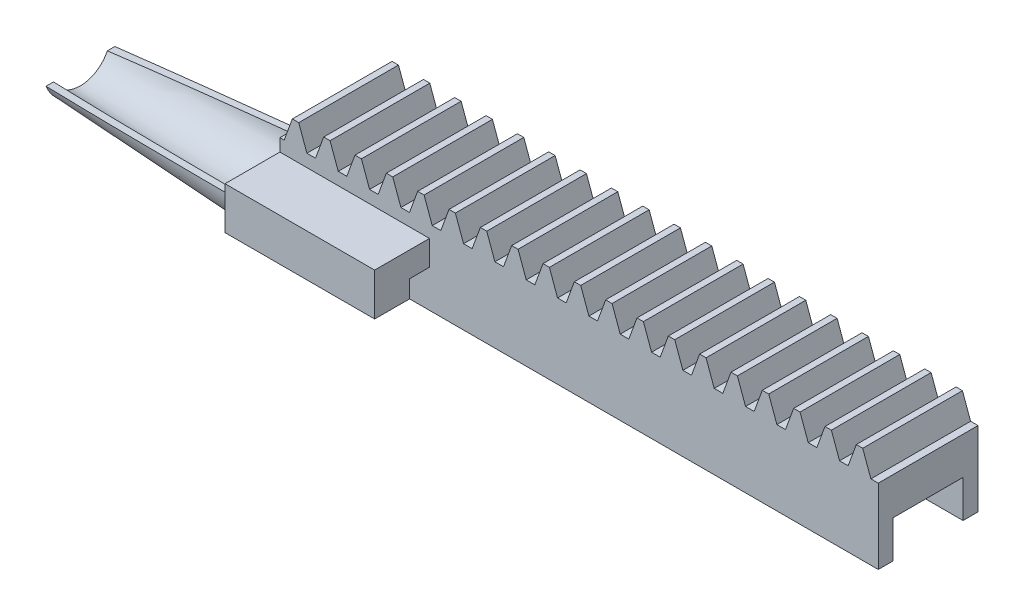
ISO-10303-21;
HEADER;
FILE_DESCRIPTION(('STEP AP214'),'2;1');
FILE_NAME('part.step','',(''),(''),'','','');
FILE_SCHEMA(('AUTOMOTIVE_DESIGN { 1 0 10303 214 1 1 1 1 }'));
ENDSEC;
DATA;
#1=APPLICATION_CONTEXT('core data for automotive mechanical design processes');
#2=APPLICATION_PROTOCOL_DEFINITION('international standard','automotive_design',2000,#1);
#3=PRODUCT_CONTEXT('',#1,'mechanical');
#4=PRODUCT('Part','Part','',(#3));
#5=PRODUCT_RELATED_PRODUCT_CATEGORY('part','',(#4));
#6=PRODUCT_DEFINITION_FORMATION('','',#4);
#7=PRODUCT_DEFINITION_CONTEXT('part definition',#1,'design');
#8=PRODUCT_DEFINITION('design','',#6,#7);
#9=PRODUCT_DEFINITION_SHAPE('','',#8);
#10=(LENGTH_UNIT() NAMED_UNIT(*) SI_UNIT(.MILLI.,.METRE.));
#11=(NAMED_UNIT(*) PLANE_ANGLE_UNIT() SI_UNIT($,.RADIAN.));
#12=(NAMED_UNIT(*) SI_UNIT($,.STERADIAN.) SOLID_ANGLE_UNIT());
#13=UNCERTAINTY_MEASURE_WITH_UNIT(LENGTH_MEASURE(1.E-05),#10,'distance_accuracy_value','');
#14=(GEOMETRIC_REPRESENTATION_CONTEXT(3) GLOBAL_UNCERTAINTY_ASSIGNED_CONTEXT((#13)) GLOBAL_UNIT_ASSIGNED_CONTEXT((#10,
#11,#12)) REPRESENTATION_CONTEXT('',''));
#15=CARTESIAN_POINT('',(0.,0.,0.));
#16=DIRECTION('',(0.,0.,1.));
#17=DIRECTION('',(1.,0.,0.));
#18=AXIS2_PLACEMENT_3D('',#15,#16,#17);
#19=CARTESIAN_POINT('',(0.,-7.5,-20.));
#20=DIRECTION('',(-0.0523359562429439,0.998629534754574,0.));
#21=DIRECTION('',(-0.998629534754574,-0.052335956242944,0.));
#22=AXIS2_PLACEMENT_3D('',#19,#20,#21);
#23=PLANE('',#22);
#24=DIRECTION('',(0.,0.,-1.));
#25=VECTOR('',#24,1.);
#26=CARTESIAN_POINT('',(0.,-7.5,-20.));
#27=LINE('',#26,#25);
#28=CARTESIAN_POINT('',(0.,-7.5,0.));
#29=VERTEX_POINT('',#28);
#30=CARTESIAN_POINT('',(0.,-7.5,-1.37961103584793));
#31=VERTEX_POINT('',#30);
#32=EDGE_CURVE('E100',#29,#31,#27,.T.);
#33=ORIENTED_EDGE('',*,*,#32,.T.);
#34=CARTESIAN_POINT('',(0.000200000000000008,-7.49998951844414,-1.37960055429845));
#35=CARTESIAN_POINT('',(-1.36137483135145,-7.57134663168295,-1.45096092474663));
#36=CARTESIAN_POINT('',(-2.72290402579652,-7.64270135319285,-1.52319838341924));
#37=CARTESIAN_POINT('',(-5.44585708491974,-7.78540527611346,-1.6695817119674));
#38=CARTESIAN_POINT('',(-6.80728094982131,-7.85675447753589,-1.74372757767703));
#39=CARTESIAN_POINT('',(-9.52997438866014,-7.99944479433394,-1.89408000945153));
#40=CARTESIAN_POINT('',(-10.8912439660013,-8.07078590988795,-1.97028651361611));
#41=CARTESIAN_POINT('',(-13.6136589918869,-8.2134616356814,-2.12494784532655));
#42=CARTESIAN_POINT('',(-14.9748044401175,-8.28479624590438,-2.20340267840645));
#43=CARTESIAN_POINT('',(-19.1430533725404,-8.50324491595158,-2.44742121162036));
#44=CARTESIAN_POINT('',(-21.9499255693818,-8.65034685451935,-2.61697234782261));
#45=CARTESIAN_POINT('',(-27.5628664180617,-8.94450861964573,-2.96880656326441));
#46=CARTESIAN_POINT('',(-30.3689350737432,-9.09156844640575,-3.15108958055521));
#47=CARTESIAN_POINT('',(-34.5773070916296,-9.31211987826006,-3.43663537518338));
#48=CARTESIAN_POINT('',(-35.980020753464,-9.38563298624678,-3.53384081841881));
#49=CARTESIAN_POINT('',(-38.7851184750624,-9.53264192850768,-3.73288747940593));
#50=CARTESIAN_POINT('',(-40.187502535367,-9.60613776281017,-3.83472868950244));
#51=CARTESIAN_POINT('',(-42.9919008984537,-9.75311005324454,-4.04377072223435));
#52=CARTESIAN_POINT('',(-44.3939151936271,-9.82658650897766,-4.15097164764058));
#53=CARTESIAN_POINT('',(-46.4965688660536,-9.93678191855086,-4.31650375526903));
#54=CARTESIAN_POINT('',(-47.1973941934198,-9.97351061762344,-4.37246974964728));
#55=CARTESIAN_POINT('',(-48.5989056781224,-10.0469607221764,-4.48613174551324));
#56=CARTESIAN_POINT('',(-49.2995918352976,-10.0836821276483,-4.54382774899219));
#57=CARTESIAN_POINT('',(-50.0002,-10.1203994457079,-4.60246528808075));
#58=B_SPLINE_CURVE_WITH_KNOTS('',3,(#34,#35,#36,#37,#38,#39,#40,#41,#42,#43,#44,#45,#46,#47,#48,
#49,#50,#51,#52,#53,#54,#55,#56,#57),.UNSPECIFIED.,.F.,.F.,(4,2,2,2,2,2,2,2,2,2,2,4),(0.,
4.09592865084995,8.1918483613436,12.287645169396,16.3834520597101,24.8309294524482,
33.2783657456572,37.5023538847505,41.7263350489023,45.9503972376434,48.0624407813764,
50.1744867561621),.UNSPECIFIED.);
#59=CARTESIAN_POINT('',(-50.,-10.1203889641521,-4.6024485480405));
#60=VERTEX_POINT('',#59);
#61=EDGE_CURVE('E60',#31,#60,#58,.T.);
#62=ORIENTED_EDGE('',*,*,#61,.T.);
#63=DIRECTION('',(0.,0.,1.));
#64=VECTOR('',#63,1.);
#65=CARTESIAN_POINT('',(-50.,-10.1203889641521,-20.));
#66=LINE('',#65,#64);
#67=CARTESIAN_POINT('',(-50.,-10.1203889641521,-3.10128847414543));
#68=VERTEX_POINT('',#67);
#69=EDGE_CURVE('E93',#68,#60,#66,.F.);
#70=ORIENTED_EDGE('',*,*,#69,.F.);
#71=CARTESIAN_POINT('',(-50.,-10.1203889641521,-3.10128847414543));
#72=CARTESIAN_POINT('',(-48.8361454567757,-10.0593939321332,-3.01288233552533));
#73=CARTESIAN_POINT('',(-47.6721654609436,-9.99839232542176,-2.92614760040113));
#74=CARTESIAN_POINT('',(-45.3439857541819,-9.87637759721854,-2.75570995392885));
#75=CARTESIAN_POINT('',(-44.1797860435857,-9.81536447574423,-2.67200703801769));
#76=CARTESIAN_POINT('',(-40.6869481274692,-9.63231259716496,-2.42498263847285));
#77=CARTESIAN_POINT('',(-38.3580218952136,-9.51025874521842,-2.26574178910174));
#78=CARTESIAN_POINT('',(-33.0279205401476,-9.23091996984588,-1.91165246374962));
#79=CARTESIAN_POINT('',(-30.0265491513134,-9.07362476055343,-1.71977726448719));
#80=CARTESIAN_POINT('',(-24.0230508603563,-8.75899474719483,-1.3481460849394));
#81=CARTESIAN_POINT('',(-21.0209239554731,-8.60165994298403,-1.16839014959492));
#82=CARTESIAN_POINT('',(-15.0159177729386,-8.28695090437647,-0.818959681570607));
#83=CARTESIAN_POINT('',(-12.0130384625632,-8.1295766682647,-0.649285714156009));
#84=CARTESIAN_POINT('',(-7.5083807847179,-7.89349756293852,-0.401204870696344));
#85=CARTESIAN_POINT('',(-6.00677793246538,-7.81480189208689,-0.319583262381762));
#86=CARTESIAN_POINT('',(-3.00346614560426,-7.65740499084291,-0.158333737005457));
#87=CARTESIAN_POINT('',(-1.50175721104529,-7.57870376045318,-0.0787058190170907));
#88=CARTESIAN_POINT('',(0.,-7.5,0.));
#89=B_SPLINE_CURVE_WITH_KNOTS('',3,(#71,#72,#73,#74,#75,#76,#77,#78,#79,#80,#81,#82,#83,#84,#85,
#86,#87,#88),.UNSPECIFIED.,.F.,.F.,(4,2,2,2,2,2,2,2,4),(0.,3.50639697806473,7.01278867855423,
14.0254237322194,23.0602194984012,32.0950487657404,41.1303841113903,45.648014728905,
50.1656432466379),.UNSPECIFIED.);
#90=EDGE_CURVE('E53',#68,#29,#89,.T.);
#91=ORIENTED_EDGE('',*,*,#90,.T.);
#92=EDGE_LOOP('',(#33,#62,#70,#91));
#93=FACE_BOUND('',#92,.T.);
#94=ADVANCED_FACE('F44',(#93),#23,.T.);
#95=CARTESIAN_POINT('',(0.,-7.5,-10.));
#96=DIRECTION('',(1.,0.,0.));
#97=DIRECTION('',(0.,0.,1.));
#98=AXIS2_PLACEMENT_3D('',#95,#96,#97);
#99=CONICAL_SURFACE('',#98,10.,0.05235987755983);
#100=CARTESIAN_POINT('',(0.,-7.5,-10.));
#101=DIRECTION('',(-1.,0.,0.));
#102=DIRECTION('',(0.,0.,1.));
#103=AXIS2_PLACEMENT_3D('',#100,#101,#102);
#104=CIRCLE('',#103,10.);
#105=CARTESIAN_POINT('',(0.,-7.5,-20.));
#106=VERTEX_POINT('',#105);
#107=EDGE_CURVE('E152',#106,#29,#104,.T.);
#108=ORIENTED_EDGE('',*,*,#107,.T.);
#109=ORIENTED_EDGE('',*,*,#90,.F.);
#110=CARTESIAN_POINT('',(-50.,-7.5,-10.));
#111=DIRECTION('',(-1.,0.,0.));
#112=DIRECTION('',(0.,0.,1.));
#113=AXIS2_PLACEMENT_3D('',#110,#111,#112);
#114=CIRCLE('',#113,7.37961103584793);
#115=CARTESIAN_POINT('',(-50.,-10.1203889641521,-16.8987115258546));
#116=VERTEX_POINT('',#115);
#117=EDGE_CURVE('E99',#116,#68,#114,.T.);
#118=ORIENTED_EDGE('',*,*,#117,.F.);
#119=CARTESIAN_POINT('',(-50.,-10.1203889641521,-16.8987115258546));
#120=CARTESIAN_POINT('',(-48.8361454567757,-10.0593939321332,-16.9871176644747));
#121=CARTESIAN_POINT('',(-47.6721654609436,-9.99839232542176,-17.0738523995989));
#122=CARTESIAN_POINT('',(-45.3439857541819,-9.87637759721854,-17.2442900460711));
#123=CARTESIAN_POINT('',(-44.1797860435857,-9.81536447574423,-17.3279929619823));
#124=CARTESIAN_POINT('',(-40.6869481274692,-9.63231259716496,-17.5750173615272));
#125=CARTESIAN_POINT('',(-38.3580218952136,-9.51025874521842,-17.7342582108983));
#126=CARTESIAN_POINT('',(-33.0279205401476,-9.23091996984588,-18.0883475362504));
#127=CARTESIAN_POINT('',(-30.0265491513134,-9.07362476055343,-18.2802227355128));
#128=CARTESIAN_POINT('',(-24.0230508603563,-8.75899474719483,-18.6518539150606));
#129=CARTESIAN_POINT('',(-21.0209239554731,-8.60165994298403,-18.8316098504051));
#130=CARTESIAN_POINT('',(-15.0159177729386,-8.28695090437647,-19.1810403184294));
#131=CARTESIAN_POINT('',(-12.0130384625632,-8.1295766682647,-19.350714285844));
#132=CARTESIAN_POINT('',(-7.5083807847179,-7.89349756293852,-19.5987951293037));
#133=CARTESIAN_POINT('',(-6.00677793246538,-7.81480189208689,-19.6804167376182));
#134=CARTESIAN_POINT('',(-3.00346614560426,-7.65740499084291,-19.8416662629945));
#135=CARTESIAN_POINT('',(-1.50175721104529,-7.57870376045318,-19.9212941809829));
#136=CARTESIAN_POINT('',(0.,-7.5,-20.));
#137=B_SPLINE_CURVE_WITH_KNOTS('',3,(#119,#120,#121,#122,#123,#124,#125,#126,#127,#128,#129,
#130,#131,#132,#133,#134,#135,#136),.UNSPECIFIED.,.F.,.F.,(4,2,2,2,2,2,2,2,4),(0.,
3.50639697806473,7.01278867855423,14.0254237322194,23.0602194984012,32.0950487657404,
41.1303841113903,45.648014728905,50.1656432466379),.UNSPECIFIED.);
#138=EDGE_CURVE('E97',#116,#106,#137,.T.);
#139=ORIENTED_EDGE('',*,*,#138,.T.);
#140=EDGE_LOOP('',(#108,#109,#118,#139));
#141=FACE_BOUND('',#140,.T.);
#142=ADVANCED_FACE('F46',(#141),#99,.T.);
#143=CARTESIAN_POINT('',(-50.,-10.1203889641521,-15.3975514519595));
#144=VERTEX_POINT('',#143);
#145=EDGE_CURVE('E67',#144,#116,#66,.F.);
#146=ORIENTED_EDGE('',*,*,#145,.F.);
#147=CARTESIAN_POINT('',(-50.0002,-10.1203994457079,-15.3975347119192));
#148=CARTESIAN_POINT('',(-49.0544927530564,-10.0708370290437,-15.4766772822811));
#149=CARTESIAN_POINT('',(-48.1086447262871,-10.0212672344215,-15.5541175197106));
#150=CARTESIAN_POINT('',(-46.2167060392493,-9.92211492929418,-15.7059408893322));
#151=CARTESIAN_POINT('',(-45.2706153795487,-9.87253241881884,-15.7803240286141));
#152=CARTESIAN_POINT('',(-43.3782556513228,-9.77335804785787,-15.9263788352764));
#153=CARTESIAN_POINT('',(-42.4319865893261,-9.72376618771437,-15.998050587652));
#154=CARTESIAN_POINT('',(-40.5392673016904,-9.6245729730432,-16.1389557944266));
#155=CARTESIAN_POINT('',(-39.5928170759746,-9.5749716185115,-16.2081892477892));
#156=CARTESIAN_POINT('',(-37.0372877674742,-9.44104200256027,-16.3921406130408));
#157=CARTESIAN_POINT('',(-35.4280592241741,-9.35670590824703,-16.5047786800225));
#158=CARTESIAN_POINT('',(-32.2092308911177,-9.18801426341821,-16.7246187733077));
#159=CARTESIAN_POINT('',(-30.599631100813,-9.10365871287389,-16.8318207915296));
#160=CARTESIAN_POINT('',(-27.3801113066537,-8.93493083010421,-17.041503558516));
#161=CARTESIAN_POINT('',(-25.7701913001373,-8.85055849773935,-17.1439842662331));
#162=CARTESIAN_POINT('',(-22.5500931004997,-8.68180030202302,-17.3447959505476));
#163=CARTESIAN_POINT('',(-20.939914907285,-8.59741443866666,-17.4431269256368));
#164=CARTESIAN_POINT('',(-17.719156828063,-8.42862166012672,-17.6361153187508));
#165=CARTESIAN_POINT('',(-16.1085769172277,-8.34421474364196,-17.7307723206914));
#166=CARTESIAN_POINT('',(-12.8872266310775,-8.17539092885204,-17.9167851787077));
#167=CARTESIAN_POINT('',(-11.2764562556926,-8.09097403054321,-18.0081410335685));
#168=CARTESIAN_POINT('',(-8.05478764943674,-7.92213353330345,-18.1878738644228));
#169=CARTESIAN_POINT('',(-6.44388942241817,-7.83770993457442,-18.276250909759));
#170=CARTESIAN_POINT('',(-3.22194862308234,-7.6688551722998,-18.4502929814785));
#171=CARTESIAN_POINT('',(-1.6109060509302,-7.58442400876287,-18.5359580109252));
#172=CARTESIAN_POINT('',(0.000199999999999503,-7.49998951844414,-18.6203994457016));
#173=B_SPLINE_CURVE_WITH_KNOTS('',3,(#147,#148,#149,#150,#151,#152,#153,#154,#155,#156,#157,
#158,#159,#160,#161,#162,#163,#164,#165,#166,#167,#168,#169,#170,#171,#172),.UNSPECIFIED.,.F.,
.F.,(4,2,2,2,2,2,2,2,2,2,2,2,4),(0.,2.85091566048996,5.70182470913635,8.55264431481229,
11.4034651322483,16.2495597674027,21.0956616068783,25.9418055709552,30.7879512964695,
35.6346442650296,40.4813390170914,45.3279208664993,50.1744972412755),.UNSPECIFIED.);
#174=CARTESIAN_POINT('',(0.,-7.5,-18.6203889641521));
#175=VERTEX_POINT('',#174);
#176=EDGE_CURVE('E85',#144,#175,#173,.T.);
#177=ORIENTED_EDGE('',*,*,#176,.T.);
#178=EDGE_CURVE('E151',#175,#106,#27,.T.);
#179=ORIENTED_EDGE('',*,*,#178,.T.);
#180=ORIENTED_EDGE('',*,*,#138,.F.);
#181=EDGE_LOOP('',(#146,#177,#179,#180));
#182=FACE_BOUND('',#181,.T.);
#183=ADVANCED_FACE('F95',(#182),#23,.T.);
#184=CARTESIAN_POINT('',(-50.,-7.5,-10.));
#185=DIRECTION('',(-1.,0.,0.));
#186=DIRECTION('',(0.,0.,1.));
#187=AXIS2_PLACEMENT_3D('',#184,#185,#186);
#188=PLANE('',#187);
#189=CARTESIAN_POINT('',(-50.,-7.5,-10.));
#190=DIRECTION('',(-1.,0.,0.));
#191=DIRECTION('',(0.,0.,1.));
#192=AXIS2_PLACEMENT_3D('',#189,#190,#191);
#193=CIRCLE('',#192,6.);
#194=EDGE_CURVE('E87',#144,#60,#193,.T.);
#195=ORIENTED_EDGE('',*,*,#194,.F.);
#196=ORIENTED_EDGE('',*,*,#145,.T.);
#197=ORIENTED_EDGE('',*,*,#117,.T.);
#198=ORIENTED_EDGE('',*,*,#69,.T.);
#199=EDGE_LOOP('',(#195,#196,#197,#198));
#200=FACE_BOUND('',#199,.T.);
#201=ADVANCED_FACE('F92',(#200),#188,.T.);
#202=CARTESIAN_POINT('',(0.,-7.5,-10.));
#203=DIRECTION('',(-1.,0.,0.));
#204=DIRECTION('',(0.,0.,1.));
#205=AXIS2_PLACEMENT_3D('',#202,#203,#204);
#206=PLANE('',#205);
#207=ORIENTED_EDGE('',*,*,#178,.F.);
#208=CARTESIAN_POINT('',(0.,-7.5,-10.));
#209=DIRECTION('',(-1.,0.,0.));
#210=DIRECTION('',(0.,0.,1.));
#211=AXIS2_PLACEMENT_3D('',#208,#209,#210);
#212=CIRCLE('',#211,8.62038896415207);
#213=EDGE_CURVE('E12',#175,#31,#212,.T.);
#214=ORIENTED_EDGE('',*,*,#213,.T.);
#215=ORIENTED_EDGE('',*,*,#32,.F.);
#216=ORIENTED_EDGE('',*,*,#107,.F.);
#217=EDGE_LOOP('',(#207,#214,#215,#216));
#218=FACE_BOUND('',#217,.T.);
#219=ADVANCED_FACE('F116',(#218),#206,.F.);
#220=CARTESIAN_POINT('',(-50.,-7.5,-10.));
#221=DIRECTION('',(1.,0.,0.));
#222=DIRECTION('',(0.,0.,1.));
#223=AXIS2_PLACEMENT_3D('',#220,#221,#222);
#224=CONICAL_SURFACE('',#223,6.,0.05235987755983);
#225=ORIENTED_EDGE('',*,*,#213,.F.);
#226=ORIENTED_EDGE('',*,*,#176,.F.);
#227=ORIENTED_EDGE('',*,*,#194,.T.);
#228=ORIENTED_EDGE('',*,*,#61,.F.);
#229=EDGE_LOOP('',(#225,#226,#227,#228));
#230=FACE_BOUND('',#229,.T.);
#231=ADVANCED_FACE('F86',(#230),#224,.F.);
#232=CLOSED_SHELL('',(#94,#142,#183,#201,#219,#231));
#233=MANIFOLD_SOLID_BREP('B2',#232);
#234=CARTESIAN_POINT('',(0.,0.,-20.));
#235=DIRECTION('',(0.,-1.,0.));
#236=DIRECTION('',(0.,0.,-1.));
#237=AXIS2_PLACEMENT_3D('',#234,#235,#236);
#238=PLANE('',#237);
#239=DIRECTION('',(0.,0.,1.));
#240=VECTOR('',#239,1.);
#241=CARTESIAN_POINT('',(120.,0.,-20.));
#242=LINE('',#241,#240);
#243=CARTESIAN_POINT('',(120.,0.,-17.));
#244=VERTEX_POINT('',#243);
#245=CARTESIAN_POINT('',(120.,0.,-3.));
#246=VERTEX_POINT('',#245);
#247=EDGE_CURVE('E1317',#244,#246,#242,.T.);
#248=ORIENTED_EDGE('',*,*,#247,.T.);
#249=DIRECTION('',(1.,0.,0.));
#250=VECTOR('',#249,1.);
#251=CARTESIAN_POINT('',(0.,0.,-3.));
#252=LINE('',#251,#250);
#253=CARTESIAN_POINT('',(0.,0.,-3.));
#254=VERTEX_POINT('',#253);
#255=EDGE_CURVE('E790',#254,#246,#252,.T.);
#256=ORIENTED_EDGE('',*,*,#255,.F.);
#257=DIRECTION('',(0.,0.,1.));
#258=VECTOR('',#257,1.);
#259=CARTESIAN_POINT('',(0.,0.,-20.));
#260=LINE('',#259,#258);
#261=CARTESIAN_POINT('',(0.,0.,-17.));
#262=VERTEX_POINT('',#261);
#263=EDGE_CURVE('E1307',#262,#254,#260,.T.);
#264=ORIENTED_EDGE('',*,*,#263,.F.);
#265=DIRECTION('',(-1.,0.,0.));
#266=VECTOR('',#265,1.);
#267=CARTESIAN_POINT('',(0.,0.,-17.));
#268=LINE('',#267,#266);
#269=EDGE_CURVE('E814',#244,#262,#268,.T.);
#270=ORIENTED_EDGE('',*,*,#269,.F.);
#271=EDGE_LOOP('',(#248,#256,#264,#270));
#272=FACE_BOUND('',#271,.T.);
#273=ADVANCED_FACE('F188',(#272),#238,.T.);
#274=CARTESIAN_POINT('',(0.,12.,-20.));
#275=DIRECTION('',(0.,1.,0.));
#276=DIRECTION('',(0.,0.,1.));
#277=AXIS2_PLACEMENT_3D('',#274,#275,#276);
#278=PLANE('',#277);
#279=DIRECTION('',(0.,0.,1.));
#280=VECTOR('',#279,1.);
#281=CARTESIAN_POINT('',(110.597598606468,12.,-20.));
#282=LINE('',#281,#280);
#283=CARTESIAN_POINT('',(110.597598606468,12.,-20.));
#284=VERTEX_POINT('',#283);
#285=CARTESIAN_POINT('',(110.597598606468,12.,0.));
#286=VERTEX_POINT('',#285);
#287=EDGE_CURVE('E870',#284,#286,#282,.T.);
#288=ORIENTED_EDGE('',*,*,#287,.F.);
#289=DIRECTION('',(-1.,0.,0.));
#290=VECTOR('',#289,1.);
#291=CARTESIAN_POINT('',(0.,12.,-20.));
#292=LINE('',#291,#290);
#293=CARTESIAN_POINT('',(109.313886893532,12.,-20.));
#294=VERTEX_POINT('',#293);
#295=EDGE_CURVE('E1308',#284,#294,#292,.T.);
#296=ORIENTED_EDGE('',*,*,#295,.T.);
#297=DIRECTION('',(0.,0.,-1.));
#298=VECTOR('',#297,1.);
#299=CARTESIAN_POINT('',(109.313886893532,12.,-20.));
#300=LINE('',#299,#298);
#301=CARTESIAN_POINT('',(109.313886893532,12.,0.));
#302=VERTEX_POINT('',#301);
#303=EDGE_CURVE('E890',#302,#294,#300,.T.);
#304=ORIENTED_EDGE('',*,*,#303,.F.);
#305=DIRECTION('',(-1.,0.,0.));
#306=VECTOR('',#305,1.);
#307=CARTESIAN_POINT('',(0.,12.,0.));
#308=LINE('',#307,#306);
#309=EDGE_CURVE('E1316',#286,#302,#308,.T.);
#310=ORIENTED_EDGE('',*,*,#309,.F.);
#311=EDGE_LOOP('',(#288,#296,#304,#310));
#312=FACE_BOUND('',#311,.T.);
#313=ADVANCED_FACE('F1386',(#312),#278,.T.);
#314=DIRECTION('',(0.,0.,1.));
#315=VECTOR('',#314,1.);
#316=CARTESIAN_POINT('',(104.314413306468,12.,-20.));
#317=LINE('',#316,#315);
#318=CARTESIAN_POINT('',(104.314413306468,12.,-20.));
#319=VERTEX_POINT('',#318);
#320=CARTESIAN_POINT('',(104.314413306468,12.,0.));
#321=VERTEX_POINT('',#320);
#322=EDGE_CURVE('E894',#319,#321,#317,.T.);
#323=ORIENTED_EDGE('',*,*,#322,.F.);
#324=CARTESIAN_POINT('',(103.030701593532,12.,-20.));
#325=VERTEX_POINT('',#324);
#326=EDGE_CURVE('E1520',#319,#325,#292,.T.);
#327=ORIENTED_EDGE('',*,*,#326,.T.);
#328=DIRECTION('',(0.,0.,-1.));
#329=VECTOR('',#328,1.);
#330=CARTESIAN_POINT('',(103.030701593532,12.,-20.));
#331=LINE('',#330,#329);
#332=CARTESIAN_POINT('',(103.030701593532,12.,0.));
#333=VERTEX_POINT('',#332);
#334=EDGE_CURVE('E914',#333,#325,#331,.T.);
#335=ORIENTED_EDGE('',*,*,#334,.F.);
#336=EDGE_CURVE('E1388',#321,#333,#308,.T.);
#337=ORIENTED_EDGE('',*,*,#336,.F.);
#338=EDGE_LOOP('',(#323,#327,#335,#337));
#339=FACE_BOUND('',#338,.T.);
#340=ADVANCED_FACE('F1539',(#339),#278,.T.);
#341=DIRECTION('',(0.,0.,1.));
#342=VECTOR('',#341,1.);
#343=CARTESIAN_POINT('',(98.0312280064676,12.,-20.));
#344=LINE('',#343,#342);
#345=CARTESIAN_POINT('',(98.0312280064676,12.,-20.));
#346=VERTEX_POINT('',#345);
#347=CARTESIAN_POINT('',(98.0312280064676,12.,0.));
#348=VERTEX_POINT('',#347);
#349=EDGE_CURVE('E918',#346,#348,#344,.T.);
#350=ORIENTED_EDGE('',*,*,#349,.F.);
#351=CARTESIAN_POINT('',(96.7475162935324,12.,-20.));
#352=VERTEX_POINT('',#351);
#353=EDGE_CURVE('E1515',#346,#352,#292,.T.);
#354=ORIENTED_EDGE('',*,*,#353,.T.);
#355=DIRECTION('',(0.,0.,-1.));
#356=VECTOR('',#355,1.);
#357=CARTESIAN_POINT('',(96.7475162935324,12.,-20.));
#358=LINE('',#357,#356);
#359=CARTESIAN_POINT('',(96.7475162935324,12.,0.));
#360=VERTEX_POINT('',#359);
#361=EDGE_CURVE('E938',#360,#352,#358,.T.);
#362=ORIENTED_EDGE('',*,*,#361,.F.);
#363=EDGE_CURVE('E1389',#348,#360,#308,.T.);
#364=ORIENTED_EDGE('',*,*,#363,.F.);
#365=EDGE_LOOP('',(#350,#354,#362,#364));
#366=FACE_BOUND('',#365,.T.);
#367=ADVANCED_FACE('F1549',(#366),#278,.T.);
#368=DIRECTION('',(0.,0.,1.));
#369=VECTOR('',#368,1.);
#370=CARTESIAN_POINT('',(91.7480427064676,12.,-20.));
#371=LINE('',#370,#369);
#372=CARTESIAN_POINT('',(91.7480427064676,12.,-20.));
#373=VERTEX_POINT('',#372);
#374=CARTESIAN_POINT('',(91.7480427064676,12.,0.));
#375=VERTEX_POINT('',#374);
#376=EDGE_CURVE('E942',#373,#375,#371,.T.);
#377=ORIENTED_EDGE('',*,*,#376,.F.);
#378=CARTESIAN_POINT('',(90.4643309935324,12.,-20.));
#379=VERTEX_POINT('',#378);
#380=EDGE_CURVE('E1510',#373,#379,#292,.T.);
#381=ORIENTED_EDGE('',*,*,#380,.T.);
#382=DIRECTION('',(0.,0.,-1.));
#383=VECTOR('',#382,1.);
#384=CARTESIAN_POINT('',(90.4643309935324,12.,-20.));
#385=LINE('',#384,#383);
#386=CARTESIAN_POINT('',(90.4643309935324,12.,0.));
#387=VERTEX_POINT('',#386);
#388=EDGE_CURVE('E962',#387,#379,#385,.T.);
#389=ORIENTED_EDGE('',*,*,#388,.F.);
#390=EDGE_CURVE('E1392',#375,#387,#308,.T.);
#391=ORIENTED_EDGE('',*,*,#390,.F.);
#392=EDGE_LOOP('',(#377,#381,#389,#391));
#393=FACE_BOUND('',#392,.T.);
#394=ADVANCED_FACE('F1559',(#393),#278,.T.);
#395=DIRECTION('',(0.,0.,1.));
#396=VECTOR('',#395,1.);
#397=CARTESIAN_POINT('',(85.4648574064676,12.,-20.));
#398=LINE('',#397,#396);
#399=CARTESIAN_POINT('',(85.4648574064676,12.,-20.));
#400=VERTEX_POINT('',#399);
#401=CARTESIAN_POINT('',(85.4648574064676,12.,0.));
#402=VERTEX_POINT('',#401);
#403=EDGE_CURVE('E966',#400,#402,#398,.T.);
#404=ORIENTED_EDGE('',*,*,#403,.F.);
#405=CARTESIAN_POINT('',(84.1811456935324,12.,-20.));
#406=VERTEX_POINT('',#405);
#407=EDGE_CURVE('E1505',#400,#406,#292,.T.);
#408=ORIENTED_EDGE('',*,*,#407,.T.);
#409=DIRECTION('',(0.,0.,-1.));
#410=VECTOR('',#409,1.);
#411=CARTESIAN_POINT('',(84.1811456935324,12.,-20.));
#412=LINE('',#411,#410);
#413=CARTESIAN_POINT('',(84.1811456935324,12.,0.));
#414=VERTEX_POINT('',#413);
#415=EDGE_CURVE('E986',#414,#406,#412,.T.);
#416=ORIENTED_EDGE('',*,*,#415,.F.);
#417=EDGE_CURVE('E1395',#402,#414,#308,.T.);
#418=ORIENTED_EDGE('',*,*,#417,.F.);
#419=EDGE_LOOP('',(#404,#408,#416,#418));
#420=FACE_BOUND('',#419,.T.);
#421=ADVANCED_FACE('F1569',(#420),#278,.T.);
#422=DIRECTION('',(0.,0.,1.));
#423=VECTOR('',#422,1.);
#424=CARTESIAN_POINT('',(79.1816721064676,12.,-20.));
#425=LINE('',#424,#423);
#426=CARTESIAN_POINT('',(79.1816721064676,12.,-20.));
#427=VERTEX_POINT('',#426);
#428=CARTESIAN_POINT('',(79.1816721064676,12.,0.));
#429=VERTEX_POINT('',#428);
#430=EDGE_CURVE('E990',#427,#429,#425,.T.);
#431=ORIENTED_EDGE('',*,*,#430,.F.);
#432=CARTESIAN_POINT('',(77.8979603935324,12.,-20.));
#433=VERTEX_POINT('',#432);
#434=EDGE_CURVE('E1500',#427,#433,#292,.T.);
#435=ORIENTED_EDGE('',*,*,#434,.T.);
#436=DIRECTION('',(0.,0.,-1.));
#437=VECTOR('',#436,1.);
#438=CARTESIAN_POINT('',(77.8979603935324,12.,-20.));
#439=LINE('',#438,#437);
#440=CARTESIAN_POINT('',(77.8979603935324,12.,0.));
#441=VERTEX_POINT('',#440);
#442=EDGE_CURVE('E1010',#441,#433,#439,.T.);
#443=ORIENTED_EDGE('',*,*,#442,.F.);
#444=EDGE_CURVE('E1398',#429,#441,#308,.T.);
#445=ORIENTED_EDGE('',*,*,#444,.F.);
#446=EDGE_LOOP('',(#431,#435,#443,#445));
#447=FACE_BOUND('',#446,.T.);
#448=ADVANCED_FACE('F1579',(#447),#278,.T.);
#449=DIRECTION('',(0.,0.,1.));
#450=VECTOR('',#449,1.);
#451=CARTESIAN_POINT('',(72.8984868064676,12.,-20.));
#452=LINE('',#451,#450);
#453=CARTESIAN_POINT('',(72.8984868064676,12.,-20.));
#454=VERTEX_POINT('',#453);
#455=CARTESIAN_POINT('',(72.8984868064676,12.,0.));
#456=VERTEX_POINT('',#455);
#457=EDGE_CURVE('E1014',#454,#456,#452,.T.);
#458=ORIENTED_EDGE('',*,*,#457,.F.);
#459=CARTESIAN_POINT('',(71.6147750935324,12.,-20.));
#460=VERTEX_POINT('',#459);
#461=EDGE_CURVE('E1495',#454,#460,#292,.T.);
#462=ORIENTED_EDGE('',*,*,#461,.T.);
#463=DIRECTION('',(0.,0.,-1.));
#464=VECTOR('',#463,1.);
#465=CARTESIAN_POINT('',(71.6147750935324,12.,-20.));
#466=LINE('',#465,#464);
#467=CARTESIAN_POINT('',(71.6147750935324,12.,0.));
#468=VERTEX_POINT('',#467);
#469=EDGE_CURVE('E1034',#468,#460,#466,.T.);
#470=ORIENTED_EDGE('',*,*,#469,.F.);
#471=EDGE_CURVE('E1401',#456,#468,#308,.T.);
#472=ORIENTED_EDGE('',*,*,#471,.F.);
#473=EDGE_LOOP('',(#458,#462,#470,#472));
#474=FACE_BOUND('',#473,.T.);
#475=ADVANCED_FACE('F1589',(#474),#278,.T.);
#476=DIRECTION('',(0.,0.,1.));
#477=VECTOR('',#476,1.);
#478=CARTESIAN_POINT('',(66.6153015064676,12.,-20.));
#479=LINE('',#478,#477);
#480=CARTESIAN_POINT('',(66.6153015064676,12.,-20.));
#481=VERTEX_POINT('',#480);
#482=CARTESIAN_POINT('',(66.6153015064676,12.,0.));
#483=VERTEX_POINT('',#482);
#484=EDGE_CURVE('E1038',#481,#483,#479,.T.);
#485=ORIENTED_EDGE('',*,*,#484,.F.);
#486=CARTESIAN_POINT('',(65.3315897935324,12.,-20.));
#487=VERTEX_POINT('',#486);
#488=EDGE_CURVE('E1490',#481,#487,#292,.T.);
#489=ORIENTED_EDGE('',*,*,#488,.T.);
#490=DIRECTION('',(0.,0.,-1.));
#491=VECTOR('',#490,1.);
#492=CARTESIAN_POINT('',(65.3315897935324,12.,-20.));
#493=LINE('',#492,#491);
#494=CARTESIAN_POINT('',(65.3315897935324,12.,0.));
#495=VERTEX_POINT('',#494);
#496=EDGE_CURVE('E1058',#495,#487,#493,.T.);
#497=ORIENTED_EDGE('',*,*,#496,.F.);
#498=EDGE_CURVE('E1404',#483,#495,#308,.T.);
#499=ORIENTED_EDGE('',*,*,#498,.F.);
#500=EDGE_LOOP('',(#485,#489,#497,#499));
#501=FACE_BOUND('',#500,.T.);
#502=ADVANCED_FACE('F1599',(#501),#278,.T.);
#503=DIRECTION('',(0.,0.,1.));
#504=VECTOR('',#503,1.);
#505=CARTESIAN_POINT('',(60.3321162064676,12.,-20.));
#506=LINE('',#505,#504);
#507=CARTESIAN_POINT('',(60.3321162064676,12.,-20.));
#508=VERTEX_POINT('',#507);
#509=CARTESIAN_POINT('',(60.3321162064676,12.,0.));
#510=VERTEX_POINT('',#509);
#511=EDGE_CURVE('E1062',#508,#510,#506,.T.);
#512=ORIENTED_EDGE('',*,*,#511,.F.);
#513=CARTESIAN_POINT('',(59.0484044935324,12.,-20.));
#514=VERTEX_POINT('',#513);
#515=EDGE_CURVE('E1485',#508,#514,#292,.T.);
#516=ORIENTED_EDGE('',*,*,#515,.T.);
#517=DIRECTION('',(0.,0.,-1.));
#518=VECTOR('',#517,1.);
#519=CARTESIAN_POINT('',(59.0484044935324,12.,-20.));
#520=LINE('',#519,#518);
#521=CARTESIAN_POINT('',(59.0484044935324,12.,0.));
#522=VERTEX_POINT('',#521);
#523=EDGE_CURVE('E1082',#522,#514,#520,.T.);
#524=ORIENTED_EDGE('',*,*,#523,.F.);
#525=EDGE_CURVE('E1407',#510,#522,#308,.T.);
#526=ORIENTED_EDGE('',*,*,#525,.F.);
#527=EDGE_LOOP('',(#512,#516,#524,#526));
#528=FACE_BOUND('',#527,.T.);
#529=ADVANCED_FACE('F1609',(#528),#278,.T.);
#530=DIRECTION('',(0.,0.,1.));
#531=VECTOR('',#530,1.);
#532=CARTESIAN_POINT('',(54.0489309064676,12.,-20.));
#533=LINE('',#532,#531);
#534=CARTESIAN_POINT('',(54.0489309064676,12.,-20.));
#535=VERTEX_POINT('',#534);
#536=CARTESIAN_POINT('',(54.0489309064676,12.,0.));
#537=VERTEX_POINT('',#536);
#538=EDGE_CURVE('E1086',#535,#537,#533,.T.);
#539=ORIENTED_EDGE('',*,*,#538,.F.);
#540=CARTESIAN_POINT('',(52.7652191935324,12.,-20.));
#541=VERTEX_POINT('',#540);
#542=EDGE_CURVE('E1480',#535,#541,#292,.T.);
#543=ORIENTED_EDGE('',*,*,#542,.T.);
#544=DIRECTION('',(0.,0.,-1.));
#545=VECTOR('',#544,1.);
#546=CARTESIAN_POINT('',(52.7652191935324,12.,-20.));
#547=LINE('',#546,#545);
#548=CARTESIAN_POINT('',(52.7652191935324,12.,0.));
#549=VERTEX_POINT('',#548);
#550=EDGE_CURVE('E1106',#549,#541,#547,.T.);
#551=ORIENTED_EDGE('',*,*,#550,.F.);
#552=EDGE_CURVE('E1410',#537,#549,#308,.T.);
#553=ORIENTED_EDGE('',*,*,#552,.F.);
#554=EDGE_LOOP('',(#539,#543,#551,#553));
#555=FACE_BOUND('',#554,.T.);
#556=ADVANCED_FACE('F1619',(#555),#278,.T.);
#557=DIRECTION('',(0.,0.,1.));
#558=VECTOR('',#557,1.);
#559=CARTESIAN_POINT('',(47.7657456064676,12.,-20.));
#560=LINE('',#559,#558);
#561=CARTESIAN_POINT('',(47.7657456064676,12.,-20.));
#562=VERTEX_POINT('',#561);
#563=CARTESIAN_POINT('',(47.7657456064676,12.,0.));
#564=VERTEX_POINT('',#563);
#565=EDGE_CURVE('E1110',#562,#564,#560,.T.);
#566=ORIENTED_EDGE('',*,*,#565,.F.);
#567=CARTESIAN_POINT('',(46.4820338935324,12.,-20.));
#568=VERTEX_POINT('',#567);
#569=EDGE_CURVE('E1475',#562,#568,#292,.T.);
#570=ORIENTED_EDGE('',*,*,#569,.T.);
#571=DIRECTION('',(0.,0.,-1.));
#572=VECTOR('',#571,1.);
#573=CARTESIAN_POINT('',(46.4820338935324,12.,-20.));
#574=LINE('',#573,#572);
#575=CARTESIAN_POINT('',(46.4820338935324,12.,0.));
#576=VERTEX_POINT('',#575);
#577=EDGE_CURVE('E1130',#576,#568,#574,.T.);
#578=ORIENTED_EDGE('',*,*,#577,.F.);
#579=EDGE_CURVE('E1413',#564,#576,#308,.T.);
#580=ORIENTED_EDGE('',*,*,#579,.F.);
#581=EDGE_LOOP('',(#566,#570,#578,#580));
#582=FACE_BOUND('',#581,.T.);
#583=ADVANCED_FACE('F1629',(#582),#278,.T.);
#584=DIRECTION('',(0.,0.,1.));
#585=VECTOR('',#584,1.);
#586=CARTESIAN_POINT('',(41.4825603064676,12.,-20.));
#587=LINE('',#586,#585);
#588=CARTESIAN_POINT('',(41.4825603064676,12.,-20.));
#589=VERTEX_POINT('',#588);
#590=CARTESIAN_POINT('',(41.4825603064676,12.,0.));
#591=VERTEX_POINT('',#590);
#592=EDGE_CURVE('E1134',#589,#591,#587,.T.);
#593=ORIENTED_EDGE('',*,*,#592,.F.);
#594=CARTESIAN_POINT('',(40.1988485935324,12.,-20.));
#595=VERTEX_POINT('',#594);
#596=EDGE_CURVE('E1470',#589,#595,#292,.T.);
#597=ORIENTED_EDGE('',*,*,#596,.T.);
#598=DIRECTION('',(0.,0.,-1.));
#599=VECTOR('',#598,1.);
#600=CARTESIAN_POINT('',(40.1988485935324,12.,-20.));
#601=LINE('',#600,#599);
#602=CARTESIAN_POINT('',(40.1988485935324,12.,0.));
#603=VERTEX_POINT('',#602);
#604=EDGE_CURVE('E1154',#603,#595,#601,.T.);
#605=ORIENTED_EDGE('',*,*,#604,.F.);
#606=EDGE_CURVE('E1416',#591,#603,#308,.T.);
#607=ORIENTED_EDGE('',*,*,#606,.F.);
#608=EDGE_LOOP('',(#593,#597,#605,#607));
#609=FACE_BOUND('',#608,.T.);
#610=ADVANCED_FACE('F1639',(#609),#278,.T.);
#611=DIRECTION('',(0.,0.,1.));
#612=VECTOR('',#611,1.);
#613=CARTESIAN_POINT('',(35.1993750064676,12.,-20.));
#614=LINE('',#613,#612);
#615=CARTESIAN_POINT('',(35.1993750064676,12.,-20.));
#616=VERTEX_POINT('',#615);
#617=CARTESIAN_POINT('',(35.1993750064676,12.,0.));
#618=VERTEX_POINT('',#617);
#619=EDGE_CURVE('E1158',#616,#618,#614,.T.);
#620=ORIENTED_EDGE('',*,*,#619,.F.);
#621=CARTESIAN_POINT('',(33.9156632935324,12.,-20.));
#622=VERTEX_POINT('',#621);
#623=EDGE_CURVE('E1465',#616,#622,#292,.T.);
#624=ORIENTED_EDGE('',*,*,#623,.T.);
#625=DIRECTION('',(0.,0.,-1.));
#626=VECTOR('',#625,1.);
#627=CARTESIAN_POINT('',(33.9156632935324,12.,-20.));
#628=LINE('',#627,#626);
#629=CARTESIAN_POINT('',(33.9156632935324,12.,0.));
#630=VERTEX_POINT('',#629);
#631=EDGE_CURVE('E1178',#630,#622,#628,.T.);
#632=ORIENTED_EDGE('',*,*,#631,.F.);
#633=EDGE_CURVE('E1419',#618,#630,#308,.T.);
#634=ORIENTED_EDGE('',*,*,#633,.F.);
#635=EDGE_LOOP('',(#620,#624,#632,#634));
#636=FACE_BOUND('',#635,.T.);
#637=ADVANCED_FACE('F1649',(#636),#278,.T.);
#638=DIRECTION('',(0.,0.,1.));
#639=VECTOR('',#638,1.);
#640=CARTESIAN_POINT('',(28.9161897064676,12.,-20.));
#641=LINE('',#640,#639);
#642=CARTESIAN_POINT('',(28.9161897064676,12.,-20.));
#643=VERTEX_POINT('',#642);
#644=CARTESIAN_POINT('',(28.9161897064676,12.,0.));
#645=VERTEX_POINT('',#644);
#646=EDGE_CURVE('E1182',#643,#645,#641,.T.);
#647=ORIENTED_EDGE('',*,*,#646,.F.);
#648=CARTESIAN_POINT('',(27.6324779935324,12.,-20.));
#649=VERTEX_POINT('',#648);
#650=EDGE_CURVE('E1460',#643,#649,#292,.T.);
#651=ORIENTED_EDGE('',*,*,#650,.T.);
#652=DIRECTION('',(0.,0.,-1.));
#653=VECTOR('',#652,1.);
#654=CARTESIAN_POINT('',(27.6324779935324,12.,-20.));
#655=LINE('',#654,#653);
#656=CARTESIAN_POINT('',(27.6324779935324,12.,0.));
#657=VERTEX_POINT('',#656);
#658=EDGE_CURVE('E1202',#657,#649,#655,.T.);
#659=ORIENTED_EDGE('',*,*,#658,.F.);
#660=EDGE_CURVE('E1422',#645,#657,#308,.T.);
#661=ORIENTED_EDGE('',*,*,#660,.F.);
#662=EDGE_LOOP('',(#647,#651,#659,#661));
#663=FACE_BOUND('',#662,.T.);
#664=ADVANCED_FACE('F1659',(#663),#278,.T.);
#665=DIRECTION('',(0.,0.,1.));
#666=VECTOR('',#665,1.);
#667=CARTESIAN_POINT('',(22.6330044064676,12.,-20.));
#668=LINE('',#667,#666);
#669=CARTESIAN_POINT('',(22.6330044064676,12.,-20.));
#670=VERTEX_POINT('',#669);
#671=CARTESIAN_POINT('',(22.6330044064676,12.,0.));
#672=VERTEX_POINT('',#671);
#673=EDGE_CURVE('E1206',#670,#672,#668,.T.);
#674=ORIENTED_EDGE('',*,*,#673,.F.);
#675=CARTESIAN_POINT('',(21.3492926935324,12.,-20.));
#676=VERTEX_POINT('',#675);
#677=EDGE_CURVE('E1455',#670,#676,#292,.T.);
#678=ORIENTED_EDGE('',*,*,#677,.T.);
#679=DIRECTION('',(0.,0.,-1.));
#680=VECTOR('',#679,1.);
#681=CARTESIAN_POINT('',(21.3492926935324,12.,-20.));
#682=LINE('',#681,#680);
#683=CARTESIAN_POINT('',(21.3492926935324,12.,0.));
#684=VERTEX_POINT('',#683);
#685=EDGE_CURVE('E1226',#684,#676,#682,.T.);
#686=ORIENTED_EDGE('',*,*,#685,.F.);
#687=EDGE_CURVE('E1425',#672,#684,#308,.T.);
#688=ORIENTED_EDGE('',*,*,#687,.F.);
#689=EDGE_LOOP('',(#674,#678,#686,#688));
#690=FACE_BOUND('',#689,.T.);
#691=ADVANCED_FACE('F1669',(#690),#278,.T.);
#692=DIRECTION('',(0.,0.,1.));
#693=VECTOR('',#692,1.);
#694=CARTESIAN_POINT('',(16.3498191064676,12.,-20.));
#695=LINE('',#694,#693);
#696=CARTESIAN_POINT('',(16.3498191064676,12.,-20.));
#697=VERTEX_POINT('',#696);
#698=CARTESIAN_POINT('',(16.3498191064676,12.,0.));
#699=VERTEX_POINT('',#698);
#700=EDGE_CURVE('E1230',#697,#699,#695,.T.);
#701=ORIENTED_EDGE('',*,*,#700,.F.);
#702=CARTESIAN_POINT('',(15.0661073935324,12.,-20.));
#703=VERTEX_POINT('',#702);
#704=EDGE_CURVE('E1450',#697,#703,#292,.T.);
#705=ORIENTED_EDGE('',*,*,#704,.T.);
#706=DIRECTION('',(0.,0.,-1.));
#707=VECTOR('',#706,1.);
#708=CARTESIAN_POINT('',(15.0661073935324,12.,-20.));
#709=LINE('',#708,#707);
#710=CARTESIAN_POINT('',(15.0661073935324,12.,0.));
#711=VERTEX_POINT('',#710);
#712=EDGE_CURVE('E1250',#711,#703,#709,.T.);
#713=ORIENTED_EDGE('',*,*,#712,.F.);
#714=EDGE_CURVE('E1428',#699,#711,#308,.T.);
#715=ORIENTED_EDGE('',*,*,#714,.F.);
#716=EDGE_LOOP('',(#701,#705,#713,#715));
#717=FACE_BOUND('',#716,.T.);
#718=ADVANCED_FACE('F1679',(#717),#278,.T.);
#719=DIRECTION('',(0.,0.,1.));
#720=VECTOR('',#719,1.);
#721=CARTESIAN_POINT('',(10.0666338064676,12.,-20.));
#722=LINE('',#721,#720);
#723=CARTESIAN_POINT('',(10.0666338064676,12.,-20.));
#724=VERTEX_POINT('',#723);
#725=CARTESIAN_POINT('',(10.0666338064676,12.,0.));
#726=VERTEX_POINT('',#725);
#727=EDGE_CURVE('E1254',#724,#726,#722,.T.);
#728=ORIENTED_EDGE('',*,*,#727,.F.);
#729=CARTESIAN_POINT('',(8.78292209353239,12.,-20.));
#730=VERTEX_POINT('',#729);
#731=EDGE_CURVE('E1449',#724,#730,#292,.T.);
#732=ORIENTED_EDGE('',*,*,#731,.T.);
#733=DIRECTION('',(0.,0.,-1.));
#734=VECTOR('',#733,1.);
#735=CARTESIAN_POINT('',(8.78292209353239,12.,-20.));
#736=LINE('',#735,#734);
#737=CARTESIAN_POINT('',(8.78292209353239,12.,0.));
#738=VERTEX_POINT('',#737);
#739=EDGE_CURVE('E1274',#738,#730,#736,.T.);
#740=ORIENTED_EDGE('',*,*,#739,.F.);
#741=EDGE_CURVE('E1431',#726,#738,#308,.T.);
#742=ORIENTED_EDGE('',*,*,#741,.F.);
#743=EDGE_LOOP('',(#728,#732,#740,#742));
#744=FACE_BOUND('',#743,.T.);
#745=ADVANCED_FACE('F1689',(#744),#278,.T.);
#746=DIRECTION('',(0.,0.,1.));
#747=VECTOR('',#746,1.);
#748=CARTESIAN_POINT('',(3.78344850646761,12.,-20.));
#749=LINE('',#748,#747);
#750=CARTESIAN_POINT('',(3.78344850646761,12.,-20.));
#751=VERTEX_POINT('',#750);
#752=CARTESIAN_POINT('',(3.78344850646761,12.,0.));
#753=VERTEX_POINT('',#752);
#754=EDGE_CURVE('E1278',#751,#753,#749,.T.);
#755=ORIENTED_EDGE('',*,*,#754,.F.);
#756=CARTESIAN_POINT('',(2.49973679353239,12.,-20.));
#757=VERTEX_POINT('',#756);
#758=EDGE_CURVE('E1304',#751,#757,#292,.T.);
#759=ORIENTED_EDGE('',*,*,#758,.T.);
#760=DIRECTION('',(0.,0.,-1.));
#761=VECTOR('',#760,1.);
#762=CARTESIAN_POINT('',(2.49973679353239,12.,-20.));
#763=LINE('',#762,#761);
#764=CARTESIAN_POINT('',(2.49973679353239,12.,0.));
#765=VERTEX_POINT('',#764);
#766=EDGE_CURVE('E1294',#765,#757,#763,.T.);
#767=ORIENTED_EDGE('',*,*,#766,.F.);
#768=EDGE_CURVE('E1314',#753,#765,#308,.T.);
#769=ORIENTED_EDGE('',*,*,#768,.F.);
#770=EDGE_LOOP('',(#755,#759,#767,#769));
#771=FACE_BOUND('',#770,.T.);
#772=ADVANCED_FACE('F1446',(#771),#278,.T.);
#773=CARTESIAN_POINT('',(0.,0.,-20.));
#774=DIRECTION('',(-1.,0.,0.));
#775=DIRECTION('',(0.,0.,1.));
#776=AXIS2_PLACEMENT_3D('',#773,#774,#775);
#777=PLANE('',#776);
#778=DIRECTION('',(0.,0.,1.));
#779=VECTOR('',#778,1.);
#780=CARTESIAN_POINT('',(0.,7.5,-20.));
#781=LINE('',#780,#779);
#782=CARTESIAN_POINT('',(0.,7.5,-20.));
#783=VERTEX_POINT('',#782);
#784=CARTESIAN_POINT('',(0.,7.5,0.));
#785=VERTEX_POINT('',#784);
#786=EDGE_CURVE('E1292',#783,#785,#781,.T.);
#787=ORIENTED_EDGE('',*,*,#786,.F.);
#788=DIRECTION('',(0.,-1.,0.));
#789=VECTOR('',#788,1.);
#790=CARTESIAN_POINT('',(0.,0.,-20.));
#791=LINE('',#790,#789);
#792=CARTESIAN_POINT('',(0.,-7.5,-20.));
#793=VERTEX_POINT('',#792);
#794=EDGE_CURVE('E1298',#783,#793,#791,.T.);
#795=ORIENTED_EDGE('',*,*,#794,.T.);
#796=DIRECTION('',(0.,0.,-1.));
#797=VECTOR('',#796,1.);
#798=CARTESIAN_POINT('',(0.,-7.5,-20.));
#799=LINE('',#798,#797);
#800=CARTESIAN_POINT('',(0.,-7.5,-17.));
#801=VERTEX_POINT('',#800);
#802=EDGE_CURVE('E820',#801,#793,#799,.T.);
#803=ORIENTED_EDGE('',*,*,#802,.F.);
#804=DIRECTION('',(0.,1.,0.));
#805=VECTOR('',#804,1.);
#806=CARTESIAN_POINT('',(0.,-7.5,-17.));
#807=LINE('',#806,#805);
#808=EDGE_CURVE('E826',#801,#262,#807,.T.);
#809=ORIENTED_EDGE('',*,*,#808,.T.);
#810=ORIENTED_EDGE('',*,*,#263,.T.);
#811=DIRECTION('',(0.,1.,0.));
#812=VECTOR('',#811,1.);
#813=CARTESIAN_POINT('',(0.,-7.5,-3.));
#814=LINE('',#813,#812);
#815=CARTESIAN_POINT('',(0.,-7.5,-3.));
#816=VERTEX_POINT('',#815);
#817=EDGE_CURVE('E812',#816,#254,#814,.T.);
#818=ORIENTED_EDGE('',*,*,#817,.F.);
#819=DIRECTION('',(0.,0.,-1.));
#820=VECTOR('',#819,1.);
#821=CARTESIAN_POINT('',(0.,-7.5,0.));
#822=LINE('',#821,#820);
#823=CARTESIAN_POINT('',(0.,-7.5,0.));
#824=VERTEX_POINT('',#823);
#825=EDGE_CURVE('E797',#824,#816,#822,.T.);
#826=ORIENTED_EDGE('',*,*,#825,.F.);
#827=DIRECTION('',(0.,-1.,0.));
#828=VECTOR('',#827,1.);
#829=CARTESIAN_POINT('',(0.,0.,0.));
#830=LINE('',#829,#828);
#831=CARTESIAN_POINT('',(0.,0.,0.));
#832=VERTEX_POINT('',#831);
#833=EDGE_CURVE('E1297',#832,#824,#830,.T.);
#834=ORIENTED_EDGE('',*,*,#833,.F.);
#835=DIRECTION('',(0.,-0.00480941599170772,0.999988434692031));
#836=VECTOR('',#835,1.);
#837=CARTESIAN_POINT('',(0.,-0.0192378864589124,4.));
#838=LINE('',#837,#836);
#839=CARTESIAN_POINT('',(0.,-0.0192378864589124,4.));
#840=VERTEX_POINT('',#839);
#841=EDGE_CURVE('E781',#832,#840,#838,.T.);
#842=ORIENTED_EDGE('',*,*,#841,.T.);
#843=DIRECTION('',(0.,-1.,0.));
#844=VECTOR('',#843,1.);
#845=CARTESIAN_POINT('',(0.,-3.51923788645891,4.));
#846=LINE('',#845,#844);
#847=CARTESIAN_POINT('',(0.,-3.51923788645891,4.));
#848=VERTEX_POINT('',#847);
#849=EDGE_CURVE('E750',#840,#848,#846,.T.);
#850=ORIENTED_EDGE('',*,*,#849,.T.);
#851=DIRECTION('',(0.,0.00274825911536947,0.999996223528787));
#852=VECTOR('',#851,1.);
#853=CARTESIAN_POINT('',(0.,-3.5,11.));
#854=LINE('',#853,#852);
#855=CARTESIAN_POINT('',(0.,-3.5,11.));
#856=VERTEX_POINT('',#855);
#857=EDGE_CURVE('E784',#848,#856,#854,.T.);
#858=ORIENTED_EDGE('',*,*,#857,.T.);
#859=DIRECTION('',(0.,1.,0.));
#860=VECTOR('',#859,1.);
#861=CARTESIAN_POINT('',(0.,5.,11.));
#862=LINE('',#861,#860);
#863=CARTESIAN_POINT('',(0.,5.,11.));
#864=VERTEX_POINT('',#863);
#865=EDGE_CURVE('E771',#856,#864,#862,.T.);
#866=ORIENTED_EDGE('',*,*,#865,.T.);
#867=DIRECTION('',(0.,0.,-1.));
#868=VECTOR('',#867,1.);
#869=CARTESIAN_POINT('',(0.,5.,0.));
#870=LINE('',#869,#868);
#871=CARTESIAN_POINT('',(0.,5.,0.));
#872=VERTEX_POINT('',#871);
#873=EDGE_CURVE('E768',#864,#872,#870,.T.);
#874=ORIENTED_EDGE('',*,*,#873,.T.);
#875=EDGE_CURVE('E1309',#785,#872,#830,.T.);
#876=ORIENTED_EDGE('',*,*,#875,.F.);
#877=EDGE_LOOP('',(#787,#795,#803,#809,#810,#818,#826,#834,#842,#850,#858,#866,#874,#876));
#878=FACE_BOUND('',#877,.T.);
#879=ADVANCED_FACE('F190',(#878),#777,.T.);
#880=DIRECTION('',(0.,0.,1.));
#881=VECTOR('',#880,1.);
#882=CARTESIAN_POINT('',(116.880783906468,12.,-20.));
#883=LINE('',#882,#881);
#884=CARTESIAN_POINT('',(116.880783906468,12.,-20.));
#885=VERTEX_POINT('',#884);
#886=CARTESIAN_POINT('',(116.880783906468,12.,0.));
#887=VERTEX_POINT('',#886);
#888=EDGE_CURVE('E846',#885,#887,#883,.T.);
#889=ORIENTED_EDGE('',*,*,#888,.F.);
#890=CARTESIAN_POINT('',(115.597072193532,12.,-20.));
#891=VERTEX_POINT('',#890);
#892=EDGE_CURVE('E1305',#885,#891,#292,.T.);
#893=ORIENTED_EDGE('',*,*,#892,.T.);
#894=DIRECTION('',(0.,0.,-1.));
#895=VECTOR('',#894,1.);
#896=CARTESIAN_POINT('',(115.597072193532,12.,-20.));
#897=LINE('',#896,#895);
#898=CARTESIAN_POINT('',(115.597072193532,12.,0.));
#899=VERTEX_POINT('',#898);
#900=EDGE_CURVE('E866',#899,#891,#897,.T.);
#901=ORIENTED_EDGE('',*,*,#900,.F.);
#902=EDGE_CURVE('E1301',#887,#899,#308,.T.);
#903=ORIENTED_EDGE('',*,*,#902,.F.);
#904=EDGE_LOOP('',(#889,#893,#901,#903));
#905=FACE_BOUND('',#904,.T.);
#906=ADVANCED_FACE('F1716',(#905),#278,.T.);
#907=CARTESIAN_POINT('',(120.,0.,-20.));
#908=DIRECTION('',(1.,0.,0.));
#909=DIRECTION('',(0.,0.,-1.));
#910=AXIS2_PLACEMENT_3D('',#907,#908,#909);
#911=PLANE('',#910);
#912=DIRECTION('',(0.,0.,-1.));
#913=VECTOR('',#912,1.);
#914=CARTESIAN_POINT('',(120.,7.5,-20.));
#915=LINE('',#914,#913);
#916=CARTESIAN_POINT('',(120.,7.5,0.));
#917=VERTEX_POINT('',#916);
#918=CARTESIAN_POINT('',(120.,7.5,-20.));
#919=VERTEX_POINT('',#918);
#920=EDGE_CURVE('E844',#917,#919,#915,.T.);
#921=ORIENTED_EDGE('',*,*,#920,.F.);
#922=DIRECTION('',(0.,1.,0.));
#923=VECTOR('',#922,1.);
#924=CARTESIAN_POINT('',(120.,0.,0.));
#925=LINE('',#924,#923);
#926=CARTESIAN_POINT('',(120.,-7.5,0.));
#927=VERTEX_POINT('',#926);
#928=EDGE_CURVE('E1311',#927,#917,#925,.T.);
#929=ORIENTED_EDGE('',*,*,#928,.F.);
#930=DIRECTION('',(0.,0.,1.));
#931=VECTOR('',#930,1.);
#932=CARTESIAN_POINT('',(120.,-7.5,-3.));
#933=LINE('',#932,#931);
#934=CARTESIAN_POINT('',(120.,-7.5,-3.));
#935=VERTEX_POINT('',#934);
#936=EDGE_CURVE('E802',#935,#927,#933,.T.);
#937=ORIENTED_EDGE('',*,*,#936,.F.);
#938=DIRECTION('',(0.,1.,0.));
#939=VECTOR('',#938,1.);
#940=CARTESIAN_POINT('',(120.,-7.5,-3.));
#941=LINE('',#940,#939);
#942=EDGE_CURVE('E808',#935,#246,#941,.T.);
#943=ORIENTED_EDGE('',*,*,#942,.T.);
#944=ORIENTED_EDGE('',*,*,#247,.F.);
#945=DIRECTION('',(0.,1.,0.));
#946=VECTOR('',#945,1.);
#947=CARTESIAN_POINT('',(120.,-7.5,-17.));
#948=LINE('',#947,#946);
#949=CARTESIAN_POINT('',(120.,-7.5,-17.));
#950=VERTEX_POINT('',#949);
#951=EDGE_CURVE('E831',#950,#244,#948,.T.);
#952=ORIENTED_EDGE('',*,*,#951,.F.);
#953=DIRECTION('',(0.,0.,1.));
#954=VECTOR('',#953,1.);
#955=CARTESIAN_POINT('',(120.,-7.5,-17.));
#956=LINE('',#955,#954);
#957=CARTESIAN_POINT('',(120.,-7.5,-20.));
#958=VERTEX_POINT('',#957);
#959=EDGE_CURVE('E815',#958,#950,#956,.T.);
#960=ORIENTED_EDGE('',*,*,#959,.F.);
#961=DIRECTION('',(0.,1.,0.));
#962=VECTOR('',#961,1.);
#963=CARTESIAN_POINT('',(120.,0.,-20.));
#964=LINE('',#963,#962);
#965=EDGE_CURVE('E1300',#958,#919,#964,.T.);
#966=ORIENTED_EDGE('',*,*,#965,.T.);
#967=EDGE_LOOP('',(#921,#929,#937,#943,#944,#952,#960,#966));
#968=FACE_BOUND('',#967,.T.);
#969=ADVANCED_FACE('F1718',(#968),#911,.T.);
#970=CARTESIAN_POINT('',(0.,12.,-20.));
#971=DIRECTION('',(0.,0.,-1.));
#972=DIRECTION('',(-1.,0.,0.));
#973=AXIS2_PLACEMENT_3D('',#970,#971,#972);
#974=PLANE('',#973);
#975=DIRECTION('',(0.342020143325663,-0.939692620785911,0.));
#976=VECTOR('',#975,1.);
#977=CARTESIAN_POINT('',(116.871539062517,12.0254,-20.));
#978=LINE('',#977,#976);
#979=CARTESIAN_POINT('',(118.518649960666,7.5,-20.));
#980=VERTEX_POINT('',#979);
#981=EDGE_CURVE('E835',#885,#980,#978,.T.);
#982=ORIENTED_EDGE('',*,*,#981,.T.);
#983=DIRECTION('',(1.,0.,0.));
#984=VECTOR('',#983,1.);
#985=CARTESIAN_POINT('',(120.242391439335,7.5,-20.));
#986=LINE('',#985,#984);
#987=EDGE_CURVE('E838',#980,#919,#986,.T.);
#988=ORIENTED_EDGE('',*,*,#987,.T.);
#989=ORIENTED_EDGE('',*,*,#965,.F.);
#990=DIRECTION('',(1.,0.,0.));
#991=VECTOR('',#990,1.);
#992=CARTESIAN_POINT('',(120.,-7.5,-20.));
#993=LINE('',#992,#991);
#994=EDGE_CURVE('E823',#793,#958,#993,.T.);
#995=ORIENTED_EDGE('',*,*,#994,.F.);
#996=ORIENTED_EDGE('',*,*,#794,.F.);
#997=DIRECTION('',(1.,0.,0.));
#998=VECTOR('',#997,1.);
#999=CARTESIAN_POINT('',(0.86187073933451,7.5,-20.));
#1000=LINE('',#999,#998);
#1001=CARTESIAN_POINT('',(0.86187073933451,7.5,-20.));
#1002=VERTEX_POINT('',#1001);
#1003=EDGE_CURVE('E1281',#783,#1002,#1000,.T.);
#1004=ORIENTED_EDGE('',*,*,#1003,.T.);
#1005=DIRECTION('',(0.342020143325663,0.939692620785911,0.));
#1006=VECTOR('',#1005,1.);
#1007=CARTESIAN_POINT('',(2.50898163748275,12.0254,-20.));
#1008=LINE('',#1007,#1006);
#1009=EDGE_CURVE('E1284',#1002,#757,#1008,.T.);
#1010=ORIENTED_EDGE('',*,*,#1009,.T.);
#1011=ORIENTED_EDGE('',*,*,#758,.F.);
#1012=DIRECTION('',(0.342020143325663,-0.939692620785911,0.));
#1013=VECTOR('',#1012,1.);
#1014=CARTESIAN_POINT('',(3.77420366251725,12.0254,-20.));
#1015=LINE('',#1014,#1013);
#1016=CARTESIAN_POINT('',(5.42131456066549,7.5,-20.));
#1017=VERTEX_POINT('',#1016);
#1018=EDGE_CURVE('E1257',#751,#1017,#1015,.T.);
#1019=ORIENTED_EDGE('',*,*,#1018,.T.);
#1020=DIRECTION('',(1.,0.,0.));
#1021=VECTOR('',#1020,1.);
#1022=CARTESIAN_POINT('',(7.14505603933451,7.5,-20.));
#1023=LINE('',#1022,#1021);
#1024=CARTESIAN_POINT('',(7.14505603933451,7.5,-20.));
#1025=VERTEX_POINT('',#1024);
#1026=EDGE_CURVE('E1260',#1017,#1025,#1023,.T.);
#1027=ORIENTED_EDGE('',*,*,#1026,.T.);
#1028=DIRECTION('',(0.342020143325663,0.939692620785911,0.));
#1029=VECTOR('',#1028,1.);
#1030=CARTESIAN_POINT('',(8.79216693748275,12.0254,-20.));
#1031=LINE('',#1030,#1029);
#1032=EDGE_CURVE('E1264',#1025,#730,#1031,.T.);
#1033=ORIENTED_EDGE('',*,*,#1032,.T.);
#1034=ORIENTED_EDGE('',*,*,#731,.F.);
#1035=DIRECTION('',(0.342020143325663,-0.939692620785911,0.));
#1036=VECTOR('',#1035,1.);
#1037=CARTESIAN_POINT('',(10.0573889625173,12.0254,-20.));
#1038=LINE('',#1037,#1036);
#1039=CARTESIAN_POINT('',(11.7044998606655,7.5,-20.));
#1040=VERTEX_POINT('',#1039);
#1041=EDGE_CURVE('E1233',#724,#1040,#1038,.T.);
#1042=ORIENTED_EDGE('',*,*,#1041,.T.);
#1043=DIRECTION('',(1.,0.,0.));
#1044=VECTOR('',#1043,1.);
#1045=CARTESIAN_POINT('',(13.4282413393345,7.5,-20.));
#1046=LINE('',#1045,#1044);
#1047=CARTESIAN_POINT('',(13.4282413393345,7.5,-20.));
#1048=VERTEX_POINT('',#1047);
#1049=EDGE_CURVE('E1236',#1040,#1048,#1046,.T.);
#1050=ORIENTED_EDGE('',*,*,#1049,.T.);
#1051=DIRECTION('',(0.342020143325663,0.939692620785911,0.));
#1052=VECTOR('',#1051,1.);
#1053=CARTESIAN_POINT('',(15.0753522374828,12.0254,-20.));
#1054=LINE('',#1053,#1052);
#1055=EDGE_CURVE('E1240',#1048,#703,#1054,.T.);
#1056=ORIENTED_EDGE('',*,*,#1055,.T.);
#1057=ORIENTED_EDGE('',*,*,#704,.F.);
#1058=DIRECTION('',(0.342020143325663,-0.939692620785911,0.));
#1059=VECTOR('',#1058,1.);
#1060=CARTESIAN_POINT('',(16.3405742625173,12.0254,-20.));
#1061=LINE('',#1060,#1059);
#1062=CARTESIAN_POINT('',(17.9876851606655,7.5,-20.));
#1063=VERTEX_POINT('',#1062);
#1064=EDGE_CURVE('E1209',#697,#1063,#1061,.T.);
#1065=ORIENTED_EDGE('',*,*,#1064,.T.);
#1066=DIRECTION('',(1.,0.,0.));
#1067=VECTOR('',#1066,1.);
#1068=CARTESIAN_POINT('',(19.7114266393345,7.5,-20.));
#1069=LINE('',#1068,#1067);
#1070=CARTESIAN_POINT('',(19.7114266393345,7.5,-20.));
#1071=VERTEX_POINT('',#1070);
#1072=EDGE_CURVE('E1212',#1063,#1071,#1069,.T.);
#1073=ORIENTED_EDGE('',*,*,#1072,.T.);
#1074=DIRECTION('',(0.342020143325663,0.939692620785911,0.));
#1075=VECTOR('',#1074,1.);
#1076=CARTESIAN_POINT('',(21.3585375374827,12.0254,-20.));
#1077=LINE('',#1076,#1075);
#1078=EDGE_CURVE('E1216',#1071,#676,#1077,.T.);
#1079=ORIENTED_EDGE('',*,*,#1078,.T.);
#1080=ORIENTED_EDGE('',*,*,#677,.F.);
#1081=DIRECTION('',(0.342020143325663,-0.939692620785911,0.));
#1082=VECTOR('',#1081,1.);
#1083=CARTESIAN_POINT('',(22.6237595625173,12.0254,-20.));
#1084=LINE('',#1083,#1082);
#1085=CARTESIAN_POINT('',(24.2708704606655,7.5,-20.));
#1086=VERTEX_POINT('',#1085);
#1087=EDGE_CURVE('E1185',#670,#1086,#1084,.T.);
#1088=ORIENTED_EDGE('',*,*,#1087,.T.);
#1089=DIRECTION('',(1.,0.,0.));
#1090=VECTOR('',#1089,1.);
#1091=CARTESIAN_POINT('',(25.9946119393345,7.5,-20.));
#1092=LINE('',#1091,#1090);
#1093=CARTESIAN_POINT('',(25.9946119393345,7.5,-20.));
#1094=VERTEX_POINT('',#1093);
#1095=EDGE_CURVE('E1188',#1086,#1094,#1092,.T.);
#1096=ORIENTED_EDGE('',*,*,#1095,.T.);
#1097=DIRECTION('',(0.342020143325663,0.939692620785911,0.));
#1098=VECTOR('',#1097,1.);
#1099=CARTESIAN_POINT('',(27.6417228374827,12.0254,-20.));
#1100=LINE('',#1099,#1098);
#1101=EDGE_CURVE('E1192',#1094,#649,#1100,.T.);
#1102=ORIENTED_EDGE('',*,*,#1101,.T.);
#1103=ORIENTED_EDGE('',*,*,#650,.F.);
#1104=DIRECTION('',(0.342020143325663,-0.939692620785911,0.));
#1105=VECTOR('',#1104,1.);
#1106=CARTESIAN_POINT('',(28.9069448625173,12.0254,-20.));
#1107=LINE('',#1106,#1105);
#1108=CARTESIAN_POINT('',(30.5540557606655,7.5,-20.));
#1109=VERTEX_POINT('',#1108);
#1110=EDGE_CURVE('E1161',#643,#1109,#1107,.T.);
#1111=ORIENTED_EDGE('',*,*,#1110,.T.);
#1112=DIRECTION('',(1.,0.,0.));
#1113=VECTOR('',#1112,1.);
#1114=CARTESIAN_POINT('',(32.2777972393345,7.5,-20.));
#1115=LINE('',#1114,#1113);
#1116=CARTESIAN_POINT('',(32.2777972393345,7.5,-20.));
#1117=VERTEX_POINT('',#1116);
#1118=EDGE_CURVE('E1164',#1109,#1117,#1115,.T.);
#1119=ORIENTED_EDGE('',*,*,#1118,.T.);
#1120=DIRECTION('',(0.342020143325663,0.939692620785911,0.));
#1121=VECTOR('',#1120,1.);
#1122=CARTESIAN_POINT('',(33.9249081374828,12.0254,-20.));
#1123=LINE('',#1122,#1121);
#1124=EDGE_CURVE('E1168',#1117,#622,#1123,.T.);
#1125=ORIENTED_EDGE('',*,*,#1124,.T.);
#1126=ORIENTED_EDGE('',*,*,#623,.F.);
#1127=DIRECTION('',(0.342020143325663,-0.939692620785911,0.));
#1128=VECTOR('',#1127,1.);
#1129=CARTESIAN_POINT('',(35.1901301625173,12.0254,-20.));
#1130=LINE('',#1129,#1128);
#1131=CARTESIAN_POINT('',(36.8372410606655,7.5,-20.));
#1132=VERTEX_POINT('',#1131);
#1133=EDGE_CURVE('E1137',#616,#1132,#1130,.T.);
#1134=ORIENTED_EDGE('',*,*,#1133,.T.);
#1135=DIRECTION('',(1.,0.,0.));
#1136=VECTOR('',#1135,1.);
#1137=CARTESIAN_POINT('',(38.5609825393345,7.5,-20.));
#1138=LINE('',#1137,#1136);
#1139=CARTESIAN_POINT('',(38.5609825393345,7.5,-20.));
#1140=VERTEX_POINT('',#1139);
#1141=EDGE_CURVE('E1140',#1132,#1140,#1138,.T.);
#1142=ORIENTED_EDGE('',*,*,#1141,.T.);
#1143=DIRECTION('',(0.342020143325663,0.939692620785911,0.));
#1144=VECTOR('',#1143,1.);
#1145=CARTESIAN_POINT('',(40.2080934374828,12.0254,-20.));
#1146=LINE('',#1145,#1144);
#1147=EDGE_CURVE('E1144',#1140,#595,#1146,.T.);
#1148=ORIENTED_EDGE('',*,*,#1147,.T.);
#1149=ORIENTED_EDGE('',*,*,#596,.F.);
#1150=DIRECTION('',(0.342020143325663,-0.939692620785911,0.));
#1151=VECTOR('',#1150,1.);
#1152=CARTESIAN_POINT('',(41.4733154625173,12.0254,-20.));
#1153=LINE('',#1152,#1151);
#1154=CARTESIAN_POINT('',(43.1204263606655,7.5,-20.));
#1155=VERTEX_POINT('',#1154);
#1156=EDGE_CURVE('E1113',#589,#1155,#1153,.T.);
#1157=ORIENTED_EDGE('',*,*,#1156,.T.);
#1158=DIRECTION('',(1.,0.,0.));
#1159=VECTOR('',#1158,1.);
#1160=CARTESIAN_POINT('',(44.8441678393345,7.5,-20.));
#1161=LINE('',#1160,#1159);
#1162=CARTESIAN_POINT('',(44.8441678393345,7.5,-20.));
#1163=VERTEX_POINT('',#1162);
#1164=EDGE_CURVE('E1116',#1155,#1163,#1161,.T.);
#1165=ORIENTED_EDGE('',*,*,#1164,.T.);
#1166=DIRECTION('',(0.342020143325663,0.939692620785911,0.));
#1167=VECTOR('',#1166,1.);
#1168=CARTESIAN_POINT('',(46.4912787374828,12.0254,-20.));
#1169=LINE('',#1168,#1167);
#1170=EDGE_CURVE('E1120',#1163,#568,#1169,.T.);
#1171=ORIENTED_EDGE('',*,*,#1170,.T.);
#1172=ORIENTED_EDGE('',*,*,#569,.F.);
#1173=DIRECTION('',(0.342020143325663,-0.939692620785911,0.));
#1174=VECTOR('',#1173,1.);
#1175=CARTESIAN_POINT('',(47.7565007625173,12.0254,-20.));
#1176=LINE('',#1175,#1174);
#1177=CARTESIAN_POINT('',(49.4036116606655,7.5,-20.));
#1178=VERTEX_POINT('',#1177);
#1179=EDGE_CURVE('E1089',#562,#1178,#1176,.T.);
#1180=ORIENTED_EDGE('',*,*,#1179,.T.);
#1181=DIRECTION('',(1.,0.,0.));
#1182=VECTOR('',#1181,1.);
#1183=CARTESIAN_POINT('',(51.1273531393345,7.5,-20.));
#1184=LINE('',#1183,#1182);
#1185=CARTESIAN_POINT('',(51.1273531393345,7.5,-20.));
#1186=VERTEX_POINT('',#1185);
#1187=EDGE_CURVE('E1092',#1178,#1186,#1184,.T.);
#1188=ORIENTED_EDGE('',*,*,#1187,.T.);
#1189=DIRECTION('',(0.342020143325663,0.939692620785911,0.));
#1190=VECTOR('',#1189,1.);
#1191=CARTESIAN_POINT('',(52.7744640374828,12.0254,-20.));
#1192=LINE('',#1191,#1190);
#1193=EDGE_CURVE('E1096',#1186,#541,#1192,.T.);
#1194=ORIENTED_EDGE('',*,*,#1193,.T.);
#1195=ORIENTED_EDGE('',*,*,#542,.F.);
#1196=DIRECTION('',(0.342020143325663,-0.939692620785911,0.));
#1197=VECTOR('',#1196,1.);
#1198=CARTESIAN_POINT('',(54.0396860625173,12.0254,-20.));
#1199=LINE('',#1198,#1197);
#1200=CARTESIAN_POINT('',(55.6867969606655,7.5,-20.));
#1201=VERTEX_POINT('',#1200);
#1202=EDGE_CURVE('E1065',#535,#1201,#1199,.T.);
#1203=ORIENTED_EDGE('',*,*,#1202,.T.);
#1204=DIRECTION('',(1.,0.,0.));
#1205=VECTOR('',#1204,1.);
#1206=CARTESIAN_POINT('',(57.4105384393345,7.5,-20.));
#1207=LINE('',#1206,#1205);
#1208=CARTESIAN_POINT('',(57.4105384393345,7.5,-20.));
#1209=VERTEX_POINT('',#1208);
#1210=EDGE_CURVE('E1068',#1201,#1209,#1207,.T.);
#1211=ORIENTED_EDGE('',*,*,#1210,.T.);
#1212=DIRECTION('',(0.342020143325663,0.939692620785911,0.));
#1213=VECTOR('',#1212,1.);
#1214=CARTESIAN_POINT('',(59.0576493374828,12.0254,-20.));
#1215=LINE('',#1214,#1213);
#1216=EDGE_CURVE('E1072',#1209,#514,#1215,.T.);
#1217=ORIENTED_EDGE('',*,*,#1216,.T.);
#1218=ORIENTED_EDGE('',*,*,#515,.F.);
#1219=DIRECTION('',(0.342020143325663,-0.939692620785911,0.));
#1220=VECTOR('',#1219,1.);
#1221=CARTESIAN_POINT('',(60.3228713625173,12.0254,-20.));
#1222=LINE('',#1221,#1220);
#1223=CARTESIAN_POINT('',(61.9699822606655,7.5,-20.));
#1224=VERTEX_POINT('',#1223);
#1225=EDGE_CURVE('E1041',#508,#1224,#1222,.T.);
#1226=ORIENTED_EDGE('',*,*,#1225,.T.);
#1227=DIRECTION('',(1.,0.,0.));
#1228=VECTOR('',#1227,1.);
#1229=CARTESIAN_POINT('',(63.6937237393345,7.5,-20.));
#1230=LINE('',#1229,#1228);
#1231=CARTESIAN_POINT('',(63.6937237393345,7.5,-20.));
#1232=VERTEX_POINT('',#1231);
#1233=EDGE_CURVE('E1044',#1224,#1232,#1230,.T.);
#1234=ORIENTED_EDGE('',*,*,#1233,.T.);
#1235=DIRECTION('',(0.342020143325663,0.939692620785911,0.));
#1236=VECTOR('',#1235,1.);
#1237=CARTESIAN_POINT('',(65.3408346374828,12.0254,-20.));
#1238=LINE('',#1237,#1236);
#1239=EDGE_CURVE('E1048',#1232,#487,#1238,.T.);
#1240=ORIENTED_EDGE('',*,*,#1239,.T.);
#1241=ORIENTED_EDGE('',*,*,#488,.F.);
#1242=DIRECTION('',(0.342020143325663,-0.939692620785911,0.));
#1243=VECTOR('',#1242,1.);
#1244=CARTESIAN_POINT('',(66.6060566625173,12.0254,-20.));
#1245=LINE('',#1244,#1243);
#1246=CARTESIAN_POINT('',(68.2531675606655,7.5,-20.));
#1247=VERTEX_POINT('',#1246);
#1248=EDGE_CURVE('E1017',#481,#1247,#1245,.T.);
#1249=ORIENTED_EDGE('',*,*,#1248,.T.);
#1250=DIRECTION('',(1.,0.,0.));
#1251=VECTOR('',#1250,1.);
#1252=CARTESIAN_POINT('',(69.9769090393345,7.5,-20.));
#1253=LINE('',#1252,#1251);
#1254=CARTESIAN_POINT('',(69.9769090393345,7.5,-20.));
#1255=VERTEX_POINT('',#1254);
#1256=EDGE_CURVE('E1020',#1247,#1255,#1253,.T.);
#1257=ORIENTED_EDGE('',*,*,#1256,.T.);
#1258=DIRECTION('',(0.342020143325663,0.939692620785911,0.));
#1259=VECTOR('',#1258,1.);
#1260=CARTESIAN_POINT('',(71.6240199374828,12.0254,-20.));
#1261=LINE('',#1260,#1259);
#1262=EDGE_CURVE('E1024',#1255,#460,#1261,.T.);
#1263=ORIENTED_EDGE('',*,*,#1262,.T.);
#1264=ORIENTED_EDGE('',*,*,#461,.F.);
#1265=DIRECTION('',(0.342020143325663,-0.939692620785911,0.));
#1266=VECTOR('',#1265,1.);
#1267=CARTESIAN_POINT('',(72.8892419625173,12.0254,-20.));
#1268=LINE('',#1267,#1266);
#1269=CARTESIAN_POINT('',(74.5363528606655,7.5,-20.));
#1270=VERTEX_POINT('',#1269);
#1271=EDGE_CURVE('E993',#454,#1270,#1268,.T.);
#1272=ORIENTED_EDGE('',*,*,#1271,.T.);
#1273=DIRECTION('',(1.,0.,0.));
#1274=VECTOR('',#1273,1.);
#1275=CARTESIAN_POINT('',(76.2600943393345,7.5,-20.));
#1276=LINE('',#1275,#1274);
#1277=CARTESIAN_POINT('',(76.2600943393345,7.5,-20.));
#1278=VERTEX_POINT('',#1277);
#1279=EDGE_CURVE('E996',#1270,#1278,#1276,.T.);
#1280=ORIENTED_EDGE('',*,*,#1279,.T.);
#1281=DIRECTION('',(0.342020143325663,0.939692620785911,0.));
#1282=VECTOR('',#1281,1.);
#1283=CARTESIAN_POINT('',(77.9072052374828,12.0254,-20.));
#1284=LINE('',#1283,#1282);
#1285=EDGE_CURVE('E1000',#1278,#433,#1284,.T.);
#1286=ORIENTED_EDGE('',*,*,#1285,.T.);
#1287=ORIENTED_EDGE('',*,*,#434,.F.);
#1288=DIRECTION('',(0.342020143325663,-0.939692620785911,0.));
#1289=VECTOR('',#1288,1.);
#1290=CARTESIAN_POINT('',(79.1724272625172,12.0254,-20.));
#1291=LINE('',#1290,#1289);
#1292=CARTESIAN_POINT('',(80.8195381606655,7.5,-20.));
#1293=VERTEX_POINT('',#1292);
#1294=EDGE_CURVE('E969',#427,#1293,#1291,.T.);
#1295=ORIENTED_EDGE('',*,*,#1294,.T.);
#1296=DIRECTION('',(1.,0.,0.));
#1297=VECTOR('',#1296,1.);
#1298=CARTESIAN_POINT('',(82.5432796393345,7.5,-20.));
#1299=LINE('',#1298,#1297);
#1300=CARTESIAN_POINT('',(82.5432796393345,7.5,-20.));
#1301=VERTEX_POINT('',#1300);
#1302=EDGE_CURVE('E972',#1293,#1301,#1299,.T.);
#1303=ORIENTED_EDGE('',*,*,#1302,.T.);
#1304=DIRECTION('',(0.342020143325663,0.939692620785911,0.));
#1305=VECTOR('',#1304,1.);
#1306=CARTESIAN_POINT('',(84.1903905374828,12.0254,-20.));
#1307=LINE('',#1306,#1305);
#1308=EDGE_CURVE('E976',#1301,#406,#1307,.T.);
#1309=ORIENTED_EDGE('',*,*,#1308,.T.);
#1310=ORIENTED_EDGE('',*,*,#407,.F.);
#1311=DIRECTION('',(0.342020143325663,-0.939692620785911,0.));
#1312=VECTOR('',#1311,1.);
#1313=CARTESIAN_POINT('',(85.4556125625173,12.0254,-20.));
#1314=LINE('',#1313,#1312);
#1315=CARTESIAN_POINT('',(87.1027234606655,7.5,-20.));
#1316=VERTEX_POINT('',#1315);
#1317=EDGE_CURVE('E945',#400,#1316,#1314,.T.);
#1318=ORIENTED_EDGE('',*,*,#1317,.T.);
#1319=DIRECTION('',(1.,0.,0.));
#1320=VECTOR('',#1319,1.);
#1321=CARTESIAN_POINT('',(88.8264649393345,7.5,-20.));
#1322=LINE('',#1321,#1320);
#1323=CARTESIAN_POINT('',(88.8264649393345,7.5,-20.));
#1324=VERTEX_POINT('',#1323);
#1325=EDGE_CURVE('E948',#1316,#1324,#1322,.T.);
#1326=ORIENTED_EDGE('',*,*,#1325,.T.);
#1327=DIRECTION('',(0.342020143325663,0.939692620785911,0.));
#1328=VECTOR('',#1327,1.);
#1329=CARTESIAN_POINT('',(90.4735758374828,12.0254,-20.));
#1330=LINE('',#1329,#1328);
#1331=EDGE_CURVE('E952',#1324,#379,#1330,.T.);
#1332=ORIENTED_EDGE('',*,*,#1331,.T.);
#1333=ORIENTED_EDGE('',*,*,#380,.F.);
#1334=DIRECTION('',(0.342020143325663,-0.939692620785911,0.));
#1335=VECTOR('',#1334,1.);
#1336=CARTESIAN_POINT('',(91.7387978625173,12.0254,-20.));
#1337=LINE('',#1336,#1335);
#1338=CARTESIAN_POINT('',(93.3859087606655,7.5,-20.));
#1339=VERTEX_POINT('',#1338);
#1340=EDGE_CURVE('E921',#373,#1339,#1337,.T.);
#1341=ORIENTED_EDGE('',*,*,#1340,.T.);
#1342=DIRECTION('',(1.,0.,0.));
#1343=VECTOR('',#1342,1.);
#1344=CARTESIAN_POINT('',(95.1096502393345,7.5,-20.));
#1345=LINE('',#1344,#1343);
#1346=CARTESIAN_POINT('',(95.1096502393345,7.5,-20.));
#1347=VERTEX_POINT('',#1346);
#1348=EDGE_CURVE('E924',#1339,#1347,#1345,.T.);
#1349=ORIENTED_EDGE('',*,*,#1348,.T.);
#1350=DIRECTION('',(0.342020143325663,0.939692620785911,0.));
#1351=VECTOR('',#1350,1.);
#1352=CARTESIAN_POINT('',(96.7567611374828,12.0254,-20.));
#1353=LINE('',#1352,#1351);
#1354=EDGE_CURVE('E928',#1347,#352,#1353,.T.);
#1355=ORIENTED_EDGE('',*,*,#1354,.T.);
#1356=ORIENTED_EDGE('',*,*,#353,.F.);
#1357=DIRECTION('',(0.342020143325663,-0.939692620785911,0.));
#1358=VECTOR('',#1357,1.);
#1359=CARTESIAN_POINT('',(98.0219831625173,12.0254,-20.));
#1360=LINE('',#1359,#1358);
#1361=CARTESIAN_POINT('',(99.6690940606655,7.5,-20.));
#1362=VERTEX_POINT('',#1361);
#1363=EDGE_CURVE('E897',#346,#1362,#1360,.T.);
#1364=ORIENTED_EDGE('',*,*,#1363,.T.);
#1365=DIRECTION('',(1.,0.,0.));
#1366=VECTOR('',#1365,1.);
#1367=CARTESIAN_POINT('',(101.392835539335,7.5,-20.));
#1368=LINE('',#1367,#1366);
#1369=CARTESIAN_POINT('',(101.392835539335,7.5,-20.));
#1370=VERTEX_POINT('',#1369);
#1371=EDGE_CURVE('E900',#1362,#1370,#1368,.T.);
#1372=ORIENTED_EDGE('',*,*,#1371,.T.);
#1373=DIRECTION('',(0.342020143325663,0.939692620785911,0.));
#1374=VECTOR('',#1373,1.);
#1375=CARTESIAN_POINT('',(103.039946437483,12.0254,-20.));
#1376=LINE('',#1375,#1374);
#1377=EDGE_CURVE('E904',#1370,#325,#1376,.T.);
#1378=ORIENTED_EDGE('',*,*,#1377,.T.);
#1379=ORIENTED_EDGE('',*,*,#326,.F.);
#1380=DIRECTION('',(0.342020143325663,-0.939692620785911,0.));
#1381=VECTOR('',#1380,1.);
#1382=CARTESIAN_POINT('',(104.305168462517,12.0254,-20.));
#1383=LINE('',#1382,#1381);
#1384=CARTESIAN_POINT('',(105.952279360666,7.5,-20.));
#1385=VERTEX_POINT('',#1384);
#1386=EDGE_CURVE('E873',#319,#1385,#1383,.T.);
#1387=ORIENTED_EDGE('',*,*,#1386,.T.);
#1388=DIRECTION('',(1.,0.,0.));
#1389=VECTOR('',#1388,1.);
#1390=CARTESIAN_POINT('',(107.676020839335,7.5,-20.));
#1391=LINE('',#1390,#1389);
#1392=CARTESIAN_POINT('',(107.676020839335,7.5,-20.));
#1393=VERTEX_POINT('',#1392);
#1394=EDGE_CURVE('E876',#1385,#1393,#1391,.T.);
#1395=ORIENTED_EDGE('',*,*,#1394,.T.);
#1396=DIRECTION('',(0.342020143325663,0.939692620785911,0.));
#1397=VECTOR('',#1396,1.);
#1398=CARTESIAN_POINT('',(109.323131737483,12.0254,-20.));
#1399=LINE('',#1398,#1397);
#1400=EDGE_CURVE('E880',#1393,#294,#1399,.T.);
#1401=ORIENTED_EDGE('',*,*,#1400,.T.);
#1402=ORIENTED_EDGE('',*,*,#295,.F.);
#1403=DIRECTION('',(0.342020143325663,-0.939692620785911,0.));
#1404=VECTOR('',#1403,1.);
#1405=CARTESIAN_POINT('',(110.588353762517,12.0254,-20.));
#1406=LINE('',#1405,#1404);
#1407=CARTESIAN_POINT('',(112.235464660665,7.5,-20.));
#1408=VERTEX_POINT('',#1407);
#1409=EDGE_CURVE('E849',#284,#1408,#1406,.T.);
#1410=ORIENTED_EDGE('',*,*,#1409,.T.);
#1411=DIRECTION('',(1.,0.,0.));
#1412=VECTOR('',#1411,1.);
#1413=CARTESIAN_POINT('',(113.959206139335,7.5,-20.));
#1414=LINE('',#1413,#1412);
#1415=CARTESIAN_POINT('',(113.959206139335,7.5,-20.));
#1416=VERTEX_POINT('',#1415);
#1417=EDGE_CURVE('E852',#1408,#1416,#1414,.T.);
#1418=ORIENTED_EDGE('',*,*,#1417,.T.);
#1419=DIRECTION('',(0.342020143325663,0.939692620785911,0.));
#1420=VECTOR('',#1419,1.);
#1421=CARTESIAN_POINT('',(115.606317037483,12.0254,-20.));
#1422=LINE('',#1421,#1420);
#1423=EDGE_CURVE('E856',#1416,#891,#1422,.T.);
#1424=ORIENTED_EDGE('',*,*,#1423,.T.);
#1425=ORIENTED_EDGE('',*,*,#892,.F.);
#1426=EDGE_LOOP('',(#982,#988,#989,#995,#996,#1004,#1010,#1011,#1019,#1027,#1033,#1034,#1042,
#1050,#1056,#1057,#1065,#1073,#1079,#1080,#1088,#1096,#1102,#1103,#1111,#1119,#1125,#1126,#1134,
#1142,#1148,#1149,#1157,#1165,#1171,#1172,#1180,#1188,#1194,#1195,#1203,#1211,#1217,#1218,#1226,
#1234,#1240,#1241,#1249,#1257,#1263,#1264,#1272,#1280,#1286,#1287,#1295,#1303,#1309,#1310,#1318,
#1326,#1332,#1333,#1341,#1349,#1355,#1356,#1364,#1372,#1378,#1379,#1387,#1395,#1401,#1402,#1410,
#1418,#1424,#1425));
#1427=FACE_BOUND('',#1426,.T.);
#1428=ADVANCED_FACE('F1532',(#1427),#974,.T.);
#1429=CARTESIAN_POINT('',(0.,12.,0.));
#1430=DIRECTION('',(0.,0.,-1.));
#1431=DIRECTION('',(-1.,0.,0.));
#1432=AXIS2_PLACEMENT_3D('',#1429,#1430,#1431);
#1433=PLANE('',#1432);
#1434=DIRECTION('',(0.,-1.,0.));
#1435=VECTOR('',#1434,1.);
#1436=CARTESIAN_POINT('',(30.,0.,0.));
#1437=LINE('',#1436,#1435);
#1438=CARTESIAN_POINT('',(30.,5.,0.));
#1439=VERTEX_POINT('',#1438);
#1440=CARTESIAN_POINT('',(30.,0.,0.));
#1441=VERTEX_POINT('',#1440);
#1442=EDGE_CURVE('E203',#1439,#1441,#1437,.T.);
#1443=ORIENTED_EDGE('',*,*,#1442,.T.);
#1444=DIRECTION('',(-1.,0.,0.));
#1445=VECTOR('',#1444,1.);
#1446=CARTESIAN_POINT('',(30.,0.,0.));
#1447=LINE('',#1446,#1445);
#1448=EDGE_CURVE('E767',#1441,#832,#1447,.T.);
#1449=ORIENTED_EDGE('',*,*,#1448,.T.);
#1450=ORIENTED_EDGE('',*,*,#833,.T.);
#1451=DIRECTION('',(-1.,0.,0.));
#1452=VECTOR('',#1451,1.);
#1453=CARTESIAN_POINT('',(120.,-7.5,0.));
#1454=LINE('',#1453,#1452);
#1455=EDGE_CURVE('E805',#927,#824,#1454,.T.);
#1456=ORIENTED_EDGE('',*,*,#1455,.F.);
#1457=ORIENTED_EDGE('',*,*,#928,.T.);
#1458=DIRECTION('',(1.,0.,0.));
#1459=VECTOR('',#1458,1.);
#1460=CARTESIAN_POINT('',(120.242391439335,7.5,0.));
#1461=LINE('',#1460,#1459);
#1462=CARTESIAN_POINT('',(118.518649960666,7.5,0.));
#1463=VERTEX_POINT('',#1462);
#1464=EDGE_CURVE('E834',#1463,#917,#1461,.T.);
#1465=ORIENTED_EDGE('',*,*,#1464,.F.);
#1466=DIRECTION('',(-0.342020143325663,0.939692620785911,0.));
#1467=VECTOR('',#1466,1.);
#1468=CARTESIAN_POINT('',(103.208329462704,49.5647598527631,0.));
#1469=LINE('',#1468,#1467);
#1470=EDGE_CURVE('E42',#1463,#887,#1469,.T.);
#1471=ORIENTED_EDGE('',*,*,#1470,.T.);
#1472=ORIENTED_EDGE('',*,*,#902,.T.);
#1473=DIRECTION('',(0.342020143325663,0.939692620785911,0.));
#1474=VECTOR('',#1473,1.);
#1475=CARTESIAN_POINT('',(115.606317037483,12.0254,0.));
#1476=LINE('',#1475,#1474);
#1477=CARTESIAN_POINT('',(113.959206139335,7.5,0.));
#1478=VERTEX_POINT('',#1477);
#1479=EDGE_CURVE('E853',#1478,#899,#1476,.T.);
#1480=ORIENTED_EDGE('',*,*,#1479,.F.);
#1481=DIRECTION('',(1.,0.,0.));
#1482=VECTOR('',#1481,1.);
#1483=CARTESIAN_POINT('',(113.959206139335,7.5,0.));
#1484=LINE('',#1483,#1482);
#1485=CARTESIAN_POINT('',(112.235464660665,7.5,0.));
#1486=VERTEX_POINT('',#1485);
#1487=EDGE_CURVE('E848',#1486,#1478,#1484,.T.);
#1488=ORIENTED_EDGE('',*,*,#1487,.F.);
#1489=DIRECTION('',(-0.342020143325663,0.939692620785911,0.));
#1490=VECTOR('',#1489,1.);
#1491=CARTESIAN_POINT('',(97.6601372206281,47.5453830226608,0.));
#1492=LINE('',#1491,#1490);
#1493=EDGE_CURVE('E196',#1486,#286,#1492,.T.);
#1494=ORIENTED_EDGE('',*,*,#1493,.T.);
#1495=ORIENTED_EDGE('',*,*,#309,.T.);
#1496=DIRECTION('',(0.342020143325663,0.939692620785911,0.));
#1497=VECTOR('',#1496,1.);
#1498=CARTESIAN_POINT('',(109.323131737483,12.0254,0.));
#1499=LINE('',#1498,#1497);
#1500=CARTESIAN_POINT('',(107.676020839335,7.5,0.));
#1501=VERTEX_POINT('',#1500);
#1502=EDGE_CURVE('E877',#1501,#302,#1499,.T.);
#1503=ORIENTED_EDGE('',*,*,#1502,.F.);
#1504=DIRECTION('',(1.,0.,0.));
#1505=VECTOR('',#1504,1.);
#1506=CARTESIAN_POINT('',(107.676020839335,7.5,0.));
#1507=LINE('',#1506,#1505);
#1508=CARTESIAN_POINT('',(105.952279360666,7.5,0.));
#1509=VERTEX_POINT('',#1508);
#1510=EDGE_CURVE('E872',#1509,#1501,#1507,.T.);
#1511=ORIENTED_EDGE('',*,*,#1510,.F.);
#1512=DIRECTION('',(-0.342020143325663,0.939692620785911,0.));
#1513=VECTOR('',#1512,1.);
#1514=CARTESIAN_POINT('',(92.1119449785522,45.5260061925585,0.));
#1515=LINE('',#1514,#1513);
#1516=EDGE_CURVE('E1373',#1509,#321,#1515,.T.);
#1517=ORIENTED_EDGE('',*,*,#1516,.T.);
#1518=ORIENTED_EDGE('',*,*,#336,.T.);
#1519=DIRECTION('',(0.342020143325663,0.939692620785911,0.));
#1520=VECTOR('',#1519,1.);
#1521=CARTESIAN_POINT('',(103.039946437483,12.0254,0.));
#1522=LINE('',#1521,#1520);
#1523=CARTESIAN_POINT('',(101.392835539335,7.5,0.));
#1524=VERTEX_POINT('',#1523);
#1525=EDGE_CURVE('E901',#1524,#333,#1522,.T.);
#1526=ORIENTED_EDGE('',*,*,#1525,.F.);
#1527=DIRECTION('',(1.,0.,0.));
#1528=VECTOR('',#1527,1.);
#1529=CARTESIAN_POINT('',(101.392835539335,7.5,0.));
#1530=LINE('',#1529,#1528);
#1531=CARTESIAN_POINT('',(99.6690940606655,7.5,0.));
#1532=VERTEX_POINT('',#1531);
#1533=EDGE_CURVE('E896',#1532,#1524,#1530,.T.);
#1534=ORIENTED_EDGE('',*,*,#1533,.F.);
#1535=DIRECTION('',(-0.342020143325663,0.939692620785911,0.));
#1536=VECTOR('',#1535,1.);
#1537=CARTESIAN_POINT('',(86.5637527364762,43.5066293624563,0.));
#1538=LINE('',#1537,#1536);
#1539=EDGE_CURVE('E1370',#1532,#348,#1538,.T.);
#1540=ORIENTED_EDGE('',*,*,#1539,.T.);
#1541=ORIENTED_EDGE('',*,*,#363,.T.);
#1542=DIRECTION('',(0.342020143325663,0.939692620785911,0.));
#1543=VECTOR('',#1542,1.);
#1544=CARTESIAN_POINT('',(96.7567611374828,12.0254,0.));
#1545=LINE('',#1544,#1543);
#1546=CARTESIAN_POINT('',(95.1096502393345,7.5,0.));
#1547=VERTEX_POINT('',#1546);
#1548=EDGE_CURVE('E925',#1547,#360,#1545,.T.);
#1549=ORIENTED_EDGE('',*,*,#1548,.F.);
#1550=DIRECTION('',(1.,0.,0.));
#1551=VECTOR('',#1550,1.);
#1552=CARTESIAN_POINT('',(95.1096502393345,7.5,0.));
#1553=LINE('',#1552,#1551);
#1554=CARTESIAN_POINT('',(93.3859087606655,7.5,0.));
#1555=VERTEX_POINT('',#1554);
#1556=EDGE_CURVE('E920',#1555,#1547,#1553,.T.);
#1557=ORIENTED_EDGE('',*,*,#1556,.F.);
#1558=DIRECTION('',(-0.342020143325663,0.939692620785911,0.));
#1559=VECTOR('',#1558,1.);
#1560=CARTESIAN_POINT('',(81.0155604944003,41.487252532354,0.));
#1561=LINE('',#1560,#1559);
#1562=EDGE_CURVE('E1367',#1555,#375,#1561,.T.);
#1563=ORIENTED_EDGE('',*,*,#1562,.T.);
#1564=ORIENTED_EDGE('',*,*,#390,.T.);
#1565=DIRECTION('',(0.342020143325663,0.939692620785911,0.));
#1566=VECTOR('',#1565,1.);
#1567=CARTESIAN_POINT('',(90.4735758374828,12.0254,0.));
#1568=LINE('',#1567,#1566);
#1569=CARTESIAN_POINT('',(88.8264649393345,7.5,0.));
#1570=VERTEX_POINT('',#1569);
#1571=EDGE_CURVE('E949',#1570,#387,#1568,.T.);
#1572=ORIENTED_EDGE('',*,*,#1571,.F.);
#1573=DIRECTION('',(1.,0.,0.));
#1574=VECTOR('',#1573,1.);
#1575=CARTESIAN_POINT('',(88.8264649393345,7.5,0.));
#1576=LINE('',#1575,#1574);
#1577=CARTESIAN_POINT('',(87.1027234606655,7.5,0.));
#1578=VERTEX_POINT('',#1577);
#1579=EDGE_CURVE('E944',#1578,#1570,#1576,.T.);
#1580=ORIENTED_EDGE('',*,*,#1579,.F.);
#1581=DIRECTION('',(-0.342020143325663,0.939692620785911,0.));
#1582=VECTOR('',#1581,1.);
#1583=CARTESIAN_POINT('',(75.4673682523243,39.4678757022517,0.));
#1584=LINE('',#1583,#1582);
#1585=EDGE_CURVE('E1364',#1578,#402,#1584,.T.);
#1586=ORIENTED_EDGE('',*,*,#1585,.T.);
#1587=ORIENTED_EDGE('',*,*,#417,.T.);
#1588=DIRECTION('',(0.342020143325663,0.939692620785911,0.));
#1589=VECTOR('',#1588,1.);
#1590=CARTESIAN_POINT('',(84.1903905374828,12.0254,0.));
#1591=LINE('',#1590,#1589);
#1592=CARTESIAN_POINT('',(82.5432796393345,7.5,0.));
#1593=VERTEX_POINT('',#1592);
#1594=EDGE_CURVE('E973',#1593,#414,#1591,.T.);
#1595=ORIENTED_EDGE('',*,*,#1594,.F.);
#1596=DIRECTION('',(1.,0.,0.));
#1597=VECTOR('',#1596,1.);
#1598=CARTESIAN_POINT('',(82.5432796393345,7.5,0.));
#1599=LINE('',#1598,#1597);
#1600=CARTESIAN_POINT('',(80.8195381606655,7.5,0.));
#1601=VERTEX_POINT('',#1600);
#1602=EDGE_CURVE('E968',#1601,#1593,#1599,.T.);
#1603=ORIENTED_EDGE('',*,*,#1602,.F.);
#1604=DIRECTION('',(-0.342020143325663,0.939692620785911,0.));
#1605=VECTOR('',#1604,1.);
#1606=CARTESIAN_POINT('',(69.9191760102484,37.4484988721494,0.));
#1607=LINE('',#1606,#1605);
#1608=EDGE_CURVE('E1361',#1601,#429,#1607,.T.);
#1609=ORIENTED_EDGE('',*,*,#1608,.T.);
#1610=ORIENTED_EDGE('',*,*,#444,.T.);
#1611=DIRECTION('',(0.342020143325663,0.939692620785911,0.));
#1612=VECTOR('',#1611,1.);
#1613=CARTESIAN_POINT('',(77.9072052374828,12.0254,0.));
#1614=LINE('',#1613,#1612);
#1615=CARTESIAN_POINT('',(76.2600943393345,7.5,0.));
#1616=VERTEX_POINT('',#1615);
#1617=EDGE_CURVE('E997',#1616,#441,#1614,.T.);
#1618=ORIENTED_EDGE('',*,*,#1617,.F.);
#1619=DIRECTION('',(1.,0.,0.));
#1620=VECTOR('',#1619,1.);
#1621=CARTESIAN_POINT('',(76.2600943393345,7.5,0.));
#1622=LINE('',#1621,#1620);
#1623=CARTESIAN_POINT('',(74.5363528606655,7.5,0.));
#1624=VERTEX_POINT('',#1623);
#1625=EDGE_CURVE('E992',#1624,#1616,#1622,.T.);
#1626=ORIENTED_EDGE('',*,*,#1625,.F.);
#1627=DIRECTION('',(-0.342020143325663,0.939692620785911,0.));
#1628=VECTOR('',#1627,1.);
#1629=CARTESIAN_POINT('',(64.3709837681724,35.4291220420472,0.));
#1630=LINE('',#1629,#1628);
#1631=EDGE_CURVE('E1358',#1624,#456,#1630,.T.);
#1632=ORIENTED_EDGE('',*,*,#1631,.T.);
#1633=ORIENTED_EDGE('',*,*,#471,.T.);
#1634=DIRECTION('',(0.342020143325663,0.939692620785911,0.));
#1635=VECTOR('',#1634,1.);
#1636=CARTESIAN_POINT('',(71.6240199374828,12.0254,0.));
#1637=LINE('',#1636,#1635);
#1638=CARTESIAN_POINT('',(69.9769090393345,7.5,0.));
#1639=VERTEX_POINT('',#1638);
#1640=EDGE_CURVE('E1021',#1639,#468,#1637,.T.);
#1641=ORIENTED_EDGE('',*,*,#1640,.F.);
#1642=DIRECTION('',(1.,0.,0.));
#1643=VECTOR('',#1642,1.);
#1644=CARTESIAN_POINT('',(69.9769090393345,7.5,0.));
#1645=LINE('',#1644,#1643);
#1646=CARTESIAN_POINT('',(68.2531675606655,7.5,0.));
#1647=VERTEX_POINT('',#1646);
#1648=EDGE_CURVE('E1016',#1647,#1639,#1645,.T.);
#1649=ORIENTED_EDGE('',*,*,#1648,.F.);
#1650=DIRECTION('',(-0.342020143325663,0.939692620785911,0.));
#1651=VECTOR('',#1650,1.);
#1652=CARTESIAN_POINT('',(58.8227915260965,33.4097452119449,0.));
#1653=LINE('',#1652,#1651);
#1654=EDGE_CURVE('E1355',#1647,#483,#1653,.T.);
#1655=ORIENTED_EDGE('',*,*,#1654,.T.);
#1656=ORIENTED_EDGE('',*,*,#498,.T.);
#1657=DIRECTION('',(0.342020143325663,0.939692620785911,0.));
#1658=VECTOR('',#1657,1.);
#1659=CARTESIAN_POINT('',(65.3408346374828,12.0254,0.));
#1660=LINE('',#1659,#1658);
#1661=CARTESIAN_POINT('',(63.6937237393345,7.5,0.));
#1662=VERTEX_POINT('',#1661);
#1663=EDGE_CURVE('E1045',#1662,#495,#1660,.T.);
#1664=ORIENTED_EDGE('',*,*,#1663,.F.);
#1665=DIRECTION('',(1.,0.,0.));
#1666=VECTOR('',#1665,1.);
#1667=CARTESIAN_POINT('',(63.6937237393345,7.5,0.));
#1668=LINE('',#1667,#1666);
#1669=CARTESIAN_POINT('',(61.9699822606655,7.5,0.));
#1670=VERTEX_POINT('',#1669);
#1671=EDGE_CURVE('E1040',#1670,#1662,#1668,.T.);
#1672=ORIENTED_EDGE('',*,*,#1671,.F.);
#1673=DIRECTION('',(-0.342020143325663,0.939692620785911,0.));
#1674=VECTOR('',#1673,1.);
#1675=CARTESIAN_POINT('',(53.2745992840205,31.3903683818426,0.));
#1676=LINE('',#1675,#1674);
#1677=EDGE_CURVE('E1352',#1670,#510,#1676,.T.);
#1678=ORIENTED_EDGE('',*,*,#1677,.T.);
#1679=ORIENTED_EDGE('',*,*,#525,.T.);
#1680=DIRECTION('',(0.342020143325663,0.939692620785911,0.));
#1681=VECTOR('',#1680,1.);
#1682=CARTESIAN_POINT('',(59.0576493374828,12.0254,0.));
#1683=LINE('',#1682,#1681);
#1684=CARTESIAN_POINT('',(57.4105384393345,7.5,0.));
#1685=VERTEX_POINT('',#1684);
#1686=EDGE_CURVE('E1069',#1685,#522,#1683,.T.);
#1687=ORIENTED_EDGE('',*,*,#1686,.F.);
#1688=DIRECTION('',(1.,0.,0.));
#1689=VECTOR('',#1688,1.);
#1690=CARTESIAN_POINT('',(57.4105384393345,7.5,0.));
#1691=LINE('',#1690,#1689);
#1692=CARTESIAN_POINT('',(55.6867969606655,7.5,0.));
#1693=VERTEX_POINT('',#1692);
#1694=EDGE_CURVE('E1064',#1693,#1685,#1691,.T.);
#1695=ORIENTED_EDGE('',*,*,#1694,.F.);
#1696=DIRECTION('',(-0.342020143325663,0.939692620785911,0.));
#1697=VECTOR('',#1696,1.);
#1698=CARTESIAN_POINT('',(47.7264070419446,29.3709915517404,0.));
#1699=LINE('',#1698,#1697);
#1700=EDGE_CURVE('E1349',#1693,#537,#1699,.T.);
#1701=ORIENTED_EDGE('',*,*,#1700,.T.);
#1702=ORIENTED_EDGE('',*,*,#552,.T.);
#1703=DIRECTION('',(0.342020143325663,0.939692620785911,0.));
#1704=VECTOR('',#1703,1.);
#1705=CARTESIAN_POINT('',(52.7744640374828,12.0254,0.));
#1706=LINE('',#1705,#1704);
#1707=CARTESIAN_POINT('',(51.1273531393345,7.5,0.));
#1708=VERTEX_POINT('',#1707);
#1709=EDGE_CURVE('E1093',#1708,#549,#1706,.T.);
#1710=ORIENTED_EDGE('',*,*,#1709,.F.);
#1711=DIRECTION('',(1.,0.,0.));
#1712=VECTOR('',#1711,1.);
#1713=CARTESIAN_POINT('',(51.1273531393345,7.5,0.));
#1714=LINE('',#1713,#1712);
#1715=CARTESIAN_POINT('',(49.4036116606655,7.5,0.));
#1716=VERTEX_POINT('',#1715);
#1717=EDGE_CURVE('E1088',#1716,#1708,#1714,.T.);
#1718=ORIENTED_EDGE('',*,*,#1717,.F.);
#1719=DIRECTION('',(-0.342020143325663,0.939692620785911,0.));
#1720=VECTOR('',#1719,1.);
#1721=CARTESIAN_POINT('',(42.1782147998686,27.3516147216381,0.));
#1722=LINE('',#1721,#1720);
#1723=EDGE_CURVE('E1346',#1716,#564,#1722,.T.);
#1724=ORIENTED_EDGE('',*,*,#1723,.T.);
#1725=ORIENTED_EDGE('',*,*,#579,.T.);
#1726=DIRECTION('',(0.342020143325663,0.939692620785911,0.));
#1727=VECTOR('',#1726,1.);
#1728=CARTESIAN_POINT('',(46.4912787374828,12.0254,0.));
#1729=LINE('',#1728,#1727);
#1730=CARTESIAN_POINT('',(44.8441678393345,7.5,0.));
#1731=VERTEX_POINT('',#1730);
#1732=EDGE_CURVE('E1117',#1731,#576,#1729,.T.);
#1733=ORIENTED_EDGE('',*,*,#1732,.F.);
#1734=DIRECTION('',(1.,0.,0.));
#1735=VECTOR('',#1734,1.);
#1736=CARTESIAN_POINT('',(44.8441678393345,7.5,0.));
#1737=LINE('',#1736,#1735);
#1738=CARTESIAN_POINT('',(43.1204263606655,7.5,0.));
#1739=VERTEX_POINT('',#1738);
#1740=EDGE_CURVE('E1112',#1739,#1731,#1737,.T.);
#1741=ORIENTED_EDGE('',*,*,#1740,.F.);
#1742=DIRECTION('',(-0.342020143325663,0.939692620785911,0.));
#1743=VECTOR('',#1742,1.);
#1744=CARTESIAN_POINT('',(36.6300225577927,25.3322378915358,0.));
#1745=LINE('',#1744,#1743);
#1746=EDGE_CURVE('E1343',#1739,#591,#1745,.T.);
#1747=ORIENTED_EDGE('',*,*,#1746,.T.);
#1748=ORIENTED_EDGE('',*,*,#606,.T.);
#1749=DIRECTION('',(0.342020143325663,0.939692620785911,0.));
#1750=VECTOR('',#1749,1.);
#1751=CARTESIAN_POINT('',(40.2080934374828,12.0254,0.));
#1752=LINE('',#1751,#1750);
#1753=CARTESIAN_POINT('',(38.5609825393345,7.5,0.));
#1754=VERTEX_POINT('',#1753);
#1755=EDGE_CURVE('E1141',#1754,#603,#1752,.T.);
#1756=ORIENTED_EDGE('',*,*,#1755,.F.);
#1757=DIRECTION('',(1.,0.,0.));
#1758=VECTOR('',#1757,1.);
#1759=CARTESIAN_POINT('',(38.5609825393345,7.5,0.));
#1760=LINE('',#1759,#1758);
#1761=CARTESIAN_POINT('',(36.8372410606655,7.5,0.));
#1762=VERTEX_POINT('',#1761);
#1763=EDGE_CURVE('E1136',#1762,#1754,#1760,.T.);
#1764=ORIENTED_EDGE('',*,*,#1763,.F.);
#1765=DIRECTION('',(-0.342020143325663,0.939692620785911,0.));
#1766=VECTOR('',#1765,1.);
#1767=CARTESIAN_POINT('',(31.0818303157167,23.3128610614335,0.));
#1768=LINE('',#1767,#1766);
#1769=EDGE_CURVE('E1340',#1762,#618,#1768,.T.);
#1770=ORIENTED_EDGE('',*,*,#1769,.T.);
#1771=ORIENTED_EDGE('',*,*,#633,.T.);
#1772=DIRECTION('',(0.342020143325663,0.939692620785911,0.));
#1773=VECTOR('',#1772,1.);
#1774=CARTESIAN_POINT('',(33.9249081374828,12.0254,0.));
#1775=LINE('',#1774,#1773);
#1776=CARTESIAN_POINT('',(32.2777972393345,7.5,0.));
#1777=VERTEX_POINT('',#1776);
#1778=EDGE_CURVE('E1165',#1777,#630,#1775,.T.);
#1779=ORIENTED_EDGE('',*,*,#1778,.F.);
#1780=DIRECTION('',(1.,0.,0.));
#1781=VECTOR('',#1780,1.);
#1782=CARTESIAN_POINT('',(32.2777972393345,7.5,0.));
#1783=LINE('',#1782,#1781);
#1784=CARTESIAN_POINT('',(30.5540557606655,7.5,0.));
#1785=VERTEX_POINT('',#1784);
#1786=EDGE_CURVE('E1160',#1785,#1777,#1783,.T.);
#1787=ORIENTED_EDGE('',*,*,#1786,.F.);
#1788=DIRECTION('',(-0.342020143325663,0.939692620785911,0.));
#1789=VECTOR('',#1788,1.);
#1790=CARTESIAN_POINT('',(25.5336380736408,21.2934842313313,0.));
#1791=LINE('',#1790,#1789);
#1792=EDGE_CURVE('E1337',#1785,#645,#1791,.T.);
#1793=ORIENTED_EDGE('',*,*,#1792,.T.);
#1794=ORIENTED_EDGE('',*,*,#660,.T.);
#1795=DIRECTION('',(0.342020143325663,0.939692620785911,0.));
#1796=VECTOR('',#1795,1.);
#1797=CARTESIAN_POINT('',(27.6417228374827,12.0254,0.));
#1798=LINE('',#1797,#1796);
#1799=CARTESIAN_POINT('',(25.9946119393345,7.5,0.));
#1800=VERTEX_POINT('',#1799);
#1801=EDGE_CURVE('E1189',#1800,#657,#1798,.T.);
#1802=ORIENTED_EDGE('',*,*,#1801,.F.);
#1803=DIRECTION('',(1.,0.,0.));
#1804=VECTOR('',#1803,1.);
#1805=CARTESIAN_POINT('',(25.9946119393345,7.5,0.));
#1806=LINE('',#1805,#1804);
#1807=CARTESIAN_POINT('',(24.2708704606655,7.5,0.));
#1808=VERTEX_POINT('',#1807);
#1809=EDGE_CURVE('E1184',#1808,#1800,#1806,.T.);
#1810=ORIENTED_EDGE('',*,*,#1809,.F.);
#1811=DIRECTION('',(-0.342020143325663,0.939692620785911,0.));
#1812=VECTOR('',#1811,1.);
#1813=CARTESIAN_POINT('',(19.9854458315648,19.274107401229,0.));
#1814=LINE('',#1813,#1812);
#1815=EDGE_CURVE('E1334',#1808,#672,#1814,.T.);
#1816=ORIENTED_EDGE('',*,*,#1815,.T.);
#1817=ORIENTED_EDGE('',*,*,#687,.T.);
#1818=DIRECTION('',(0.342020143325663,0.939692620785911,0.));
#1819=VECTOR('',#1818,1.);
#1820=CARTESIAN_POINT('',(21.3585375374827,12.0254,0.));
#1821=LINE('',#1820,#1819);
#1822=CARTESIAN_POINT('',(19.7114266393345,7.5,0.));
#1823=VERTEX_POINT('',#1822);
#1824=EDGE_CURVE('E1213',#1823,#684,#1821,.T.);
#1825=ORIENTED_EDGE('',*,*,#1824,.F.);
#1826=DIRECTION('',(1.,0.,0.));
#1827=VECTOR('',#1826,1.);
#1828=CARTESIAN_POINT('',(19.7114266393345,7.5,0.));
#1829=LINE('',#1828,#1827);
#1830=CARTESIAN_POINT('',(17.9876851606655,7.5,0.));
#1831=VERTEX_POINT('',#1830);
#1832=EDGE_CURVE('E1208',#1831,#1823,#1829,.T.);
#1833=ORIENTED_EDGE('',*,*,#1832,.F.);
#1834=DIRECTION('',(-0.342020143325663,0.939692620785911,0.));
#1835=VECTOR('',#1834,1.);
#1836=CARTESIAN_POINT('',(14.4372535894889,17.2547305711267,0.));
#1837=LINE('',#1836,#1835);
#1838=EDGE_CURVE('E1331',#1831,#699,#1837,.T.);
#1839=ORIENTED_EDGE('',*,*,#1838,.T.);
#1840=ORIENTED_EDGE('',*,*,#714,.T.);
#1841=DIRECTION('',(0.342020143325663,0.939692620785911,0.));
#1842=VECTOR('',#1841,1.);
#1843=CARTESIAN_POINT('',(15.0753522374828,12.0254,0.));
#1844=LINE('',#1843,#1842);
#1845=CARTESIAN_POINT('',(13.4282413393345,7.5,0.));
#1846=VERTEX_POINT('',#1845);
#1847=EDGE_CURVE('E1237',#1846,#711,#1844,.T.);
#1848=ORIENTED_EDGE('',*,*,#1847,.F.);
#1849=DIRECTION('',(1.,0.,0.));
#1850=VECTOR('',#1849,1.);
#1851=CARTESIAN_POINT('',(13.4282413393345,7.5,0.));
#1852=LINE('',#1851,#1850);
#1853=CARTESIAN_POINT('',(11.7044998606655,7.5,0.));
#1854=VERTEX_POINT('',#1853);
#1855=EDGE_CURVE('E1232',#1854,#1846,#1852,.T.);
#1856=ORIENTED_EDGE('',*,*,#1855,.F.);
#1857=DIRECTION('',(-0.342020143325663,0.939692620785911,0.));
#1858=VECTOR('',#1857,1.);
#1859=CARTESIAN_POINT('',(8.88906134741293,15.2353537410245,0.));
#1860=LINE('',#1859,#1858);
#1861=EDGE_CURVE('E1328',#1854,#726,#1860,.T.);
#1862=ORIENTED_EDGE('',*,*,#1861,.T.);
#1863=ORIENTED_EDGE('',*,*,#741,.T.);
#1864=DIRECTION('',(0.342020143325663,0.939692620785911,0.));
#1865=VECTOR('',#1864,1.);
#1866=CARTESIAN_POINT('',(8.79216693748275,12.0254,0.));
#1867=LINE('',#1866,#1865);
#1868=CARTESIAN_POINT('',(7.14505603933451,7.5,0.));
#1869=VERTEX_POINT('',#1868);
#1870=EDGE_CURVE('E1261',#1869,#738,#1867,.T.);
#1871=ORIENTED_EDGE('',*,*,#1870,.F.);
#1872=DIRECTION('',(1.,0.,0.));
#1873=VECTOR('',#1872,1.);
#1874=CARTESIAN_POINT('',(7.14505603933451,7.5,0.));
#1875=LINE('',#1874,#1873);
#1876=CARTESIAN_POINT('',(5.42131456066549,7.5,0.));
#1877=VERTEX_POINT('',#1876);
#1878=EDGE_CURVE('E1256',#1877,#1869,#1875,.T.);
#1879=ORIENTED_EDGE('',*,*,#1878,.F.);
#1880=DIRECTION('',(-0.342020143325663,0.939692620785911,0.));
#1881=VECTOR('',#1880,1.);
#1882=CARTESIAN_POINT('',(3.34086910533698,13.2159769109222,0.));
#1883=LINE('',#1882,#1881);
#1884=EDGE_CURVE('E1325',#1877,#753,#1883,.T.);
#1885=ORIENTED_EDGE('',*,*,#1884,.T.);
#1886=ORIENTED_EDGE('',*,*,#768,.T.);
#1887=DIRECTION('',(0.342020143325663,0.939692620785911,0.));
#1888=VECTOR('',#1887,1.);
#1889=CARTESIAN_POINT('',(2.50898163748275,12.0254,0.));
#1890=LINE('',#1889,#1888);
#1891=CARTESIAN_POINT('',(0.86187073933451,7.5,0.));
#1892=VERTEX_POINT('',#1891);
#1893=EDGE_CURVE('E1280',#1892,#765,#1890,.T.);
#1894=ORIENTED_EDGE('',*,*,#1893,.F.);
#1895=DIRECTION('',(-1.,0.,0.));
#1896=VECTOR('',#1895,1.);
#1897=CARTESIAN_POINT('',(0.,7.5,0.));
#1898=LINE('',#1897,#1896);
#1899=EDGE_CURVE('E1320',#1892,#785,#1898,.T.);
#1900=ORIENTED_EDGE('',*,*,#1899,.T.);
#1901=ORIENTED_EDGE('',*,*,#875,.T.);
#1902=DIRECTION('',(-1.,0.,0.));
#1903=VECTOR('',#1902,1.);
#1904=CARTESIAN_POINT('',(30.,5.,0.));
#1905=LINE('',#1904,#1903);
#1906=EDGE_CURVE('E208',#1439,#872,#1905,.T.);
#1907=ORIENTED_EDGE('',*,*,#1906,.F.);
#1908=EDGE_LOOP('',(#1443,#1449,#1450,#1456,#1457,#1465,#1471,#1472,#1480,#1488,#1494,#1495,
#1503,#1511,#1517,#1518,#1526,#1534,#1540,#1541,#1549,#1557,#1563,#1564,#1572,#1580,#1586,#1587,
#1595,#1603,#1609,#1610,#1618,#1626,#1632,#1633,#1641,#1649,#1655,#1656,#1664,#1672,#1678,#1679,
#1687,#1695,#1701,#1702,#1710,#1718,#1724,#1725,#1733,#1741,#1747,#1748,#1756,#1764,#1770,#1771,
#1779,#1787,#1793,#1794,#1802,#1810,#1816,#1817,#1825,#1833,#1839,#1840,#1848,#1856,#1862,#1863,
#1871,#1879,#1885,#1886,#1894,#1900,#1901,#1907));
#1909=FACE_BOUND('',#1908,.T.);
#1910=ADVANCED_FACE('F1379',(#1909),#1433,.F.);
#1911=CARTESIAN_POINT('',(2.50898163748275,12.0254,-20.));
#1912=DIRECTION('',(0.93969262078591,-0.342020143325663,0.));
#1913=DIRECTION('',(0.342020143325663,0.939692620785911,0.));
#1914=AXIS2_PLACEMENT_3D('',#1911,#1912,#1913);
#1915=PLANE('',#1914);
#1916=ORIENTED_EDGE('',*,*,#766,.T.);
#1917=ORIENTED_EDGE('',*,*,#1009,.F.);
#1918=DIRECTION('',(0.,0.,1.));
#1919=VECTOR('',#1918,1.);
#1920=CARTESIAN_POINT('',(0.86187073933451,7.5,-20.));
#1921=LINE('',#1920,#1919);
#1922=EDGE_CURVE('E1287',#1002,#1892,#1921,.T.);
#1923=ORIENTED_EDGE('',*,*,#1922,.T.);
#1924=ORIENTED_EDGE('',*,*,#1893,.T.);
#1925=EDGE_LOOP('',(#1916,#1917,#1923,#1924));
#1926=FACE_BOUND('',#1925,.T.);
#1927=ADVANCED_FACE('F1444',(#1926),#1915,.F.);
#1928=CARTESIAN_POINT('',(0.86187073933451,7.5,-20.));
#1929=DIRECTION('',(0.,-1.,0.));
#1930=DIRECTION('',(0.,0.,-1.));
#1931=AXIS2_PLACEMENT_3D('',#1928,#1929,#1930);
#1932=PLANE('',#1931);
#1933=ORIENTED_EDGE('',*,*,#786,.T.);
#1934=ORIENTED_EDGE('',*,*,#1899,.F.);
#1935=ORIENTED_EDGE('',*,*,#1922,.F.);
#1936=ORIENTED_EDGE('',*,*,#1003,.F.);
#1937=EDGE_LOOP('',(#1933,#1934,#1935,#1936));
#1938=FACE_BOUND('',#1937,.T.);
#1939=ADVANCED_FACE('F1699',(#1938),#1932,.F.);
#1940=CARTESIAN_POINT('',(3.77420366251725,12.0254,-20.));
#1941=DIRECTION('',(-0.93969262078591,-0.342020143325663,0.));
#1942=DIRECTION('',(0.342020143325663,-0.939692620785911,0.));
#1943=AXIS2_PLACEMENT_3D('',#1940,#1941,#1942);
#1944=PLANE('',#1943);
#1945=ORIENTED_EDGE('',*,*,#754,.T.);
#1946=ORIENTED_EDGE('',*,*,#1884,.F.);
#1947=DIRECTION('',(0.,0.,1.));
#1948=VECTOR('',#1947,1.);
#1949=CARTESIAN_POINT('',(5.42131456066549,7.5,-20.));
#1950=LINE('',#1949,#1948);
#1951=EDGE_CURVE('E1267',#1017,#1877,#1950,.T.);
#1952=ORIENTED_EDGE('',*,*,#1951,.F.);
#1953=ORIENTED_EDGE('',*,*,#1018,.F.);
#1954=EDGE_LOOP('',(#1945,#1946,#1952,#1953));
#1955=FACE_BOUND('',#1954,.T.);
#1956=ADVANCED_FACE('F1697',(#1955),#1944,.F.);
#1957=CARTESIAN_POINT('',(8.79216693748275,12.0254,-20.));
#1958=DIRECTION('',(0.93969262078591,-0.342020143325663,0.));
#1959=DIRECTION('',(0.342020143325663,0.939692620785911,0.));
#1960=AXIS2_PLACEMENT_3D('',#1957,#1958,#1959);
#1961=PLANE('',#1960);
#1962=ORIENTED_EDGE('',*,*,#739,.T.);
#1963=ORIENTED_EDGE('',*,*,#1032,.F.);
#1964=DIRECTION('',(0.,0.,1.));
#1965=VECTOR('',#1964,1.);
#1966=CARTESIAN_POINT('',(7.14505603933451,7.5,-20.));
#1967=LINE('',#1966,#1965);
#1968=EDGE_CURVE('E1272',#1025,#1869,#1967,.T.);
#1969=ORIENTED_EDGE('',*,*,#1968,.T.);
#1970=ORIENTED_EDGE('',*,*,#1870,.T.);
#1971=EDGE_LOOP('',(#1962,#1963,#1969,#1970));
#1972=FACE_BOUND('',#1971,.T.);
#1973=ADVANCED_FACE('F1692',(#1972),#1961,.F.);
#1974=CARTESIAN_POINT('',(7.14505603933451,7.5,-20.));
#1975=DIRECTION('',(0.,-1.,0.));
#1976=DIRECTION('',(0.,0.,-1.));
#1977=AXIS2_PLACEMENT_3D('',#1974,#1975,#1976);
#1978=PLANE('',#1977);
#1979=ORIENTED_EDGE('',*,*,#1878,.T.);
#1980=ORIENTED_EDGE('',*,*,#1968,.F.);
#1981=ORIENTED_EDGE('',*,*,#1026,.F.);
#1982=ORIENTED_EDGE('',*,*,#1951,.T.);
#1983=EDGE_LOOP('',(#1979,#1980,#1981,#1982));
#1984=FACE_BOUND('',#1983,.T.);
#1985=ADVANCED_FACE('F1695',(#1984),#1978,.F.);
#1986=CARTESIAN_POINT('',(10.0573889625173,12.0254,-20.));
#1987=DIRECTION('',(-0.93969262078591,-0.342020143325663,0.));
#1988=DIRECTION('',(0.342020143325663,-0.939692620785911,0.));
#1989=AXIS2_PLACEMENT_3D('',#1986,#1987,#1988);
#1990=PLANE('',#1989);
#1991=ORIENTED_EDGE('',*,*,#727,.T.);
#1992=ORIENTED_EDGE('',*,*,#1861,.F.);
#1993=DIRECTION('',(0.,0.,1.));
#1994=VECTOR('',#1993,1.);
#1995=CARTESIAN_POINT('',(11.7044998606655,7.5,-20.));
#1996=LINE('',#1995,#1994);
#1997=EDGE_CURVE('E1243',#1040,#1854,#1996,.T.);
#1998=ORIENTED_EDGE('',*,*,#1997,.F.);
#1999=ORIENTED_EDGE('',*,*,#1041,.F.);
#2000=EDGE_LOOP('',(#1991,#1992,#1998,#1999));
#2001=FACE_BOUND('',#2000,.T.);
#2002=ADVANCED_FACE('F1889',(#2001),#1990,.F.);
#2003=CARTESIAN_POINT('',(15.0753522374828,12.0254,-20.));
#2004=DIRECTION('',(0.93969262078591,-0.342020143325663,0.));
#2005=DIRECTION('',(0.342020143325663,0.939692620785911,0.));
#2006=AXIS2_PLACEMENT_3D('',#2003,#2004,#2005);
#2007=PLANE('',#2006);
#2008=ORIENTED_EDGE('',*,*,#712,.T.);
#2009=ORIENTED_EDGE('',*,*,#1055,.F.);
#2010=DIRECTION('',(0.,0.,1.));
#2011=VECTOR('',#2010,1.);
#2012=CARTESIAN_POINT('',(13.4282413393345,7.5,-20.));
#2013=LINE('',#2012,#2011);
#2014=EDGE_CURVE('E1248',#1048,#1846,#2013,.T.);
#2015=ORIENTED_EDGE('',*,*,#2014,.T.);
#2016=ORIENTED_EDGE('',*,*,#1847,.T.);
#2017=EDGE_LOOP('',(#2008,#2009,#2015,#2016));
#2018=FACE_BOUND('',#2017,.T.);
#2019=ADVANCED_FACE('F1682',(#2018),#2007,.F.);
#2020=CARTESIAN_POINT('',(13.4282413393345,7.5,-20.));
#2021=DIRECTION('',(0.,-1.,0.));
#2022=DIRECTION('',(0.,0.,-1.));
#2023=AXIS2_PLACEMENT_3D('',#2020,#2021,#2022);
#2024=PLANE('',#2023);
#2025=ORIENTED_EDGE('',*,*,#1855,.T.);
#2026=ORIENTED_EDGE('',*,*,#2014,.F.);
#2027=ORIENTED_EDGE('',*,*,#1049,.F.);
#2028=ORIENTED_EDGE('',*,*,#1997,.T.);
#2029=EDGE_LOOP('',(#2025,#2026,#2027,#2028));
#2030=FACE_BOUND('',#2029,.T.);
#2031=ADVANCED_FACE('F1685',(#2030),#2024,.F.);
#2032=CARTESIAN_POINT('',(16.3405742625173,12.0254,-20.));
#2033=DIRECTION('',(-0.93969262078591,-0.342020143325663,0.));
#2034=DIRECTION('',(0.342020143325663,-0.939692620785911,0.));
#2035=AXIS2_PLACEMENT_3D('',#2032,#2033,#2034);
#2036=PLANE('',#2035);
#2037=ORIENTED_EDGE('',*,*,#700,.T.);
#2038=ORIENTED_EDGE('',*,*,#1838,.F.);
#2039=DIRECTION('',(0.,0.,1.));
#2040=VECTOR('',#2039,1.);
#2041=CARTESIAN_POINT('',(17.9876851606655,7.5,-20.));
#2042=LINE('',#2041,#2040);
#2043=EDGE_CURVE('E1219',#1063,#1831,#2042,.T.);
#2044=ORIENTED_EDGE('',*,*,#2043,.F.);
#2045=ORIENTED_EDGE('',*,*,#1064,.F.);
#2046=EDGE_LOOP('',(#2037,#2038,#2044,#2045));
#2047=FACE_BOUND('',#2046,.T.);
#2048=ADVANCED_FACE('F1913',(#2047),#2036,.F.);
#2049=CARTESIAN_POINT('',(21.3585375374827,12.0254,-20.));
#2050=DIRECTION('',(0.93969262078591,-0.342020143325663,0.));
#2051=DIRECTION('',(0.342020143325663,0.939692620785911,0.));
#2052=AXIS2_PLACEMENT_3D('',#2049,#2050,#2051);
#2053=PLANE('',#2052);
#2054=ORIENTED_EDGE('',*,*,#685,.T.);
#2055=ORIENTED_EDGE('',*,*,#1078,.F.);
#2056=DIRECTION('',(0.,0.,1.));
#2057=VECTOR('',#2056,1.);
#2058=CARTESIAN_POINT('',(19.7114266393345,7.5,-20.));
#2059=LINE('',#2058,#2057);
#2060=EDGE_CURVE('E1224',#1071,#1823,#2059,.T.);
#2061=ORIENTED_EDGE('',*,*,#2060,.T.);
#2062=ORIENTED_EDGE('',*,*,#1824,.T.);
#2063=EDGE_LOOP('',(#2054,#2055,#2061,#2062));
#2064=FACE_BOUND('',#2063,.T.);
#2065=ADVANCED_FACE('F1672',(#2064),#2053,.F.);
#2066=CARTESIAN_POINT('',(19.7114266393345,7.5,-20.));
#2067=DIRECTION('',(0.,-1.,0.));
#2068=DIRECTION('',(0.,0.,-1.));
#2069=AXIS2_PLACEMENT_3D('',#2066,#2067,#2068);
#2070=PLANE('',#2069);
#2071=ORIENTED_EDGE('',*,*,#1832,.T.);
#2072=ORIENTED_EDGE('',*,*,#2060,.F.);
#2073=ORIENTED_EDGE('',*,*,#1072,.F.);
#2074=ORIENTED_EDGE('',*,*,#2043,.T.);
#2075=EDGE_LOOP('',(#2071,#2072,#2073,#2074));
#2076=FACE_BOUND('',#2075,.T.);
#2077=ADVANCED_FACE('F1675',(#2076),#2070,.F.);
#2078=CARTESIAN_POINT('',(22.6237595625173,12.0254,-20.));
#2079=DIRECTION('',(-0.93969262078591,-0.342020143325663,0.));
#2080=DIRECTION('',(0.342020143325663,-0.939692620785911,0.));
#2081=AXIS2_PLACEMENT_3D('',#2078,#2079,#2080);
#2082=PLANE('',#2081);
#2083=ORIENTED_EDGE('',*,*,#673,.T.);
#2084=ORIENTED_EDGE('',*,*,#1815,.F.);
#2085=DIRECTION('',(0.,0.,1.));
#2086=VECTOR('',#2085,1.);
#2087=CARTESIAN_POINT('',(24.2708704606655,7.5,-20.));
#2088=LINE('',#2087,#2086);
#2089=EDGE_CURVE('E1195',#1086,#1808,#2088,.T.);
#2090=ORIENTED_EDGE('',*,*,#2089,.F.);
#2091=ORIENTED_EDGE('',*,*,#1087,.F.);
#2092=EDGE_LOOP('',(#2083,#2084,#2090,#2091));
#2093=FACE_BOUND('',#2092,.T.);
#2094=ADVANCED_FACE('F1938',(#2093),#2082,.F.);
#2095=CARTESIAN_POINT('',(27.6417228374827,12.0254,-20.));
#2096=DIRECTION('',(0.93969262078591,-0.342020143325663,0.));
#2097=DIRECTION('',(0.342020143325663,0.939692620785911,0.));
#2098=AXIS2_PLACEMENT_3D('',#2095,#2096,#2097);
#2099=PLANE('',#2098);
#2100=ORIENTED_EDGE('',*,*,#658,.T.);
#2101=ORIENTED_EDGE('',*,*,#1101,.F.);
#2102=DIRECTION('',(0.,0.,1.));
#2103=VECTOR('',#2102,1.);
#2104=CARTESIAN_POINT('',(25.9946119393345,7.5,-20.));
#2105=LINE('',#2104,#2103);
#2106=EDGE_CURVE('E1200',#1094,#1800,#2105,.T.);
#2107=ORIENTED_EDGE('',*,*,#2106,.T.);
#2108=ORIENTED_EDGE('',*,*,#1801,.T.);
#2109=EDGE_LOOP('',(#2100,#2101,#2107,#2108));
#2110=FACE_BOUND('',#2109,.T.);
#2111=ADVANCED_FACE('F1662',(#2110),#2099,.F.);
#2112=CARTESIAN_POINT('',(25.9946119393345,7.5,-20.));
#2113=DIRECTION('',(0.,-1.,0.));
#2114=DIRECTION('',(0.,0.,-1.));
#2115=AXIS2_PLACEMENT_3D('',#2112,#2113,#2114);
#2116=PLANE('',#2115);
#2117=ORIENTED_EDGE('',*,*,#1809,.T.);
#2118=ORIENTED_EDGE('',*,*,#2106,.F.);
#2119=ORIENTED_EDGE('',*,*,#1095,.F.);
#2120=ORIENTED_EDGE('',*,*,#2089,.T.);
#2121=EDGE_LOOP('',(#2117,#2118,#2119,#2120));
#2122=FACE_BOUND('',#2121,.T.);
#2123=ADVANCED_FACE('F1665',(#2122),#2116,.F.);
#2124=CARTESIAN_POINT('',(28.9069448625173,12.0254,-20.));
#2125=DIRECTION('',(-0.93969262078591,-0.342020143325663,0.));
#2126=DIRECTION('',(0.342020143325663,-0.939692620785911,0.));
#2127=AXIS2_PLACEMENT_3D('',#2124,#2125,#2126);
#2128=PLANE('',#2127);
#2129=ORIENTED_EDGE('',*,*,#646,.T.);
#2130=ORIENTED_EDGE('',*,*,#1792,.F.);
#2131=DIRECTION('',(0.,0.,1.));
#2132=VECTOR('',#2131,1.);
#2133=CARTESIAN_POINT('',(30.5540557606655,7.5,-20.));
#2134=LINE('',#2133,#2132);
#2135=EDGE_CURVE('E1171',#1109,#1785,#2134,.T.);
#2136=ORIENTED_EDGE('',*,*,#2135,.F.);
#2137=ORIENTED_EDGE('',*,*,#1110,.F.);
#2138=EDGE_LOOP('',(#2129,#2130,#2136,#2137));
#2139=FACE_BOUND('',#2138,.T.);
#2140=ADVANCED_FACE('F1963',(#2139),#2128,.F.);
#2141=CARTESIAN_POINT('',(33.9249081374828,12.0254,-20.));
#2142=DIRECTION('',(0.93969262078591,-0.342020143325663,0.));
#2143=DIRECTION('',(0.342020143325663,0.939692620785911,0.));
#2144=AXIS2_PLACEMENT_3D('',#2141,#2142,#2143);
#2145=PLANE('',#2144);
#2146=ORIENTED_EDGE('',*,*,#631,.T.);
#2147=ORIENTED_EDGE('',*,*,#1124,.F.);
#2148=DIRECTION('',(0.,0.,1.));
#2149=VECTOR('',#2148,1.);
#2150=CARTESIAN_POINT('',(32.2777972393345,7.5,-20.));
#2151=LINE('',#2150,#2149);
#2152=EDGE_CURVE('E1176',#1117,#1777,#2151,.T.);
#2153=ORIENTED_EDGE('',*,*,#2152,.T.);
#2154=ORIENTED_EDGE('',*,*,#1778,.T.);
#2155=EDGE_LOOP('',(#2146,#2147,#2153,#2154));
#2156=FACE_BOUND('',#2155,.T.);
#2157=ADVANCED_FACE('F1652',(#2156),#2145,.F.);
#2158=CARTESIAN_POINT('',(32.2777972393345,7.5,-20.));
#2159=DIRECTION('',(0.,-1.,0.));
#2160=DIRECTION('',(0.,0.,-1.));
#2161=AXIS2_PLACEMENT_3D('',#2158,#2159,#2160);
#2162=PLANE('',#2161);
#2163=ORIENTED_EDGE('',*,*,#1786,.T.);
#2164=ORIENTED_EDGE('',*,*,#2152,.F.);
#2165=ORIENTED_EDGE('',*,*,#1118,.F.);
#2166=ORIENTED_EDGE('',*,*,#2135,.T.);
#2167=EDGE_LOOP('',(#2163,#2164,#2165,#2166));
#2168=FACE_BOUND('',#2167,.T.);
#2169=ADVANCED_FACE('F1655',(#2168),#2162,.F.);
#2170=CARTESIAN_POINT('',(35.1901301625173,12.0254,-20.));
#2171=DIRECTION('',(-0.93969262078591,-0.342020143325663,0.));
#2172=DIRECTION('',(0.342020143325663,-0.939692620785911,0.));
#2173=AXIS2_PLACEMENT_3D('',#2170,#2171,#2172);
#2174=PLANE('',#2173);
#2175=ORIENTED_EDGE('',*,*,#619,.T.);
#2176=ORIENTED_EDGE('',*,*,#1769,.F.);
#2177=DIRECTION('',(0.,0.,1.));
#2178=VECTOR('',#2177,1.);
#2179=CARTESIAN_POINT('',(36.8372410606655,7.5,-20.));
#2180=LINE('',#2179,#2178);
#2181=EDGE_CURVE('E1147',#1132,#1762,#2180,.T.);
#2182=ORIENTED_EDGE('',*,*,#2181,.F.);
#2183=ORIENTED_EDGE('',*,*,#1133,.F.);
#2184=EDGE_LOOP('',(#2175,#2176,#2182,#2183));
#2185=FACE_BOUND('',#2184,.T.);
#2186=ADVANCED_FACE('F1988',(#2185),#2174,.F.);
#2187=CARTESIAN_POINT('',(40.2080934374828,12.0254,-20.));
#2188=DIRECTION('',(0.93969262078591,-0.342020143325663,0.));
#2189=DIRECTION('',(0.342020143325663,0.939692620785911,0.));
#2190=AXIS2_PLACEMENT_3D('',#2187,#2188,#2189);
#2191=PLANE('',#2190);
#2192=ORIENTED_EDGE('',*,*,#604,.T.);
#2193=ORIENTED_EDGE('',*,*,#1147,.F.);
#2194=DIRECTION('',(0.,0.,1.));
#2195=VECTOR('',#2194,1.);
#2196=CARTESIAN_POINT('',(38.5609825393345,7.5,-20.));
#2197=LINE('',#2196,#2195);
#2198=EDGE_CURVE('E1152',#1140,#1754,#2197,.T.);
#2199=ORIENTED_EDGE('',*,*,#2198,.T.);
#2200=ORIENTED_EDGE('',*,*,#1755,.T.);
#2201=EDGE_LOOP('',(#2192,#2193,#2199,#2200));
#2202=FACE_BOUND('',#2201,.T.);
#2203=ADVANCED_FACE('F1642',(#2202),#2191,.F.);
#2204=CARTESIAN_POINT('',(38.5609825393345,7.5,-20.));
#2205=DIRECTION('',(0.,-1.,0.));
#2206=DIRECTION('',(0.,0.,-1.));
#2207=AXIS2_PLACEMENT_3D('',#2204,#2205,#2206);
#2208=PLANE('',#2207);
#2209=ORIENTED_EDGE('',*,*,#1763,.T.);
#2210=ORIENTED_EDGE('',*,*,#2198,.F.);
#2211=ORIENTED_EDGE('',*,*,#1141,.F.);
#2212=ORIENTED_EDGE('',*,*,#2181,.T.);
#2213=EDGE_LOOP('',(#2209,#2210,#2211,#2212));
#2214=FACE_BOUND('',#2213,.T.);
#2215=ADVANCED_FACE('F1645',(#2214),#2208,.F.);
#2216=CARTESIAN_POINT('',(41.4733154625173,12.0254,-20.));
#2217=DIRECTION('',(-0.93969262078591,-0.342020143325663,0.));
#2218=DIRECTION('',(0.342020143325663,-0.939692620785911,0.));
#2219=AXIS2_PLACEMENT_3D('',#2216,#2217,#2218);
#2220=PLANE('',#2219);
#2221=ORIENTED_EDGE('',*,*,#592,.T.);
#2222=ORIENTED_EDGE('',*,*,#1746,.F.);
#2223=DIRECTION('',(0.,0.,1.));
#2224=VECTOR('',#2223,1.);
#2225=CARTESIAN_POINT('',(43.1204263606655,7.5,-20.));
#2226=LINE('',#2225,#2224);
#2227=EDGE_CURVE('E1123',#1155,#1739,#2226,.T.);
#2228=ORIENTED_EDGE('',*,*,#2227,.F.);
#2229=ORIENTED_EDGE('',*,*,#1156,.F.);
#2230=EDGE_LOOP('',(#2221,#2222,#2228,#2229));
#2231=FACE_BOUND('',#2230,.T.);
#2232=ADVANCED_FACE('F2013',(#2231),#2220,.F.);
#2233=CARTESIAN_POINT('',(46.4912787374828,12.0254,-20.));
#2234=DIRECTION('',(0.93969262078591,-0.342020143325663,0.));
#2235=DIRECTION('',(0.342020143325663,0.939692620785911,0.));
#2236=AXIS2_PLACEMENT_3D('',#2233,#2234,#2235);
#2237=PLANE('',#2236);
#2238=ORIENTED_EDGE('',*,*,#577,.T.);
#2239=ORIENTED_EDGE('',*,*,#1170,.F.);
#2240=DIRECTION('',(0.,0.,1.));
#2241=VECTOR('',#2240,1.);
#2242=CARTESIAN_POINT('',(44.8441678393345,7.5,-20.));
#2243=LINE('',#2242,#2241);
#2244=EDGE_CURVE('E1128',#1163,#1731,#2243,.T.);
#2245=ORIENTED_EDGE('',*,*,#2244,.T.);
#2246=ORIENTED_EDGE('',*,*,#1732,.T.);
#2247=EDGE_LOOP('',(#2238,#2239,#2245,#2246));
#2248=FACE_BOUND('',#2247,.T.);
#2249=ADVANCED_FACE('F1632',(#2248),#2237,.F.);
#2250=CARTESIAN_POINT('',(44.8441678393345,7.5,-20.));
#2251=DIRECTION('',(0.,-1.,0.));
#2252=DIRECTION('',(0.,0.,-1.));
#2253=AXIS2_PLACEMENT_3D('',#2250,#2251,#2252);
#2254=PLANE('',#2253);
#2255=ORIENTED_EDGE('',*,*,#1740,.T.);
#2256=ORIENTED_EDGE('',*,*,#2244,.F.);
#2257=ORIENTED_EDGE('',*,*,#1164,.F.);
#2258=ORIENTED_EDGE('',*,*,#2227,.T.);
#2259=EDGE_LOOP('',(#2255,#2256,#2257,#2258));
#2260=FACE_BOUND('',#2259,.T.);
#2261=ADVANCED_FACE('F1635',(#2260),#2254,.F.);
#2262=CARTESIAN_POINT('',(47.7565007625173,12.0254,-20.));
#2263=DIRECTION('',(-0.93969262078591,-0.342020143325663,0.));
#2264=DIRECTION('',(0.342020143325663,-0.939692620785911,0.));
#2265=AXIS2_PLACEMENT_3D('',#2262,#2263,#2264);
#2266=PLANE('',#2265);
#2267=ORIENTED_EDGE('',*,*,#565,.T.);
#2268=ORIENTED_EDGE('',*,*,#1723,.F.);
#2269=DIRECTION('',(0.,0.,1.));
#2270=VECTOR('',#2269,1.);
#2271=CARTESIAN_POINT('',(49.4036116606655,7.5,-20.));
#2272=LINE('',#2271,#2270);
#2273=EDGE_CURVE('E1099',#1178,#1716,#2272,.T.);
#2274=ORIENTED_EDGE('',*,*,#2273,.F.);
#2275=ORIENTED_EDGE('',*,*,#1179,.F.);
#2276=EDGE_LOOP('',(#2267,#2268,#2274,#2275));
#2277=FACE_BOUND('',#2276,.T.);
#2278=ADVANCED_FACE('F2038',(#2277),#2266,.F.);
#2279=CARTESIAN_POINT('',(52.7744640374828,12.0254,-20.));
#2280=DIRECTION('',(0.93969262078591,-0.342020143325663,0.));
#2281=DIRECTION('',(0.342020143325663,0.939692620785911,0.));
#2282=AXIS2_PLACEMENT_3D('',#2279,#2280,#2281);
#2283=PLANE('',#2282);
#2284=ORIENTED_EDGE('',*,*,#550,.T.);
#2285=ORIENTED_EDGE('',*,*,#1193,.F.);
#2286=DIRECTION('',(0.,0.,1.));
#2287=VECTOR('',#2286,1.);
#2288=CARTESIAN_POINT('',(51.1273531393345,7.5,-20.));
#2289=LINE('',#2288,#2287);
#2290=EDGE_CURVE('E1104',#1186,#1708,#2289,.T.);
#2291=ORIENTED_EDGE('',*,*,#2290,.T.);
#2292=ORIENTED_EDGE('',*,*,#1709,.T.);
#2293=EDGE_LOOP('',(#2284,#2285,#2291,#2292));
#2294=FACE_BOUND('',#2293,.T.);
#2295=ADVANCED_FACE('F1622',(#2294),#2283,.F.);
#2296=CARTESIAN_POINT('',(51.1273531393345,7.5,-20.));
#2297=DIRECTION('',(0.,-1.,0.));
#2298=DIRECTION('',(0.,0.,-1.));
#2299=AXIS2_PLACEMENT_3D('',#2296,#2297,#2298);
#2300=PLANE('',#2299);
#2301=ORIENTED_EDGE('',*,*,#1717,.T.);
#2302=ORIENTED_EDGE('',*,*,#2290,.F.);
#2303=ORIENTED_EDGE('',*,*,#1187,.F.);
#2304=ORIENTED_EDGE('',*,*,#2273,.T.);
#2305=EDGE_LOOP('',(#2301,#2302,#2303,#2304));
#2306=FACE_BOUND('',#2305,.T.);
#2307=ADVANCED_FACE('F1625',(#2306),#2300,.F.);
#2308=CARTESIAN_POINT('',(54.0396860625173,12.0254,-20.));
#2309=DIRECTION('',(-0.93969262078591,-0.342020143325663,0.));
#2310=DIRECTION('',(0.342020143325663,-0.939692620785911,0.));
#2311=AXIS2_PLACEMENT_3D('',#2308,#2309,#2310);
#2312=PLANE('',#2311);
#2313=ORIENTED_EDGE('',*,*,#538,.T.);
#2314=ORIENTED_EDGE('',*,*,#1700,.F.);
#2315=DIRECTION('',(0.,0.,1.));
#2316=VECTOR('',#2315,1.);
#2317=CARTESIAN_POINT('',(55.6867969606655,7.5,-20.));
#2318=LINE('',#2317,#2316);
#2319=EDGE_CURVE('E1075',#1201,#1693,#2318,.T.);
#2320=ORIENTED_EDGE('',*,*,#2319,.F.);
#2321=ORIENTED_EDGE('',*,*,#1202,.F.);
#2322=EDGE_LOOP('',(#2313,#2314,#2320,#2321));
#2323=FACE_BOUND('',#2322,.T.);
#2324=ADVANCED_FACE('F2063',(#2323),#2312,.F.);
#2325=CARTESIAN_POINT('',(59.0576493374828,12.0254,-20.));
#2326=DIRECTION('',(0.93969262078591,-0.342020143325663,0.));
#2327=DIRECTION('',(0.342020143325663,0.939692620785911,0.));
#2328=AXIS2_PLACEMENT_3D('',#2325,#2326,#2327);
#2329=PLANE('',#2328);
#2330=ORIENTED_EDGE('',*,*,#523,.T.);
#2331=ORIENTED_EDGE('',*,*,#1216,.F.);
#2332=DIRECTION('',(0.,0.,1.));
#2333=VECTOR('',#2332,1.);
#2334=CARTESIAN_POINT('',(57.4105384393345,7.5,-20.));
#2335=LINE('',#2334,#2333);
#2336=EDGE_CURVE('E1080',#1209,#1685,#2335,.T.);
#2337=ORIENTED_EDGE('',*,*,#2336,.T.);
#2338=ORIENTED_EDGE('',*,*,#1686,.T.);
#2339=EDGE_LOOP('',(#2330,#2331,#2337,#2338));
#2340=FACE_BOUND('',#2339,.T.);
#2341=ADVANCED_FACE('F1612',(#2340),#2329,.F.);
#2342=CARTESIAN_POINT('',(57.4105384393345,7.5,-20.));
#2343=DIRECTION('',(0.,-1.,0.));
#2344=DIRECTION('',(0.,0.,-1.));
#2345=AXIS2_PLACEMENT_3D('',#2342,#2343,#2344);
#2346=PLANE('',#2345);
#2347=ORIENTED_EDGE('',*,*,#1694,.T.);
#2348=ORIENTED_EDGE('',*,*,#2336,.F.);
#2349=ORIENTED_EDGE('',*,*,#1210,.F.);
#2350=ORIENTED_EDGE('',*,*,#2319,.T.);
#2351=EDGE_LOOP('',(#2347,#2348,#2349,#2350));
#2352=FACE_BOUND('',#2351,.T.);
#2353=ADVANCED_FACE('F1615',(#2352),#2346,.F.);
#2354=CARTESIAN_POINT('',(60.3228713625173,12.0254,-20.));
#2355=DIRECTION('',(-0.93969262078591,-0.342020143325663,0.));
#2356=DIRECTION('',(0.342020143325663,-0.939692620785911,0.));
#2357=AXIS2_PLACEMENT_3D('',#2354,#2355,#2356);
#2358=PLANE('',#2357);
#2359=ORIENTED_EDGE('',*,*,#511,.T.);
#2360=ORIENTED_EDGE('',*,*,#1677,.F.);
#2361=DIRECTION('',(0.,0.,1.));
#2362=VECTOR('',#2361,1.);
#2363=CARTESIAN_POINT('',(61.9699822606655,7.5,-20.));
#2364=LINE('',#2363,#2362);
#2365=EDGE_CURVE('E1051',#1224,#1670,#2364,.T.);
#2366=ORIENTED_EDGE('',*,*,#2365,.F.);
#2367=ORIENTED_EDGE('',*,*,#1225,.F.);
#2368=EDGE_LOOP('',(#2359,#2360,#2366,#2367));
#2369=FACE_BOUND('',#2368,.T.);
#2370=ADVANCED_FACE('F2088',(#2369),#2358,.F.);
#2371=CARTESIAN_POINT('',(65.3408346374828,12.0254,-20.));
#2372=DIRECTION('',(0.93969262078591,-0.342020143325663,0.));
#2373=DIRECTION('',(0.342020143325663,0.939692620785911,0.));
#2374=AXIS2_PLACEMENT_3D('',#2371,#2372,#2373);
#2375=PLANE('',#2374);
#2376=ORIENTED_EDGE('',*,*,#496,.T.);
#2377=ORIENTED_EDGE('',*,*,#1239,.F.);
#2378=DIRECTION('',(0.,0.,1.));
#2379=VECTOR('',#2378,1.);
#2380=CARTESIAN_POINT('',(63.6937237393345,7.5,-20.));
#2381=LINE('',#2380,#2379);
#2382=EDGE_CURVE('E1056',#1232,#1662,#2381,.T.);
#2383=ORIENTED_EDGE('',*,*,#2382,.T.);
#2384=ORIENTED_EDGE('',*,*,#1663,.T.);
#2385=EDGE_LOOP('',(#2376,#2377,#2383,#2384));
#2386=FACE_BOUND('',#2385,.T.);
#2387=ADVANCED_FACE('F1602',(#2386),#2375,.F.);
#2388=CARTESIAN_POINT('',(63.6937237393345,7.5,-20.));
#2389=DIRECTION('',(0.,-1.,0.));
#2390=DIRECTION('',(0.,0.,-1.));
#2391=AXIS2_PLACEMENT_3D('',#2388,#2389,#2390);
#2392=PLANE('',#2391);
#2393=ORIENTED_EDGE('',*,*,#1671,.T.);
#2394=ORIENTED_EDGE('',*,*,#2382,.F.);
#2395=ORIENTED_EDGE('',*,*,#1233,.F.);
#2396=ORIENTED_EDGE('',*,*,#2365,.T.);
#2397=EDGE_LOOP('',(#2393,#2394,#2395,#2396));
#2398=FACE_BOUND('',#2397,.T.);
#2399=ADVANCED_FACE('F1605',(#2398),#2392,.F.);
#2400=CARTESIAN_POINT('',(66.6060566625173,12.0254,-20.));
#2401=DIRECTION('',(-0.93969262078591,-0.342020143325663,0.));
#2402=DIRECTION('',(0.342020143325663,-0.939692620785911,0.));
#2403=AXIS2_PLACEMENT_3D('',#2400,#2401,#2402);
#2404=PLANE('',#2403);
#2405=ORIENTED_EDGE('',*,*,#484,.T.);
#2406=ORIENTED_EDGE('',*,*,#1654,.F.);
#2407=DIRECTION('',(0.,0.,1.));
#2408=VECTOR('',#2407,1.);
#2409=CARTESIAN_POINT('',(68.2531675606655,7.5,-20.));
#2410=LINE('',#2409,#2408);
#2411=EDGE_CURVE('E1027',#1247,#1647,#2410,.T.);
#2412=ORIENTED_EDGE('',*,*,#2411,.F.);
#2413=ORIENTED_EDGE('',*,*,#1248,.F.);
#2414=EDGE_LOOP('',(#2405,#2406,#2412,#2413));
#2415=FACE_BOUND('',#2414,.T.);
#2416=ADVANCED_FACE('F2113',(#2415),#2404,.F.);
#2417=CARTESIAN_POINT('',(71.6240199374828,12.0254,-20.));
#2418=DIRECTION('',(0.93969262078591,-0.342020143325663,0.));
#2419=DIRECTION('',(0.342020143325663,0.939692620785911,0.));
#2420=AXIS2_PLACEMENT_3D('',#2417,#2418,#2419);
#2421=PLANE('',#2420);
#2422=ORIENTED_EDGE('',*,*,#469,.T.);
#2423=ORIENTED_EDGE('',*,*,#1262,.F.);
#2424=DIRECTION('',(0.,0.,1.));
#2425=VECTOR('',#2424,1.);
#2426=CARTESIAN_POINT('',(69.9769090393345,7.5,-20.));
#2427=LINE('',#2426,#2425);
#2428=EDGE_CURVE('E1032',#1255,#1639,#2427,.T.);
#2429=ORIENTED_EDGE('',*,*,#2428,.T.);
#2430=ORIENTED_EDGE('',*,*,#1640,.T.);
#2431=EDGE_LOOP('',(#2422,#2423,#2429,#2430));
#2432=FACE_BOUND('',#2431,.T.);
#2433=ADVANCED_FACE('F1592',(#2432),#2421,.F.);
#2434=CARTESIAN_POINT('',(69.9769090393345,7.5,-20.));
#2435=DIRECTION('',(0.,-1.,0.));
#2436=DIRECTION('',(0.,0.,-1.));
#2437=AXIS2_PLACEMENT_3D('',#2434,#2435,#2436);
#2438=PLANE('',#2437);
#2439=ORIENTED_EDGE('',*,*,#1648,.T.);
#2440=ORIENTED_EDGE('',*,*,#2428,.F.);
#2441=ORIENTED_EDGE('',*,*,#1256,.F.);
#2442=ORIENTED_EDGE('',*,*,#2411,.T.);
#2443=EDGE_LOOP('',(#2439,#2440,#2441,#2442));
#2444=FACE_BOUND('',#2443,.T.);
#2445=ADVANCED_FACE('F1595',(#2444),#2438,.F.);
#2446=CARTESIAN_POINT('',(72.8892419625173,12.0254,-20.));
#2447=DIRECTION('',(-0.93969262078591,-0.342020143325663,0.));
#2448=DIRECTION('',(0.342020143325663,-0.939692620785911,0.));
#2449=AXIS2_PLACEMENT_3D('',#2446,#2447,#2448);
#2450=PLANE('',#2449);
#2451=ORIENTED_EDGE('',*,*,#457,.T.);
#2452=ORIENTED_EDGE('',*,*,#1631,.F.);
#2453=DIRECTION('',(0.,0.,1.));
#2454=VECTOR('',#2453,1.);
#2455=CARTESIAN_POINT('',(74.5363528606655,7.5,-20.));
#2456=LINE('',#2455,#2454);
#2457=EDGE_CURVE('E1003',#1270,#1624,#2456,.T.);
#2458=ORIENTED_EDGE('',*,*,#2457,.F.);
#2459=ORIENTED_EDGE('',*,*,#1271,.F.);
#2460=EDGE_LOOP('',(#2451,#2452,#2458,#2459));
#2461=FACE_BOUND('',#2460,.T.);
#2462=ADVANCED_FACE('F2138',(#2461),#2450,.F.);
#2463=CARTESIAN_POINT('',(77.9072052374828,12.0254,-20.));
#2464=DIRECTION('',(0.93969262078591,-0.342020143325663,0.));
#2465=DIRECTION('',(0.342020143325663,0.939692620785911,0.));
#2466=AXIS2_PLACEMENT_3D('',#2463,#2464,#2465);
#2467=PLANE('',#2466);
#2468=ORIENTED_EDGE('',*,*,#442,.T.);
#2469=ORIENTED_EDGE('',*,*,#1285,.F.);
#2470=DIRECTION('',(0.,0.,1.));
#2471=VECTOR('',#2470,1.);
#2472=CARTESIAN_POINT('',(76.2600943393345,7.5,-20.));
#2473=LINE('',#2472,#2471);
#2474=EDGE_CURVE('E1008',#1278,#1616,#2473,.T.);
#2475=ORIENTED_EDGE('',*,*,#2474,.T.);
#2476=ORIENTED_EDGE('',*,*,#1617,.T.);
#2477=EDGE_LOOP('',(#2468,#2469,#2475,#2476));
#2478=FACE_BOUND('',#2477,.T.);
#2479=ADVANCED_FACE('F1582',(#2478),#2467,.F.);
#2480=CARTESIAN_POINT('',(76.2600943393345,7.5,-20.));
#2481=DIRECTION('',(0.,-1.,0.));
#2482=DIRECTION('',(0.,0.,-1.));
#2483=AXIS2_PLACEMENT_3D('',#2480,#2481,#2482);
#2484=PLANE('',#2483);
#2485=ORIENTED_EDGE('',*,*,#1625,.T.);
#2486=ORIENTED_EDGE('',*,*,#2474,.F.);
#2487=ORIENTED_EDGE('',*,*,#1279,.F.);
#2488=ORIENTED_EDGE('',*,*,#2457,.T.);
#2489=EDGE_LOOP('',(#2485,#2486,#2487,#2488));
#2490=FACE_BOUND('',#2489,.T.);
#2491=ADVANCED_FACE('F1585',(#2490),#2484,.F.);
#2492=CARTESIAN_POINT('',(79.1724272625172,12.0254,-20.));
#2493=DIRECTION('',(-0.93969262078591,-0.342020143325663,0.));
#2494=DIRECTION('',(0.342020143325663,-0.939692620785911,0.));
#2495=AXIS2_PLACEMENT_3D('',#2492,#2493,#2494);
#2496=PLANE('',#2495);
#2497=ORIENTED_EDGE('',*,*,#430,.T.);
#2498=ORIENTED_EDGE('',*,*,#1608,.F.);
#2499=DIRECTION('',(0.,0.,1.));
#2500=VECTOR('',#2499,1.);
#2501=CARTESIAN_POINT('',(80.8195381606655,7.5,-20.));
#2502=LINE('',#2501,#2500);
#2503=EDGE_CURVE('E979',#1293,#1601,#2502,.T.);
#2504=ORIENTED_EDGE('',*,*,#2503,.F.);
#2505=ORIENTED_EDGE('',*,*,#1294,.F.);
#2506=EDGE_LOOP('',(#2497,#2498,#2504,#2505));
#2507=FACE_BOUND('',#2506,.T.);
#2508=ADVANCED_FACE('F2163',(#2507),#2496,.F.);
#2509=CARTESIAN_POINT('',(84.1903905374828,12.0254,-20.));
#2510=DIRECTION('',(0.93969262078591,-0.342020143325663,0.));
#2511=DIRECTION('',(0.342020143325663,0.939692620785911,0.));
#2512=AXIS2_PLACEMENT_3D('',#2509,#2510,#2511);
#2513=PLANE('',#2512);
#2514=ORIENTED_EDGE('',*,*,#415,.T.);
#2515=ORIENTED_EDGE('',*,*,#1308,.F.);
#2516=DIRECTION('',(0.,0.,1.));
#2517=VECTOR('',#2516,1.);
#2518=CARTESIAN_POINT('',(82.5432796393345,7.5,-20.));
#2519=LINE('',#2518,#2517);
#2520=EDGE_CURVE('E984',#1301,#1593,#2519,.T.);
#2521=ORIENTED_EDGE('',*,*,#2520,.T.);
#2522=ORIENTED_EDGE('',*,*,#1594,.T.);
#2523=EDGE_LOOP('',(#2514,#2515,#2521,#2522));
#2524=FACE_BOUND('',#2523,.T.);
#2525=ADVANCED_FACE('F1572',(#2524),#2513,.F.);
#2526=CARTESIAN_POINT('',(82.5432796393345,7.5,-20.));
#2527=DIRECTION('',(0.,-1.,0.));
#2528=DIRECTION('',(0.,0.,-1.));
#2529=AXIS2_PLACEMENT_3D('',#2526,#2527,#2528);
#2530=PLANE('',#2529);
#2531=ORIENTED_EDGE('',*,*,#1602,.T.);
#2532=ORIENTED_EDGE('',*,*,#2520,.F.);
#2533=ORIENTED_EDGE('',*,*,#1302,.F.);
#2534=ORIENTED_EDGE('',*,*,#2503,.T.);
#2535=EDGE_LOOP('',(#2531,#2532,#2533,#2534));
#2536=FACE_BOUND('',#2535,.T.);
#2537=ADVANCED_FACE('F1575',(#2536),#2530,.F.);
#2538=CARTESIAN_POINT('',(85.4556125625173,12.0254,-20.));
#2539=DIRECTION('',(-0.93969262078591,-0.342020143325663,0.));
#2540=DIRECTION('',(0.342020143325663,-0.939692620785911,0.));
#2541=AXIS2_PLACEMENT_3D('',#2538,#2539,#2540);
#2542=PLANE('',#2541);
#2543=ORIENTED_EDGE('',*,*,#403,.T.);
#2544=ORIENTED_EDGE('',*,*,#1585,.F.);
#2545=DIRECTION('',(0.,0.,1.));
#2546=VECTOR('',#2545,1.);
#2547=CARTESIAN_POINT('',(87.1027234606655,7.5,-20.));
#2548=LINE('',#2547,#2546);
#2549=EDGE_CURVE('E955',#1316,#1578,#2548,.T.);
#2550=ORIENTED_EDGE('',*,*,#2549,.F.);
#2551=ORIENTED_EDGE('',*,*,#1317,.F.);
#2552=EDGE_LOOP('',(#2543,#2544,#2550,#2551));
#2553=FACE_BOUND('',#2552,.T.);
#2554=ADVANCED_FACE('F2188',(#2553),#2542,.F.);
#2555=CARTESIAN_POINT('',(90.4735758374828,12.0254,-20.));
#2556=DIRECTION('',(0.93969262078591,-0.342020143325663,0.));
#2557=DIRECTION('',(0.342020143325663,0.939692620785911,0.));
#2558=AXIS2_PLACEMENT_3D('',#2555,#2556,#2557);
#2559=PLANE('',#2558);
#2560=ORIENTED_EDGE('',*,*,#388,.T.);
#2561=ORIENTED_EDGE('',*,*,#1331,.F.);
#2562=DIRECTION('',(0.,0.,1.));
#2563=VECTOR('',#2562,1.);
#2564=CARTESIAN_POINT('',(88.8264649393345,7.5,-20.));
#2565=LINE('',#2564,#2563);
#2566=EDGE_CURVE('E960',#1324,#1570,#2565,.T.);
#2567=ORIENTED_EDGE('',*,*,#2566,.T.);
#2568=ORIENTED_EDGE('',*,*,#1571,.T.);
#2569=EDGE_LOOP('',(#2560,#2561,#2567,#2568));
#2570=FACE_BOUND('',#2569,.T.);
#2571=ADVANCED_FACE('F1562',(#2570),#2559,.F.);
#2572=CARTESIAN_POINT('',(88.8264649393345,7.5,-20.));
#2573=DIRECTION('',(0.,-1.,0.));
#2574=DIRECTION('',(0.,0.,-1.));
#2575=AXIS2_PLACEMENT_3D('',#2572,#2573,#2574);
#2576=PLANE('',#2575);
#2577=ORIENTED_EDGE('',*,*,#1579,.T.);
#2578=ORIENTED_EDGE('',*,*,#2566,.F.);
#2579=ORIENTED_EDGE('',*,*,#1325,.F.);
#2580=ORIENTED_EDGE('',*,*,#2549,.T.);
#2581=EDGE_LOOP('',(#2577,#2578,#2579,#2580));
#2582=FACE_BOUND('',#2581,.T.);
#2583=ADVANCED_FACE('F1565',(#2582),#2576,.F.);
#2584=CARTESIAN_POINT('',(91.7387978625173,12.0254,-20.));
#2585=DIRECTION('',(-0.93969262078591,-0.342020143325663,0.));
#2586=DIRECTION('',(0.342020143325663,-0.939692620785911,0.));
#2587=AXIS2_PLACEMENT_3D('',#2584,#2585,#2586);
#2588=PLANE('',#2587);
#2589=ORIENTED_EDGE('',*,*,#376,.T.);
#2590=ORIENTED_EDGE('',*,*,#1562,.F.);
#2591=DIRECTION('',(0.,0.,1.));
#2592=VECTOR('',#2591,1.);
#2593=CARTESIAN_POINT('',(93.3859087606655,7.5,-20.));
#2594=LINE('',#2593,#2592);
#2595=EDGE_CURVE('E931',#1339,#1555,#2594,.T.);
#2596=ORIENTED_EDGE('',*,*,#2595,.F.);
#2597=ORIENTED_EDGE('',*,*,#1340,.F.);
#2598=EDGE_LOOP('',(#2589,#2590,#2596,#2597));
#2599=FACE_BOUND('',#2598,.T.);
#2600=ADVANCED_FACE('F2213',(#2599),#2588,.F.);
#2601=CARTESIAN_POINT('',(96.7567611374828,12.0254,-20.));
#2602=DIRECTION('',(0.93969262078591,-0.342020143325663,0.));
#2603=DIRECTION('',(0.342020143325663,0.939692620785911,0.));
#2604=AXIS2_PLACEMENT_3D('',#2601,#2602,#2603);
#2605=PLANE('',#2604);
#2606=ORIENTED_EDGE('',*,*,#361,.T.);
#2607=ORIENTED_EDGE('',*,*,#1354,.F.);
#2608=DIRECTION('',(0.,0.,1.));
#2609=VECTOR('',#2608,1.);
#2610=CARTESIAN_POINT('',(95.1096502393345,7.5,-20.));
#2611=LINE('',#2610,#2609);
#2612=EDGE_CURVE('E936',#1347,#1547,#2611,.T.);
#2613=ORIENTED_EDGE('',*,*,#2612,.T.);
#2614=ORIENTED_EDGE('',*,*,#1548,.T.);
#2615=EDGE_LOOP('',(#2606,#2607,#2613,#2614));
#2616=FACE_BOUND('',#2615,.T.);
#2617=ADVANCED_FACE('F1552',(#2616),#2605,.F.);
#2618=CARTESIAN_POINT('',(95.1096502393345,7.5,-20.));
#2619=DIRECTION('',(0.,-1.,0.));
#2620=DIRECTION('',(0.,0.,-1.));
#2621=AXIS2_PLACEMENT_3D('',#2618,#2619,#2620);
#2622=PLANE('',#2621);
#2623=ORIENTED_EDGE('',*,*,#1556,.T.);
#2624=ORIENTED_EDGE('',*,*,#2612,.F.);
#2625=ORIENTED_EDGE('',*,*,#1348,.F.);
#2626=ORIENTED_EDGE('',*,*,#2595,.T.);
#2627=EDGE_LOOP('',(#2623,#2624,#2625,#2626));
#2628=FACE_BOUND('',#2627,.T.);
#2629=ADVANCED_FACE('F1555',(#2628),#2622,.F.);
#2630=CARTESIAN_POINT('',(98.0219831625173,12.0254,-20.));
#2631=DIRECTION('',(-0.93969262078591,-0.342020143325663,0.));
#2632=DIRECTION('',(0.342020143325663,-0.939692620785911,0.));
#2633=AXIS2_PLACEMENT_3D('',#2630,#2631,#2632);
#2634=PLANE('',#2633);
#2635=ORIENTED_EDGE('',*,*,#349,.T.);
#2636=ORIENTED_EDGE('',*,*,#1539,.F.);
#2637=DIRECTION('',(0.,0.,1.));
#2638=VECTOR('',#2637,1.);
#2639=CARTESIAN_POINT('',(99.6690940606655,7.5,-20.));
#2640=LINE('',#2639,#2638);
#2641=EDGE_CURVE('E907',#1362,#1532,#2640,.T.);
#2642=ORIENTED_EDGE('',*,*,#2641,.F.);
#2643=ORIENTED_EDGE('',*,*,#1363,.F.);
#2644=EDGE_LOOP('',(#2635,#2636,#2642,#2643));
#2645=FACE_BOUND('',#2644,.T.);
#2646=ADVANCED_FACE('F2238',(#2645),#2634,.F.);
#2647=CARTESIAN_POINT('',(103.039946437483,12.0254,-20.));
#2648=DIRECTION('',(0.93969262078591,-0.342020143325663,0.));
#2649=DIRECTION('',(0.342020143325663,0.939692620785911,0.));
#2650=AXIS2_PLACEMENT_3D('',#2647,#2648,#2649);
#2651=PLANE('',#2650);
#2652=ORIENTED_EDGE('',*,*,#334,.T.);
#2653=ORIENTED_EDGE('',*,*,#1377,.F.);
#2654=DIRECTION('',(0.,0.,1.));
#2655=VECTOR('',#2654,1.);
#2656=CARTESIAN_POINT('',(101.392835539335,7.5,-20.));
#2657=LINE('',#2656,#2655);
#2658=EDGE_CURVE('E912',#1370,#1524,#2657,.T.);
#2659=ORIENTED_EDGE('',*,*,#2658,.T.);
#2660=ORIENTED_EDGE('',*,*,#1525,.T.);
#2661=EDGE_LOOP('',(#2652,#2653,#2659,#2660));
#2662=FACE_BOUND('',#2661,.T.);
#2663=ADVANCED_FACE('F1542',(#2662),#2651,.F.);
#2664=CARTESIAN_POINT('',(101.392835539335,7.5,-20.));
#2665=DIRECTION('',(0.,-1.,0.));
#2666=DIRECTION('',(0.,0.,-1.));
#2667=AXIS2_PLACEMENT_3D('',#2664,#2665,#2666);
#2668=PLANE('',#2667);
#2669=ORIENTED_EDGE('',*,*,#1533,.T.);
#2670=ORIENTED_EDGE('',*,*,#2658,.F.);
#2671=ORIENTED_EDGE('',*,*,#1371,.F.);
#2672=ORIENTED_EDGE('',*,*,#2641,.T.);
#2673=EDGE_LOOP('',(#2669,#2670,#2671,#2672));
#2674=FACE_BOUND('',#2673,.T.);
#2675=ADVANCED_FACE('F1545',(#2674),#2668,.F.);
#2676=CARTESIAN_POINT('',(104.305168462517,12.0254,-20.));
#2677=DIRECTION('',(-0.93969262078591,-0.342020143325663,0.));
#2678=DIRECTION('',(0.342020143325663,-0.939692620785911,0.));
#2679=AXIS2_PLACEMENT_3D('',#2676,#2677,#2678);
#2680=PLANE('',#2679);
#2681=ORIENTED_EDGE('',*,*,#322,.T.);
#2682=ORIENTED_EDGE('',*,*,#1516,.F.);
#2683=DIRECTION('',(0.,0.,1.));
#2684=VECTOR('',#2683,1.);
#2685=CARTESIAN_POINT('',(105.952279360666,7.5,-20.));
#2686=LINE('',#2685,#2684);
#2687=EDGE_CURVE('E883',#1385,#1509,#2686,.T.);
#2688=ORIENTED_EDGE('',*,*,#2687,.F.);
#2689=ORIENTED_EDGE('',*,*,#1386,.F.);
#2690=EDGE_LOOP('',(#2681,#2682,#2688,#2689));
#2691=FACE_BOUND('',#2690,.T.);
#2692=ADVANCED_FACE('F2263',(#2691),#2680,.F.);
#2693=CARTESIAN_POINT('',(109.323131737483,12.0254,-20.));
#2694=DIRECTION('',(0.93969262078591,-0.342020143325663,0.));
#2695=DIRECTION('',(0.342020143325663,0.939692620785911,0.));
#2696=AXIS2_PLACEMENT_3D('',#2693,#2694,#2695);
#2697=PLANE('',#2696);
#2698=ORIENTED_EDGE('',*,*,#303,.T.);
#2699=ORIENTED_EDGE('',*,*,#1400,.F.);
#2700=DIRECTION('',(0.,0.,1.));
#2701=VECTOR('',#2700,1.);
#2702=CARTESIAN_POINT('',(107.676020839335,7.5,-20.));
#2703=LINE('',#2702,#2701);
#2704=EDGE_CURVE('E888',#1393,#1501,#2703,.T.);
#2705=ORIENTED_EDGE('',*,*,#2704,.T.);
#2706=ORIENTED_EDGE('',*,*,#1502,.T.);
#2707=EDGE_LOOP('',(#2698,#2699,#2705,#2706));
#2708=FACE_BOUND('',#2707,.T.);
#2709=ADVANCED_FACE('F1531',(#2708),#2697,.F.);
#2710=CARTESIAN_POINT('',(107.676020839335,7.5,-20.));
#2711=DIRECTION('',(0.,-1.,0.));
#2712=DIRECTION('',(0.,0.,-1.));
#2713=AXIS2_PLACEMENT_3D('',#2710,#2711,#2712);
#2714=PLANE('',#2713);
#2715=ORIENTED_EDGE('',*,*,#1510,.T.);
#2716=ORIENTED_EDGE('',*,*,#2704,.F.);
#2717=ORIENTED_EDGE('',*,*,#1394,.F.);
#2718=ORIENTED_EDGE('',*,*,#2687,.T.);
#2719=EDGE_LOOP('',(#2715,#2716,#2717,#2718));
#2720=FACE_BOUND('',#2719,.T.);
#2721=ADVANCED_FACE('F1535',(#2720),#2714,.F.);
#2722=CARTESIAN_POINT('',(110.588353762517,12.0254,-20.));
#2723=DIRECTION('',(-0.93969262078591,-0.342020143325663,0.));
#2724=DIRECTION('',(0.342020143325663,-0.939692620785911,0.));
#2725=AXIS2_PLACEMENT_3D('',#2722,#2723,#2724);
#2726=PLANE('',#2725);
#2727=ORIENTED_EDGE('',*,*,#287,.T.);
#2728=ORIENTED_EDGE('',*,*,#1493,.F.);
#2729=DIRECTION('',(0.,0.,1.));
#2730=VECTOR('',#2729,1.);
#2731=CARTESIAN_POINT('',(112.235464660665,7.5,-20.));
#2732=LINE('',#2731,#2730);
#2733=EDGE_CURVE('E859',#1408,#1486,#2732,.T.);
#2734=ORIENTED_EDGE('',*,*,#2733,.F.);
#2735=ORIENTED_EDGE('',*,*,#1409,.F.);
#2736=EDGE_LOOP('',(#2727,#2728,#2734,#2735));
#2737=FACE_BOUND('',#2736,.T.);
#2738=ADVANCED_FACE('F2288',(#2737),#2726,.F.);
#2739=CARTESIAN_POINT('',(115.606317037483,12.0254,-20.));
#2740=DIRECTION('',(0.93969262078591,-0.342020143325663,0.));
#2741=DIRECTION('',(0.342020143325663,0.939692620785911,0.));
#2742=AXIS2_PLACEMENT_3D('',#2739,#2740,#2741);
#2743=PLANE('',#2742);
#2744=ORIENTED_EDGE('',*,*,#900,.T.);
#2745=ORIENTED_EDGE('',*,*,#1423,.F.);
#2746=DIRECTION('',(0.,0.,1.));
#2747=VECTOR('',#2746,1.);
#2748=CARTESIAN_POINT('',(113.959206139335,7.5,-20.));
#2749=LINE('',#2748,#2747);
#2750=EDGE_CURVE('E864',#1416,#1478,#2749,.T.);
#2751=ORIENTED_EDGE('',*,*,#2750,.T.);
#2752=ORIENTED_EDGE('',*,*,#1479,.T.);
#2753=EDGE_LOOP('',(#2744,#2745,#2751,#2752));
#2754=FACE_BOUND('',#2753,.T.);
#2755=ADVANCED_FACE('F2297',(#2754),#2743,.F.);
#2756=CARTESIAN_POINT('',(113.959206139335,7.5,-20.));
#2757=DIRECTION('',(0.,-1.,0.));
#2758=DIRECTION('',(0.,0.,-1.));
#2759=AXIS2_PLACEMENT_3D('',#2756,#2757,#2758);
#2760=PLANE('',#2759);
#2761=ORIENTED_EDGE('',*,*,#1487,.T.);
#2762=ORIENTED_EDGE('',*,*,#2750,.F.);
#2763=ORIENTED_EDGE('',*,*,#1417,.F.);
#2764=ORIENTED_EDGE('',*,*,#2733,.T.);
#2765=EDGE_LOOP('',(#2761,#2762,#2763,#2764));
#2766=FACE_BOUND('',#2765,.T.);
#2767=ADVANCED_FACE('F2306',(#2766),#2760,.F.);
#2768=CARTESIAN_POINT('',(116.871539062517,12.0254,-20.));
#2769=DIRECTION('',(-0.93969262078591,-0.342020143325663,0.));
#2770=DIRECTION('',(0.342020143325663,-0.939692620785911,0.));
#2771=AXIS2_PLACEMENT_3D('',#2768,#2769,#2770);
#2772=PLANE('',#2771);
#2773=ORIENTED_EDGE('',*,*,#888,.T.);
#2774=ORIENTED_EDGE('',*,*,#1470,.F.);
#2775=DIRECTION('',(0.,0.,1.));
#2776=VECTOR('',#2775,1.);
#2777=CARTESIAN_POINT('',(118.518649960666,7.5,-20.));
#2778=LINE('',#2777,#2776);
#2779=EDGE_CURVE('E841',#980,#1463,#2778,.T.);
#2780=ORIENTED_EDGE('',*,*,#2779,.F.);
#2781=ORIENTED_EDGE('',*,*,#981,.F.);
#2782=EDGE_LOOP('',(#2773,#2774,#2780,#2781));
#2783=FACE_BOUND('',#2782,.T.);
#2784=ADVANCED_FACE('F2316',(#2783),#2772,.F.);
#2785=CARTESIAN_POINT('',(120.242391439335,7.5,-20.));
#2786=DIRECTION('',(0.,-1.,0.));
#2787=DIRECTION('',(0.,0.,-1.));
#2788=AXIS2_PLACEMENT_3D('',#2785,#2786,#2787);
#2789=PLANE('',#2788);
#2790=ORIENTED_EDGE('',*,*,#920,.T.);
#2791=ORIENTED_EDGE('',*,*,#987,.F.);
#2792=ORIENTED_EDGE('',*,*,#2779,.T.);
#2793=ORIENTED_EDGE('',*,*,#1464,.T.);
#2794=EDGE_LOOP('',(#2790,#2791,#2792,#2793));
#2795=FACE_BOUND('',#2794,.T.);
#2796=ADVANCED_FACE('F2326',(#2795),#2789,.F.);
#2797=CARTESIAN_POINT('',(0.,-7.5,-17.));
#2798=DIRECTION('',(0.,0.,-1.));
#2799=DIRECTION('',(-1.,0.,0.));
#2800=AXIS2_PLACEMENT_3D('',#2797,#2798,#2799);
#2801=PLANE('',#2800);
#2802=ORIENTED_EDGE('',*,*,#269,.T.);
#2803=ORIENTED_EDGE('',*,*,#808,.F.);
#2804=DIRECTION('',(-1.,0.,0.));
#2805=VECTOR('',#2804,1.);
#2806=CARTESIAN_POINT('',(0.,-7.5,-17.));
#2807=LINE('',#2806,#2805);
#2808=EDGE_CURVE('E818',#950,#801,#2807,.T.);
#2809=ORIENTED_EDGE('',*,*,#2808,.F.);
#2810=ORIENTED_EDGE('',*,*,#951,.T.);
#2811=EDGE_LOOP('',(#2802,#2803,#2809,#2810));
#2812=FACE_BOUND('',#2811,.T.);
#2813=ADVANCED_FACE('F2335',(#2812),#2801,.F.);
#2814=CARTESIAN_POINT('',(0.,-7.5,0.));
#2815=DIRECTION('',(0.,1.,0.));
#2816=DIRECTION('',(0.,0.,1.));
#2817=AXIS2_PLACEMENT_3D('',#2814,#2815,#2816);
#2818=PLANE('',#2817);
#2819=ORIENTED_EDGE('',*,*,#959,.T.);
#2820=ORIENTED_EDGE('',*,*,#2808,.T.);
#2821=ORIENTED_EDGE('',*,*,#802,.T.);
#2822=ORIENTED_EDGE('',*,*,#994,.T.);
#2823=EDGE_LOOP('',(#2819,#2820,#2821,#2822));
#2824=FACE_BOUND('',#2823,.T.);
#2825=ADVANCED_FACE('F2366',(#2824),#2818,.F.);
#2826=CARTESIAN_POINT('',(0.,-7.5,-3.));
#2827=DIRECTION('',(0.,0.,1.));
#2828=DIRECTION('',(1.,0.,0.));
#2829=AXIS2_PLACEMENT_3D('',#2826,#2827,#2828);
#2830=PLANE('',#2829);
#2831=ORIENTED_EDGE('',*,*,#255,.T.);
#2832=ORIENTED_EDGE('',*,*,#942,.F.);
#2833=DIRECTION('',(1.,0.,0.));
#2834=VECTOR('',#2833,1.);
#2835=CARTESIAN_POINT('',(0.,-7.5,-3.));
#2836=LINE('',#2835,#2834);
#2837=EDGE_CURVE('E800',#816,#935,#2836,.T.);
#2838=ORIENTED_EDGE('',*,*,#2837,.F.);
#2839=ORIENTED_EDGE('',*,*,#817,.T.);
#2840=EDGE_LOOP('',(#2831,#2832,#2838,#2839));
#2841=FACE_BOUND('',#2840,.T.);
#2842=ADVANCED_FACE('F2376',(#2841),#2830,.F.);
#2843=CARTESIAN_POINT('',(0.,-7.5,0.));
#2844=DIRECTION('',(0.,-1.,0.));
#2845=DIRECTION('',(0.,0.,-1.));
#2846=AXIS2_PLACEMENT_3D('',#2843,#2844,#2845);
#2847=PLANE('',#2846);
#2848=ORIENTED_EDGE('',*,*,#825,.T.);
#2849=ORIENTED_EDGE('',*,*,#2837,.T.);
#2850=ORIENTED_EDGE('',*,*,#936,.T.);
#2851=ORIENTED_EDGE('',*,*,#1455,.T.);
#2852=EDGE_LOOP('',(#2848,#2849,#2850,#2851));
#2853=FACE_BOUND('',#2852,.T.);
#2854=ADVANCED_FACE('F2386',(#2853),#2847,.T.);
#2855=CARTESIAN_POINT('',(30.,-0.0192378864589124,4.));
#2856=DIRECTION('',(0.,-0.999988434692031,-0.00480941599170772));
#2857=DIRECTION('',(0.,0.00480941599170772,-0.999988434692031));
#2858=AXIS2_PLACEMENT_3D('',#2855,#2856,#2857);
#2859=PLANE('',#2858);
#2860=ORIENTED_EDGE('',*,*,#841,.F.);
#2861=ORIENTED_EDGE('',*,*,#1448,.F.);
#2862=DIRECTION('',(0.,-0.00480941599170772,0.999988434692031));
#2863=VECTOR('',#2862,1.);
#2864=CARTESIAN_POINT('',(30.,-0.0192378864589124,4.));
#2865=LINE('',#2864,#2863);
#2866=CARTESIAN_POINT('',(30.,-0.0192378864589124,4.));
#2867=VERTEX_POINT('',#2866);
#2868=EDGE_CURVE('E761',#1441,#2867,#2865,.T.);
#2869=ORIENTED_EDGE('',*,*,#2868,.T.);
#2870=DIRECTION('',(-1.,0.,0.));
#2871=VECTOR('',#2870,1.);
#2872=CARTESIAN_POINT('',(30.,-0.0192378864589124,4.));
#2873=LINE('',#2872,#2871);
#2874=EDGE_CURVE('E745',#2867,#840,#2873,.T.);
#2875=ORIENTED_EDGE('',*,*,#2874,.T.);
#2876=EDGE_LOOP('',(#2860,#2861,#2869,#2875));
#2877=FACE_BOUND('',#2876,.T.);
#2878=ADVANCED_FACE('F766',(#2877),#2859,.T.);
#2879=CARTESIAN_POINT('',(30.,5.,0.));
#2880=DIRECTION('',(0.,1.,0.));
#2881=DIRECTION('',(0.,0.,1.));
#2882=AXIS2_PLACEMENT_3D('',#2879,#2880,#2881);
#2883=PLANE('',#2882);
#2884=ORIENTED_EDGE('',*,*,#873,.F.);
#2885=DIRECTION('',(-1.,0.,0.));
#2886=VECTOR('',#2885,1.);
#2887=CARTESIAN_POINT('',(30.,5.,11.));
#2888=LINE('',#2887,#2886);
#2889=CARTESIAN_POINT('',(30.,5.,11.));
#2890=VERTEX_POINT('',#2889);
#2891=EDGE_CURVE('E792',#2890,#864,#2888,.T.);
#2892=ORIENTED_EDGE('',*,*,#2891,.F.);
#2893=DIRECTION('',(0.,0.,-1.));
#2894=VECTOR('',#2893,1.);
#2895=CARTESIAN_POINT('',(30.,5.,0.));
#2896=LINE('',#2895,#2894);
#2897=EDGE_CURVE('E778',#2890,#1439,#2896,.T.);
#2898=ORIENTED_EDGE('',*,*,#2897,.T.);
#2899=ORIENTED_EDGE('',*,*,#1906,.T.);
#2900=EDGE_LOOP('',(#2884,#2892,#2898,#2899));
#2901=FACE_BOUND('',#2900,.T.);
#2902=ADVANCED_FACE('F2417',(#2901),#2883,.T.);
#2903=CARTESIAN_POINT('',(30.,5.,11.));
#2904=DIRECTION('',(0.,0.,1.));
#2905=DIRECTION('',(1.,0.,0.));
#2906=AXIS2_PLACEMENT_3D('',#2903,#2904,#2905);
#2907=PLANE('',#2906);
#2908=ORIENTED_EDGE('',*,*,#865,.F.);
#2909=DIRECTION('',(-1.,0.,0.));
#2910=VECTOR('',#2909,1.);
#2911=CARTESIAN_POINT('',(30.,-3.5,11.));
#2912=LINE('',#2911,#2910);
#2913=CARTESIAN_POINT('',(30.,-3.5,11.));
#2914=VERTEX_POINT('',#2913);
#2915=EDGE_CURVE('E794',#2914,#856,#2912,.T.);
#2916=ORIENTED_EDGE('',*,*,#2915,.F.);
#2917=DIRECTION('',(0.,1.,0.));
#2918=VECTOR('',#2917,1.);
#2919=CARTESIAN_POINT('',(30.,5.,11.));
#2920=LINE('',#2919,#2918);
#2921=EDGE_CURVE('E775',#2914,#2890,#2920,.T.);
#2922=ORIENTED_EDGE('',*,*,#2921,.T.);
#2923=ORIENTED_EDGE('',*,*,#2891,.T.);
#2924=EDGE_LOOP('',(#2908,#2916,#2922,#2923));
#2925=FACE_BOUND('',#2924,.T.);
#2926=ADVANCED_FACE('F2426',(#2925),#2907,.T.);
#2927=CARTESIAN_POINT('',(30.,-3.5,11.));
#2928=DIRECTION('',(0.,-0.999996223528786,0.00274825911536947));
#2929=DIRECTION('',(0.,-0.00274825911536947,-0.999996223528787));
#2930=AXIS2_PLACEMENT_3D('',#2927,#2928,#2929);
#2931=PLANE('',#2930);
#2932=ORIENTED_EDGE('',*,*,#857,.F.);
#2933=DIRECTION('',(-1.,0.,0.));
#2934=VECTOR('',#2933,1.);
#2935=CARTESIAN_POINT('',(30.,-3.51923788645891,4.));
#2936=LINE('',#2935,#2934);
#2937=CARTESIAN_POINT('',(30.,-3.51923788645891,4.));
#2938=VERTEX_POINT('',#2937);
#2939=EDGE_CURVE('E755',#2938,#848,#2936,.T.);
#2940=ORIENTED_EDGE('',*,*,#2939,.F.);
#2941=DIRECTION('',(0.,0.00274825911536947,0.999996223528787));
#2942=VECTOR('',#2941,1.);
#2943=CARTESIAN_POINT('',(30.,-3.5,11.));
#2944=LINE('',#2943,#2942);
#2945=EDGE_CURVE('E764',#2938,#2914,#2944,.T.);
#2946=ORIENTED_EDGE('',*,*,#2945,.T.);
#2947=ORIENTED_EDGE('',*,*,#2915,.T.);
#2948=EDGE_LOOP('',(#2932,#2940,#2946,#2947));
#2949=FACE_BOUND('',#2948,.T.);
#2950=ADVANCED_FACE('F2436',(#2949),#2931,.T.);
#2951=CARTESIAN_POINT('',(30.,-3.51923788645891,4.));
#2952=DIRECTION('',(0.,0.,-1.));
#2953=DIRECTION('',(-1.,0.,0.));
#2954=AXIS2_PLACEMENT_3D('',#2951,#2952,#2953);
#2955=PLANE('',#2954);
#2956=ORIENTED_EDGE('',*,*,#849,.F.);
#2957=ORIENTED_EDGE('',*,*,#2874,.F.);
#2958=DIRECTION('',(0.,-1.,0.));
#2959=VECTOR('',#2958,1.);
#2960=CARTESIAN_POINT('',(30.,-3.51923788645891,4.));
#2961=LINE('',#2960,#2959);
#2962=EDGE_CURVE('E748',#2867,#2938,#2961,.T.);
#2963=ORIENTED_EDGE('',*,*,#2962,.T.);
#2964=ORIENTED_EDGE('',*,*,#2939,.T.);
#2965=EDGE_LOOP('',(#2956,#2957,#2963,#2964));
#2966=FACE_BOUND('',#2965,.T.);
#2967=ADVANCED_FACE('F747',(#2966),#2955,.T.);
#2968=CARTESIAN_POINT('',(30.,0.,0.));
#2969=DIRECTION('',(1.,0.,0.));
#2970=DIRECTION('',(0.,0.,-1.));
#2971=AXIS2_PLACEMENT_3D('',#2968,#2969,#2970);
#2972=PLANE('',#2971);
#2973=ORIENTED_EDGE('',*,*,#2868,.F.);
#2974=ORIENTED_EDGE('',*,*,#1442,.F.);
#2975=ORIENTED_EDGE('',*,*,#2897,.F.);
#2976=ORIENTED_EDGE('',*,*,#2921,.F.);
#2977=ORIENTED_EDGE('',*,*,#2945,.F.);
#2978=ORIENTED_EDGE('',*,*,#2962,.F.);
#2979=EDGE_LOOP('',(#2973,#2974,#2975,#2976,#2977,#2978));
#2980=FACE_BOUND('',#2979,.T.);
#2981=ADVANCED_FACE('F760',(#2980),#2972,.T.);
#2982=CLOSED_SHELL('',(#273,#313,#340,#367,#394,#421,#448,#475,#502,#529,#556,#583,#610,#637,
#664,#691,#718,#745,#772,#879,#906,#969,#1428,#1910,#1927,#1939,#1956,#1973,#1985,#2002,#2019,
#2031,#2048,#2065,#2077,#2094,#2111,#2123,#2140,#2157,#2169,#2186,#2203,#2215,#2232,#2249,#2261,
#2278,#2295,#2307,#2324,#2341,#2353,#2370,#2387,#2399,#2416,#2433,#2445,#2462,#2479,#2491,#2508,
#2525,#2537,#2554,#2571,#2583,#2600,#2617,#2629,#2646,#2663,#2675,#2692,#2709,#2721,#2738,#2755,
#2767,#2784,#2796,#2813,#2825,#2842,#2854,#2878,#2902,#2926,#2950,#2967,#2981));
#2983=MANIFOLD_SOLID_BREP('B6',#2982);
#2984=ADVANCED_BREP_SHAPE_REPRESENTATION('',(#18,#233,#2983),#14);
#2985=SHAPE_DEFINITION_REPRESENTATION(#9,#2984);
ENDSEC;
END-ISO-10303-21;
